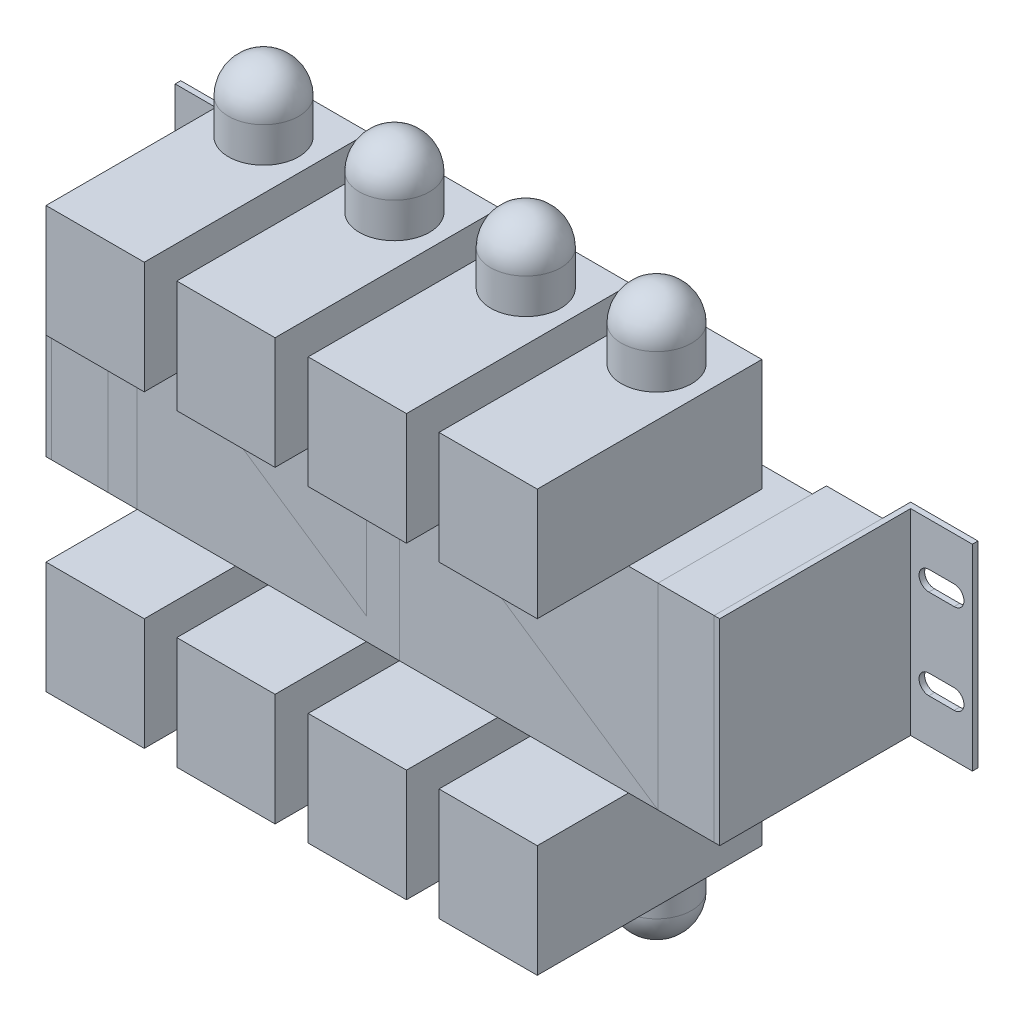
ISO-10303-21;
HEADER;
FILE_DESCRIPTION(('STEP AP214'),'2;1');
FILE_NAME('part.step','',(''),(''),'','','');
FILE_SCHEMA(('AUTOMOTIVE_DESIGN { 1 0 10303 214 1 1 1 1 }'));
ENDSEC;
DATA;
#1=APPLICATION_CONTEXT('core data for automotive mechanical design processes');
#2=APPLICATION_PROTOCOL_DEFINITION('international standard','automotive_design',2000,#1);
#3=PRODUCT_CONTEXT('',#1,'mechanical');
#4=PRODUCT('Part','Part','',(#3));
#5=PRODUCT_RELATED_PRODUCT_CATEGORY('part','',(#4));
#6=PRODUCT_DEFINITION_FORMATION('','',#4);
#7=PRODUCT_DEFINITION_CONTEXT('part definition',#1,'design');
#8=PRODUCT_DEFINITION('design','',#6,#7);
#9=PRODUCT_DEFINITION_SHAPE('','',#8);
#10=(LENGTH_UNIT() NAMED_UNIT(*) SI_UNIT(.MILLI.,.METRE.));
#11=(NAMED_UNIT(*) PLANE_ANGLE_UNIT() SI_UNIT($,.RADIAN.));
#12=(NAMED_UNIT(*) SI_UNIT($,.STERADIAN.) SOLID_ANGLE_UNIT());
#13=UNCERTAINTY_MEASURE_WITH_UNIT(LENGTH_MEASURE(1.E-05),#10,'distance_accuracy_value','');
#14=(GEOMETRIC_REPRESENTATION_CONTEXT(3) GLOBAL_UNCERTAINTY_ASSIGNED_CONTEXT((#13)) GLOBAL_UNIT_ASSIGNED_CONTEXT((#10,
#11,#12)) REPRESENTATION_CONTEXT('',''));
#15=CARTESIAN_POINT('',(0.,0.,0.));
#16=DIRECTION('',(0.,0.,1.));
#17=DIRECTION('',(1.,0.,0.));
#18=AXIS2_PLACEMENT_3D('',#15,#16,#17);
#19=CARTESIAN_POINT('',(-87.5,-75.,7.5));
#20=DIRECTION('',(0.,-1.,0.));
#21=DIRECTION('',(0.,0.,1.));
#22=AXIS2_PLACEMENT_3D('',#19,#20,#21);
#23=PLANE('',#22);
#24=DIRECTION('',(0.,0.,-1.));
#25=VECTOR('',#24,1.);
#26=CARTESIAN_POINT('',(-87.5,-75.,87.5));
#27=LINE('',#26,#25);
#28=CARTESIAN_POINT('',(-87.5,-75.,87.5));
#29=VERTEX_POINT('',#28);
#30=CARTESIAN_POINT('',(-87.5,-75.,7.5));
#31=VERTEX_POINT('',#30);
#32=EDGE_CURVE('E220',#29,#31,#27,.T.);
#33=ORIENTED_EDGE('',*,*,#32,.T.);
#34=DIRECTION('',(1.,0.,0.));
#35=VECTOR('',#34,1.);
#36=CARTESIAN_POINT('',(-87.5,-75.,7.5));
#37=LINE('',#36,#35);
#38=CARTESIAN_POINT('',(-52.5,-75.,7.5));
#39=VERTEX_POINT('',#38);
#40=EDGE_CURVE('E245',#31,#39,#37,.T.);
#41=ORIENTED_EDGE('',*,*,#40,.T.);
#42=DIRECTION('',(0.,0.,1.));
#43=VECTOR('',#42,1.);
#44=CARTESIAN_POINT('',(-52.5,-75.,87.5));
#45=LINE('',#44,#43);
#46=CARTESIAN_POINT('',(-52.5,-75.,87.5));
#47=VERTEX_POINT('',#46);
#48=EDGE_CURVE('E242',#39,#47,#45,.T.);
#49=ORIENTED_EDGE('',*,*,#48,.T.);
#50=DIRECTION('',(-1.,0.,0.));
#51=VECTOR('',#50,1.);
#52=CARTESIAN_POINT('',(-87.5,-75.,87.5));
#53=LINE('',#52,#51);
#54=EDGE_CURVE('E240',#47,#29,#53,.T.);
#55=ORIENTED_EDGE('',*,*,#54,.T.);
#56=EDGE_LOOP('',(#33,#41,#49,#55));
#57=FACE_BOUND('',#56,.T.);
#58=CARTESIAN_POINT('',(-70.,-75.,27.5));
#59=DIRECTION('',(0.,1.,0.));
#60=DIRECTION('',(0.,0.,-1.));
#61=AXIS2_PLACEMENT_3D('',#58,#59,#60);
#62=CIRCLE('',#61,12.5);
#63=CARTESIAN_POINT('',(-70.,-75.,15.));
#64=VERTEX_POINT('',#63);
#65=EDGE_CURVE('E229',#64,#64,#62,.T.);
#66=ORIENTED_EDGE('',*,*,#65,.T.);
#67=EDGE_LOOP('',(#66));
#68=FACE_BOUND('',#67,.T.);
#69=ADVANCED_FACE('F41',(#57,#68),#23,.T.);
#70=CARTESIAN_POINT('',(-5.90000000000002,-75.,7.5));
#71=DIRECTION('',(0.,-1.,0.));
#72=DIRECTION('',(0.,0.,1.));
#73=AXIS2_PLACEMENT_3D('',#70,#71,#72);
#74=PLANE('',#73);
#75=DIRECTION('',(0.,0.,-1.));
#76=VECTOR('',#75,1.);
#77=CARTESIAN_POINT('',(-5.9,-75.,87.5));
#78=LINE('',#77,#76);
#79=CARTESIAN_POINT('',(-5.9,-75.,87.5));
#80=VERTEX_POINT('',#79);
#81=CARTESIAN_POINT('',(-5.90000000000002,-75.,7.5));
#82=VERTEX_POINT('',#81);
#83=EDGE_CURVE('E267',#80,#82,#78,.T.);
#84=ORIENTED_EDGE('',*,*,#83,.F.);
#85=DIRECTION('',(1.,0.,0.));
#86=VECTOR('',#85,1.);
#87=CARTESIAN_POINT('',(-5.9,-75.,87.5));
#88=LINE('',#87,#86);
#89=CARTESIAN_POINT('',(-40.9,-75.,87.5));
#90=VERTEX_POINT('',#89);
#91=EDGE_CURVE('E275',#90,#80,#88,.T.);
#92=ORIENTED_EDGE('',*,*,#91,.F.);
#93=DIRECTION('',(0.,0.,1.));
#94=VECTOR('',#93,1.);
#95=CARTESIAN_POINT('',(-40.9,-75.,87.5));
#96=LINE('',#95,#94);
#97=CARTESIAN_POINT('',(-40.9,-75.,7.5));
#98=VERTEX_POINT('',#97);
#99=EDGE_CURVE('E272',#98,#90,#96,.T.);
#100=ORIENTED_EDGE('',*,*,#99,.F.);
#101=DIRECTION('',(-1.,0.,0.));
#102=VECTOR('',#101,1.);
#103=CARTESIAN_POINT('',(-5.90000000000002,-75.,7.5));
#104=LINE('',#103,#102);
#105=EDGE_CURVE('E269',#82,#98,#104,.T.);
#106=ORIENTED_EDGE('',*,*,#105,.F.);
#107=EDGE_LOOP('',(#84,#92,#100,#106));
#108=FACE_BOUND('',#107,.T.);
#109=CARTESIAN_POINT('',(-23.4,-75.,27.5));
#110=DIRECTION('',(0.,-1.,0.));
#111=DIRECTION('',(0.,0.,-1.));
#112=AXIS2_PLACEMENT_3D('',#109,#110,#111);
#113=CIRCLE('',#112,12.5);
#114=CARTESIAN_POINT('',(-23.4,-75.,15.));
#115=VERTEX_POINT('',#114);
#116=EDGE_CURVE('E255',#115,#115,#113,.T.);
#117=ORIENTED_EDGE('',*,*,#116,.F.);
#118=EDGE_LOOP('',(#117));
#119=FACE_BOUND('',#118,.T.);
#120=ADVANCED_FACE('F480',(#108,#119),#74,.T.);
#121=CARTESIAN_POINT('',(98.,-35.,55.));
#122=DIRECTION('',(0.,1.,0.));
#123=DIRECTION('',(0.,0.,1.));
#124=AXIS2_PLACEMENT_3D('',#121,#122,#123);
#125=PLANE('',#124);
#126=DIRECTION('',(-1.,0.,0.));
#127=VECTOR('',#126,1.);
#128=CARTESIAN_POINT('',(98.,-35.,55.));
#129=LINE('',#128,#127);
#130=CARTESIAN_POINT('',(-87.5,-35.,55.));
#131=VERTEX_POINT('',#130);
#132=CARTESIAN_POINT('',(-98.,-35.,55.));
#133=VERTEX_POINT('',#132);
#134=EDGE_CURVE('E378',#131,#133,#129,.T.);
#135=ORIENTED_EDGE('',*,*,#134,.T.);
#136=DIRECTION('',(0.,0.,-1.));
#137=VECTOR('',#136,1.);
#138=CARTESIAN_POINT('',(-98.,-35.,55.));
#139=LINE('',#138,#137);
#140=CARTESIAN_POINT('',(-98.,-35.,0.));
#141=VERTEX_POINT('',#140);
#142=EDGE_CURVE('E395',#133,#141,#139,.T.);
#143=ORIENTED_EDGE('',*,*,#142,.T.);
#144=DIRECTION('',(-1.,0.,0.));
#145=VECTOR('',#144,1.);
#146=CARTESIAN_POINT('',(98.,-35.,0.));
#147=LINE('',#146,#145);
#148=CARTESIAN_POINT('',(98.,-35.,0.));
#149=VERTEX_POINT('',#148);
#150=EDGE_CURVE('E368',#149,#141,#147,.T.);
#151=ORIENTED_EDGE('',*,*,#150,.F.);
#152=DIRECTION('',(0.,0.,-1.));
#153=VECTOR('',#152,1.);
#154=CARTESIAN_POINT('',(98.,-35.,55.));
#155=LINE('',#154,#153);
#156=CARTESIAN_POINT('',(98.,-35.,55.));
#157=VERTEX_POINT('',#156);
#158=EDGE_CURVE('E45',#157,#149,#155,.T.);
#159=ORIENTED_EDGE('',*,*,#158,.F.);
#160=CARTESIAN_POINT('',(-5.9,-35.,55.));
#161=VERTEX_POINT('',#160);
#162=EDGE_CURVE('E379',#157,#161,#129,.T.);
#163=ORIENTED_EDGE('',*,*,#162,.T.);
#164=DIRECTION('',(0.,0.,-1.));
#165=VECTOR('',#164,1.);
#166=CARTESIAN_POINT('',(-5.9,-35.,87.5));
#167=LINE('',#166,#165);
#168=CARTESIAN_POINT('',(-5.90000000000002,-35.,7.5));
#169=VERTEX_POINT('',#168);
#170=EDGE_CURVE('E12',#161,#169,#167,.T.);
#171=ORIENTED_EDGE('',*,*,#170,.T.);
#172=DIRECTION('',(-1.,0.,0.));
#173=VECTOR('',#172,1.);
#174=CARTESIAN_POINT('',(-5.90000000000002,-35.,7.5));
#175=LINE('',#174,#173);
#176=CARTESIAN_POINT('',(-40.9,-35.,7.5));
#177=VERTEX_POINT('',#176);
#178=EDGE_CURVE('E258',#169,#177,#175,.T.);
#179=ORIENTED_EDGE('',*,*,#178,.T.);
#180=DIRECTION('',(0.,0.,1.));
#181=VECTOR('',#180,1.);
#182=CARTESIAN_POINT('',(-40.9,-35.,87.5));
#183=LINE('',#182,#181);
#184=CARTESIAN_POINT('',(-40.9,-35.,55.));
#185=VERTEX_POINT('',#184);
#186=EDGE_CURVE('E262',#177,#185,#183,.T.);
#187=ORIENTED_EDGE('',*,*,#186,.T.);
#188=CARTESIAN_POINT('',(-52.5,-35.,55.));
#189=VERTEX_POINT('',#188);
#190=EDGE_CURVE('E818',#185,#189,#129,.T.);
#191=ORIENTED_EDGE('',*,*,#190,.T.);
#192=DIRECTION('',(0.,0.,1.));
#193=VECTOR('',#192,1.);
#194=CARTESIAN_POINT('',(-52.5,-35.,87.5));
#195=LINE('',#194,#193);
#196=CARTESIAN_POINT('',(-52.5,-35.,7.5));
#197=VERTEX_POINT('',#196);
#198=EDGE_CURVE('E233',#197,#189,#195,.T.);
#199=ORIENTED_EDGE('',*,*,#198,.F.);
#200=DIRECTION('',(1.,0.,0.));
#201=VECTOR('',#200,1.);
#202=CARTESIAN_POINT('',(-87.5,-35.,7.5));
#203=LINE('',#202,#201);
#204=CARTESIAN_POINT('',(-87.5,-35.,7.5));
#205=VERTEX_POINT('',#204);
#206=EDGE_CURVE('E236',#205,#197,#203,.T.);
#207=ORIENTED_EDGE('',*,*,#206,.F.);
#208=DIRECTION('',(0.,0.,-1.));
#209=VECTOR('',#208,1.);
#210=CARTESIAN_POINT('',(-87.5,-35.,87.5));
#211=LINE('',#210,#209);
#212=EDGE_CURVE('E227',#131,#205,#211,.T.);
#213=ORIENTED_EDGE('',*,*,#212,.F.);
#214=EDGE_LOOP('',(#135,#143,#151,#159,#163,#171,#179,#187,#191,#199,#207,#213));
#215=FACE_BOUND('',#214,.T.);
#216=ADVANCED_FACE('F486',(#215),#125,.F.);
#217=CARTESIAN_POINT('',(-5.90000000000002,75.,7.5));
#218=DIRECTION('',(0.,1.,0.));
#219=DIRECTION('',(0.,0.,1.));
#220=AXIS2_PLACEMENT_3D('',#217,#218,#219);
#221=PLANE('',#220);
#222=DIRECTION('',(0.,0.,-1.));
#223=VECTOR('',#222,1.);
#224=CARTESIAN_POINT('',(-5.9,75.,87.5));
#225=LINE('',#224,#223);
#226=CARTESIAN_POINT('',(-5.9,75.,87.5));
#227=VERTEX_POINT('',#226);
#228=CARTESIAN_POINT('',(-5.90000000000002,75.,7.5));
#229=VERTEX_POINT('',#228);
#230=EDGE_CURVE('E305',#227,#229,#225,.T.);
#231=ORIENTED_EDGE('',*,*,#230,.T.);
#232=DIRECTION('',(-1.,0.,0.));
#233=VECTOR('',#232,1.);
#234=CARTESIAN_POINT('',(-5.90000000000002,75.,7.5));
#235=LINE('',#234,#233);
#236=CARTESIAN_POINT('',(-40.9,75.,7.5));
#237=VERTEX_POINT('',#236);
#238=EDGE_CURVE('E314',#229,#237,#235,.T.);
#239=ORIENTED_EDGE('',*,*,#238,.T.);
#240=DIRECTION('',(0.,0.,1.));
#241=VECTOR('',#240,1.);
#242=CARTESIAN_POINT('',(-40.9,75.,87.5));
#243=LINE('',#242,#241);
#244=CARTESIAN_POINT('',(-40.9,75.,87.5));
#245=VERTEX_POINT('',#244);
#246=EDGE_CURVE('E311',#237,#245,#243,.T.);
#247=ORIENTED_EDGE('',*,*,#246,.T.);
#248=DIRECTION('',(1.,0.,0.));
#249=VECTOR('',#248,1.);
#250=CARTESIAN_POINT('',(-5.9,75.,87.5));
#251=LINE('',#250,#249);
#252=EDGE_CURVE('E308',#245,#227,#251,.T.);
#253=ORIENTED_EDGE('',*,*,#252,.T.);
#254=EDGE_LOOP('',(#231,#239,#247,#253));
#255=FACE_BOUND('',#254,.T.);
#256=CARTESIAN_POINT('',(-23.4,75.,27.5));
#257=DIRECTION('',(0.,-1.,0.));
#258=DIRECTION('',(0.,0.,-1.));
#259=AXIS2_PLACEMENT_3D('',#256,#257,#258);
#260=CIRCLE('',#259,12.5);
#261=CARTESIAN_POINT('',(-23.4,75.,15.));
#262=VERTEX_POINT('',#261);
#263=EDGE_CURVE('E290',#262,#262,#260,.T.);
#264=ORIENTED_EDGE('',*,*,#263,.T.);
#265=EDGE_LOOP('',(#264));
#266=FACE_BOUND('',#265,.T.);
#267=ADVANCED_FACE('F459',(#255,#266),#221,.T.);
#268=CARTESIAN_POINT('',(-87.5,75.,7.5));
#269=DIRECTION('',(0.,1.,0.));
#270=DIRECTION('',(0.,0.,1.));
#271=AXIS2_PLACEMENT_3D('',#268,#269,#270);
#272=PLANE('',#271);
#273=DIRECTION('',(0.,0.,-1.));
#274=VECTOR('',#273,1.);
#275=CARTESIAN_POINT('',(-87.5,75.,87.5));
#276=LINE('',#275,#274);
#277=CARTESIAN_POINT('',(-87.5,75.,87.5));
#278=VERTEX_POINT('',#277);
#279=CARTESIAN_POINT('',(-87.5,75.,7.5));
#280=VERTEX_POINT('',#279);
#281=EDGE_CURVE('E344',#278,#280,#276,.T.);
#282=ORIENTED_EDGE('',*,*,#281,.F.);
#283=DIRECTION('',(-1.,0.,0.));
#284=VECTOR('',#283,1.);
#285=CARTESIAN_POINT('',(-87.5,75.,87.5));
#286=LINE('',#285,#284);
#287=CARTESIAN_POINT('',(-52.5,75.,87.5));
#288=VERTEX_POINT('',#287);
#289=EDGE_CURVE('E353',#288,#278,#286,.T.);
#290=ORIENTED_EDGE('',*,*,#289,.F.);
#291=DIRECTION('',(0.,0.,1.));
#292=VECTOR('',#291,1.);
#293=CARTESIAN_POINT('',(-52.5,75.,87.5));
#294=LINE('',#293,#292);
#295=CARTESIAN_POINT('',(-52.5,75.,7.5));
#296=VERTEX_POINT('',#295);
#297=EDGE_CURVE('E350',#296,#288,#294,.T.);
#298=ORIENTED_EDGE('',*,*,#297,.F.);
#299=DIRECTION('',(1.,0.,0.));
#300=VECTOR('',#299,1.);
#301=CARTESIAN_POINT('',(-87.5,75.,7.5));
#302=LINE('',#301,#300);
#303=EDGE_CURVE('E347',#280,#296,#302,.T.);
#304=ORIENTED_EDGE('',*,*,#303,.F.);
#305=EDGE_LOOP('',(#282,#290,#298,#304));
#306=FACE_BOUND('',#305,.T.);
#307=CARTESIAN_POINT('',(-70.,75.,27.5));
#308=DIRECTION('',(0.,1.,0.));
#309=DIRECTION('',(0.,0.,-1.));
#310=AXIS2_PLACEMENT_3D('',#307,#308,#309);
#311=CIRCLE('',#310,12.5);
#312=CARTESIAN_POINT('',(-70.,75.,15.));
#313=VERTEX_POINT('',#312);
#314=EDGE_CURVE('E330',#313,#313,#311,.T.);
#315=ORIENTED_EDGE('',*,*,#314,.F.);
#316=EDGE_LOOP('',(#315));
#317=FACE_BOUND('',#316,.T.);
#318=ADVANCED_FACE('F456',(#306,#317),#272,.T.);
#319=CARTESIAN_POINT('',(98.,35.,55.));
#320=DIRECTION('',(0.,-1.,0.));
#321=DIRECTION('',(0.,0.,-1.));
#322=AXIS2_PLACEMENT_3D('',#319,#320,#321);
#323=PLANE('',#322);
#324=DIRECTION('',(1.,0.,0.));
#325=VECTOR('',#324,1.);
#326=CARTESIAN_POINT('',(98.,35.,55.));
#327=LINE('',#326,#325);
#328=CARTESIAN_POINT('',(-5.9,35.,55.));
#329=VERTEX_POINT('',#328);
#330=CARTESIAN_POINT('',(98.,35.,55.));
#331=VERTEX_POINT('',#330);
#332=EDGE_CURVE('E385',#329,#331,#327,.T.);
#333=ORIENTED_EDGE('',*,*,#332,.T.);
#334=DIRECTION('',(0.,0.,-1.));
#335=VECTOR('',#334,1.);
#336=CARTESIAN_POINT('',(98.,35.,55.));
#337=LINE('',#336,#335);
#338=CARTESIAN_POINT('',(98.,35.,0.));
#339=VERTEX_POINT('',#338);
#340=EDGE_CURVE('E389',#331,#339,#337,.T.);
#341=ORIENTED_EDGE('',*,*,#340,.T.);
#342=DIRECTION('',(1.,0.,0.));
#343=VECTOR('',#342,1.);
#344=CARTESIAN_POINT('',(98.,35.,0.));
#345=LINE('',#344,#343);
#346=CARTESIAN_POINT('',(-98.,35.,0.));
#347=VERTEX_POINT('',#346);
#348=EDGE_CURVE('E373',#347,#339,#345,.T.);
#349=ORIENTED_EDGE('',*,*,#348,.F.);
#350=DIRECTION('',(0.,0.,-1.));
#351=VECTOR('',#350,1.);
#352=CARTESIAN_POINT('',(-98.,35.,55.));
#353=LINE('',#352,#351);
#354=CARTESIAN_POINT('',(-98.,35.,55.));
#355=VERTEX_POINT('',#354);
#356=EDGE_CURVE('E393',#355,#347,#353,.T.);
#357=ORIENTED_EDGE('',*,*,#356,.F.);
#358=CARTESIAN_POINT('',(-87.5,35.,55.));
#359=VERTEX_POINT('',#358);
#360=EDGE_CURVE('E386',#355,#359,#327,.T.);
#361=ORIENTED_EDGE('',*,*,#360,.T.);
#362=DIRECTION('',(0.,0.,-1.));
#363=VECTOR('',#362,1.);
#364=CARTESIAN_POINT('',(-87.5,35.,87.5));
#365=LINE('',#364,#363);
#366=CARTESIAN_POINT('',(-87.5,35.,7.5));
#367=VERTEX_POINT('',#366);
#368=EDGE_CURVE('E50',#359,#367,#365,.T.);
#369=ORIENTED_EDGE('',*,*,#368,.T.);
#370=DIRECTION('',(1.,0.,0.));
#371=VECTOR('',#370,1.);
#372=CARTESIAN_POINT('',(-87.5,35.,7.5));
#373=LINE('',#372,#371);
#374=CARTESIAN_POINT('',(-52.5,35.,7.5));
#375=VERTEX_POINT('',#374);
#376=EDGE_CURVE('E335',#367,#375,#373,.T.);
#377=ORIENTED_EDGE('',*,*,#376,.T.);
#378=DIRECTION('',(0.,0.,1.));
#379=VECTOR('',#378,1.);
#380=CARTESIAN_POINT('',(-52.5,35.,87.5));
#381=LINE('',#380,#379);
#382=CARTESIAN_POINT('',(-52.5,35.,55.));
#383=VERTEX_POINT('',#382);
#384=EDGE_CURVE('E339',#375,#383,#381,.T.);
#385=ORIENTED_EDGE('',*,*,#384,.T.);
#386=CARTESIAN_POINT('',(-40.9,35.,55.));
#387=VERTEX_POINT('',#386);
#388=EDGE_CURVE('E428',#383,#387,#327,.T.);
#389=ORIENTED_EDGE('',*,*,#388,.T.);
#390=DIRECTION('',(0.,0.,1.));
#391=VECTOR('',#390,1.);
#392=CARTESIAN_POINT('',(-40.9,35.,87.5));
#393=LINE('',#392,#391);
#394=CARTESIAN_POINT('',(-40.9,35.,7.5));
#395=VERTEX_POINT('',#394);
#396=EDGE_CURVE('E299',#395,#387,#393,.T.);
#397=ORIENTED_EDGE('',*,*,#396,.F.);
#398=DIRECTION('',(-1.,0.,0.));
#399=VECTOR('',#398,1.);
#400=CARTESIAN_POINT('',(-5.90000000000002,35.,7.5));
#401=LINE('',#400,#399);
#402=CARTESIAN_POINT('',(-5.90000000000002,35.,7.5));
#403=VERTEX_POINT('',#402);
#404=EDGE_CURVE('E302',#403,#395,#401,.T.);
#405=ORIENTED_EDGE('',*,*,#404,.F.);
#406=DIRECTION('',(0.,0.,-1.));
#407=VECTOR('',#406,1.);
#408=CARTESIAN_POINT('',(-5.9,35.,87.5));
#409=LINE('',#408,#407);
#410=EDGE_CURVE('E293',#329,#403,#409,.T.);
#411=ORIENTED_EDGE('',*,*,#410,.F.);
#412=EDGE_LOOP('',(#333,#341,#349,#357,#361,#369,#377,#385,#389,#397,#405,#411));
#413=FACE_BOUND('',#412,.T.);
#414=ADVANCED_FACE('F408',(#413),#323,.F.);
#415=CARTESIAN_POINT('',(98.,35.,55.));
#416=DIRECTION('',(-1.,0.,0.));
#417=DIRECTION('',(0.,1.,0.));
#418=AXIS2_PLACEMENT_3D('',#415,#416,#417);
#419=PLANE('',#418);
#420=DIRECTION('',(0.,-1.,0.));
#421=VECTOR('',#420,1.);
#422=CARTESIAN_POINT('',(98.,35.,0.));
#423=LINE('',#422,#421);
#424=EDGE_CURVE('E366',#339,#149,#423,.T.);
#425=ORIENTED_EDGE('',*,*,#424,.F.);
#426=ORIENTED_EDGE('',*,*,#340,.F.);
#427=DIRECTION('',(0.,-1.,0.));
#428=VECTOR('',#427,1.);
#429=CARTESIAN_POINT('',(98.,35.,55.));
#430=LINE('',#429,#428);
#431=EDGE_CURVE('E376',#331,#157,#430,.T.);
#432=ORIENTED_EDGE('',*,*,#431,.T.);
#433=ORIENTED_EDGE('',*,*,#158,.T.);
#434=EDGE_LOOP('',(#425,#426,#432,#433));
#435=FACE_BOUND('',#434,.T.);
#436=ADVANCED_FACE('F43',(#435),#419,.F.);
#437=CARTESIAN_POINT('',(-98.,35.,55.));
#438=DIRECTION('',(1.,0.,0.));
#439=DIRECTION('',(0.,0.,1.));
#440=AXIS2_PLACEMENT_3D('',#437,#438,#439);
#441=PLANE('',#440);
#442=DIRECTION('',(0.,1.,0.));
#443=VECTOR('',#442,1.);
#444=CARTESIAN_POINT('',(-98.,35.,0.));
#445=LINE('',#444,#443);
#446=EDGE_CURVE('E371',#141,#347,#445,.T.);
#447=ORIENTED_EDGE('',*,*,#446,.F.);
#448=ORIENTED_EDGE('',*,*,#142,.F.);
#449=DIRECTION('',(0.,1.,0.));
#450=VECTOR('',#449,1.);
#451=CARTESIAN_POINT('',(-98.,35.,55.));
#452=LINE('',#451,#450);
#453=EDGE_CURVE('E382',#133,#355,#452,.T.);
#454=ORIENTED_EDGE('',*,*,#453,.T.);
#455=ORIENTED_EDGE('',*,*,#356,.T.);
#456=EDGE_LOOP('',(#447,#448,#454,#455));
#457=FACE_BOUND('',#456,.T.);
#458=ADVANCED_FACE('F448',(#457),#441,.F.);
#459=CARTESIAN_POINT('',(98.,-35.,55.));
#460=DIRECTION('',(0.,0.,1.));
#461=DIRECTION('',(-1.,0.,0.));
#462=AXIS2_PLACEMENT_3D('',#459,#460,#461);
#463=PLANE('',#462);
#464=ORIENTED_EDGE('',*,*,#431,.F.);
#465=ORIENTED_EDGE('',*,*,#332,.F.);
#466=EDGE_CURVE('E433',#387,#329,#327,.T.);
#467=ORIENTED_EDGE('',*,*,#466,.F.);
#468=ORIENTED_EDGE('',*,*,#388,.F.);
#469=EDGE_CURVE('E390',#359,#383,#327,.T.);
#470=ORIENTED_EDGE('',*,*,#469,.F.);
#471=ORIENTED_EDGE('',*,*,#360,.F.);
#472=ORIENTED_EDGE('',*,*,#453,.F.);
#473=ORIENTED_EDGE('',*,*,#134,.F.);
#474=EDGE_CURVE('E225',#189,#131,#129,.T.);
#475=ORIENTED_EDGE('',*,*,#474,.F.);
#476=ORIENTED_EDGE('',*,*,#190,.F.);
#477=EDGE_CURVE('E383',#161,#185,#129,.T.);
#478=ORIENTED_EDGE('',*,*,#477,.F.);
#479=ORIENTED_EDGE('',*,*,#162,.F.);
#480=EDGE_LOOP('',(#464,#465,#467,#468,#470,#471,#472,#473,#475,#476,#478,#479));
#481=FACE_BOUND('',#480,.T.);
#482=ADVANCED_FACE('F442',(#481),#463,.T.);
#483=CARTESIAN_POINT('',(98.,-35.,0.));
#484=DIRECTION('',(0.,0.,1.));
#485=DIRECTION('',(-1.,0.,0.));
#486=AXIS2_PLACEMENT_3D('',#483,#484,#485);
#487=PLANE('',#486);
#488=ORIENTED_EDGE('',*,*,#424,.T.);
#489=ORIENTED_EDGE('',*,*,#150,.T.);
#490=ORIENTED_EDGE('',*,*,#446,.T.);
#491=ORIENTED_EDGE('',*,*,#348,.T.);
#492=EDGE_LOOP('',(#488,#489,#490,#491));
#493=FACE_BOUND('',#492,.T.);
#494=ADVANCED_FACE('F446',(#493),#487,.F.);
#495=CARTESIAN_POINT('',(-87.5,75.,87.5));
#496=DIRECTION('',(1.,0.,0.));
#497=DIRECTION('',(0.,0.,1.));
#498=AXIS2_PLACEMENT_3D('',#495,#496,#497);
#499=PLANE('',#498);
#500=CARTESIAN_POINT('',(-87.5,35.,87.5));
#501=VERTEX_POINT('',#500);
#502=EDGE_CURVE('E333',#501,#359,#365,.T.);
#503=ORIENTED_EDGE('',*,*,#502,.F.);
#504=DIRECTION('',(0.,-1.,0.));
#505=VECTOR('',#504,1.);
#506=CARTESIAN_POINT('',(-87.5,75.,87.5));
#507=LINE('',#506,#505);
#508=EDGE_CURVE('E356',#278,#501,#507,.T.);
#509=ORIENTED_EDGE('',*,*,#508,.F.);
#510=ORIENTED_EDGE('',*,*,#281,.T.);
#511=DIRECTION('',(0.,-1.,0.));
#512=VECTOR('',#511,1.);
#513=CARTESIAN_POINT('',(-87.5,75.,7.5));
#514=LINE('',#513,#512);
#515=EDGE_CURVE('E364',#280,#367,#514,.T.);
#516=ORIENTED_EDGE('',*,*,#515,.T.);
#517=ORIENTED_EDGE('',*,*,#368,.F.);
#518=EDGE_LOOP('',(#503,#509,#510,#516,#517));
#519=FACE_BOUND('',#518,.T.);
#520=ADVANCED_FACE('F414',(#519),#499,.F.);
#521=CARTESIAN_POINT('',(-87.5,75.,7.5));
#522=DIRECTION('',(0.,0.,1.));
#523=DIRECTION('',(-1.,0.,0.));
#524=AXIS2_PLACEMENT_3D('',#521,#522,#523);
#525=PLANE('',#524);
#526=ORIENTED_EDGE('',*,*,#376,.F.);
#527=ORIENTED_EDGE('',*,*,#515,.F.);
#528=ORIENTED_EDGE('',*,*,#303,.T.);
#529=DIRECTION('',(0.,-1.,0.));
#530=VECTOR('',#529,1.);
#531=CARTESIAN_POINT('',(-52.5,75.,7.5));
#532=LINE('',#531,#530);
#533=EDGE_CURVE('E362',#296,#375,#532,.T.);
#534=ORIENTED_EDGE('',*,*,#533,.T.);
#535=EDGE_LOOP('',(#526,#527,#528,#534));
#536=FACE_BOUND('',#535,.T.);
#537=ADVANCED_FACE('F418',(#536),#525,.F.);
#538=CARTESIAN_POINT('',(-52.5,75.,87.5));
#539=DIRECTION('',(-1.,0.,0.));
#540=DIRECTION('',(0.,0.,-1.));
#541=AXIS2_PLACEMENT_3D('',#538,#539,#540);
#542=PLANE('',#541);
#543=ORIENTED_EDGE('',*,*,#384,.F.);
#544=ORIENTED_EDGE('',*,*,#533,.F.);
#545=ORIENTED_EDGE('',*,*,#297,.T.);
#546=DIRECTION('',(0.,-1.,0.));
#547=VECTOR('',#546,1.);
#548=CARTESIAN_POINT('',(-52.5,75.,87.5));
#549=LINE('',#548,#547);
#550=CARTESIAN_POINT('',(-52.5,35.,87.5));
#551=VERTEX_POINT('',#550);
#552=EDGE_CURVE('E359',#288,#551,#549,.T.);
#553=ORIENTED_EDGE('',*,*,#552,.T.);
#554=EDGE_CURVE('E338',#383,#551,#381,.T.);
#555=ORIENTED_EDGE('',*,*,#554,.F.);
#556=EDGE_LOOP('',(#543,#544,#545,#553,#555));
#557=FACE_BOUND('',#556,.T.);
#558=ADVANCED_FACE('F422',(#557),#542,.F.);
#559=CARTESIAN_POINT('',(-87.5,75.,87.5));
#560=DIRECTION('',(0.,0.,-1.));
#561=DIRECTION('',(1.,0.,0.));
#562=AXIS2_PLACEMENT_3D('',#559,#560,#561);
#563=PLANE('',#562);
#564=DIRECTION('',(-1.,0.,0.));
#565=VECTOR('',#564,1.);
#566=CARTESIAN_POINT('',(-87.5,35.,87.5));
#567=LINE('',#566,#565);
#568=EDGE_CURVE('E342',#551,#501,#567,.T.);
#569=ORIENTED_EDGE('',*,*,#568,.F.);
#570=ORIENTED_EDGE('',*,*,#552,.F.);
#571=ORIENTED_EDGE('',*,*,#289,.T.);
#572=ORIENTED_EDGE('',*,*,#508,.T.);
#573=EDGE_LOOP('',(#569,#570,#571,#572));
#574=FACE_BOUND('',#573,.T.);
#575=ADVANCED_FACE('F453',(#574),#563,.F.);
#576=CARTESIAN_POINT('',(-87.5,35.,7.5));
#577=DIRECTION('',(0.,1.,0.));
#578=DIRECTION('',(0.,0.,1.));
#579=AXIS2_PLACEMENT_3D('',#576,#577,#578);
#580=PLANE('',#579);
#581=ORIENTED_EDGE('',*,*,#469,.T.);
#582=ORIENTED_EDGE('',*,*,#554,.T.);
#583=ORIENTED_EDGE('',*,*,#568,.T.);
#584=ORIENTED_EDGE('',*,*,#502,.T.);
#585=EDGE_LOOP('',(#581,#582,#583,#584));
#586=FACE_BOUND('',#585,.T.);
#587=ADVANCED_FACE('F451',(#586),#580,.F.);
#588=CARTESIAN_POINT('',(-70.,33.,27.5));
#589=DIRECTION('',(0.,-1.,0.));
#590=DIRECTION('',(0.,0.,-1.));
#591=AXIS2_PLACEMENT_3D('',#588,#589,#590);
#592=CYLINDRICAL_SURFACE('',#591,12.5);
#593=ORIENTED_EDGE('',*,*,#314,.T.);
#594=EDGE_LOOP('',(#593));
#595=FACE_BOUND('',#594,.T.);
#596=CARTESIAN_POINT('',(-70.,87.5,27.5));
#597=DIRECTION('',(0.,1.,0.));
#598=DIRECTION('',(0.,0.,-1.));
#599=AXIS2_PLACEMENT_3D('',#596,#597,#598);
#600=CIRCLE('',#599,12.5);
#601=CARTESIAN_POINT('',(-70.,87.5,15.));
#602=VERTEX_POINT('',#601);
#603=EDGE_CURVE('E327',#602,#602,#600,.T.);
#604=ORIENTED_EDGE('',*,*,#603,.F.);
#605=EDGE_LOOP('',(#604));
#606=FACE_BOUND('',#605,.T.);
#607=ADVANCED_FACE('F463',(#595,#606),#592,.T.);
#608=CARTESIAN_POINT('',(-70.,87.5,27.5));
#609=DIRECTION('',(0.,-1.,0.));
#610=DIRECTION('',(0.,0.,1.));
#611=AXIS2_PLACEMENT_3D('',#608,#609,#610);
#612=SPHERICAL_SURFACE('',#611,12.5);
#613=ORIENTED_EDGE('',*,*,#603,.T.);
#614=EDGE_LOOP('',(#613));
#615=FACE_BOUND('',#614,.T.);
#616=ADVANCED_FACE('F466',(#615),#612,.T.);
#617=CARTESIAN_POINT('',(-5.9,75.,87.5));
#618=DIRECTION('',(1.,0.,0.));
#619=DIRECTION('',(0.,0.,1.));
#620=AXIS2_PLACEMENT_3D('',#617,#618,#619);
#621=PLANE('',#620);
#622=CARTESIAN_POINT('',(-5.9,35.,87.5));
#623=VERTEX_POINT('',#622);
#624=EDGE_CURVE('E294',#623,#329,#409,.T.);
#625=ORIENTED_EDGE('',*,*,#624,.T.);
#626=ORIENTED_EDGE('',*,*,#410,.T.);
#627=DIRECTION('',(0.,-1.,0.));
#628=VECTOR('',#627,1.);
#629=CARTESIAN_POINT('',(-5.90000000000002,75.,7.5));
#630=LINE('',#629,#628);
#631=EDGE_CURVE('E317',#229,#403,#630,.T.);
#632=ORIENTED_EDGE('',*,*,#631,.F.);
#633=ORIENTED_EDGE('',*,*,#230,.F.);
#634=DIRECTION('',(0.,-1.,0.));
#635=VECTOR('',#634,1.);
#636=CARTESIAN_POINT('',(-5.9,75.,87.5));
#637=LINE('',#636,#635);
#638=EDGE_CURVE('E324',#227,#623,#637,.T.);
#639=ORIENTED_EDGE('',*,*,#638,.T.);
#640=EDGE_LOOP('',(#625,#626,#632,#633,#639));
#641=FACE_BOUND('',#640,.T.);
#642=ADVANCED_FACE('F471',(#641),#621,.T.);
#643=CARTESIAN_POINT('',(-5.9,75.,87.5));
#644=DIRECTION('',(0.,0.,1.));
#645=DIRECTION('',(-1.,0.,0.));
#646=AXIS2_PLACEMENT_3D('',#643,#644,#645);
#647=PLANE('',#646);
#648=DIRECTION('',(1.,0.,0.));
#649=VECTOR('',#648,1.);
#650=CARTESIAN_POINT('',(-5.9,35.,87.5));
#651=LINE('',#650,#649);
#652=CARTESIAN_POINT('',(-40.9,35.,87.5));
#653=VERTEX_POINT('',#652);
#654=EDGE_CURVE('E296',#653,#623,#651,.T.);
#655=ORIENTED_EDGE('',*,*,#654,.T.);
#656=ORIENTED_EDGE('',*,*,#638,.F.);
#657=ORIENTED_EDGE('',*,*,#252,.F.);
#658=DIRECTION('',(0.,-1.,0.));
#659=VECTOR('',#658,1.);
#660=CARTESIAN_POINT('',(-40.9,75.,87.5));
#661=LINE('',#660,#659);
#662=EDGE_CURVE('E321',#245,#653,#661,.T.);
#663=ORIENTED_EDGE('',*,*,#662,.T.);
#664=EDGE_LOOP('',(#655,#656,#657,#663));
#665=FACE_BOUND('',#664,.T.);
#666=ADVANCED_FACE('F476',(#665),#647,.T.);
#667=CARTESIAN_POINT('',(-40.9,75.,87.5));
#668=DIRECTION('',(-1.,0.,0.));
#669=DIRECTION('',(0.,0.,-1.));
#670=AXIS2_PLACEMENT_3D('',#667,#668,#669);
#671=PLANE('',#670);
#672=ORIENTED_EDGE('',*,*,#396,.T.);
#673=EDGE_CURVE('E298',#387,#653,#393,.T.);
#674=ORIENTED_EDGE('',*,*,#673,.T.);
#675=ORIENTED_EDGE('',*,*,#662,.F.);
#676=ORIENTED_EDGE('',*,*,#246,.F.);
#677=DIRECTION('',(0.,-1.,0.));
#678=VECTOR('',#677,1.);
#679=CARTESIAN_POINT('',(-40.9,75.,7.5));
#680=LINE('',#679,#678);
#681=EDGE_CURVE('E319',#237,#395,#680,.T.);
#682=ORIENTED_EDGE('',*,*,#681,.T.);
#683=EDGE_LOOP('',(#672,#674,#675,#676,#682));
#684=FACE_BOUND('',#683,.T.);
#685=ADVANCED_FACE('F549',(#684),#671,.T.);
#686=CARTESIAN_POINT('',(-5.90000000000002,75.,7.5));
#687=DIRECTION('',(0.,0.,-1.));
#688=DIRECTION('',(1.,0.,0.));
#689=AXIS2_PLACEMENT_3D('',#686,#687,#688);
#690=PLANE('',#689);
#691=ORIENTED_EDGE('',*,*,#404,.T.);
#692=ORIENTED_EDGE('',*,*,#681,.F.);
#693=ORIENTED_EDGE('',*,*,#238,.F.);
#694=ORIENTED_EDGE('',*,*,#631,.T.);
#695=EDGE_LOOP('',(#691,#692,#693,#694));
#696=FACE_BOUND('',#695,.T.);
#697=ADVANCED_FACE('F543',(#696),#690,.T.);
#698=CARTESIAN_POINT('',(-5.90000000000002,35.,7.5));
#699=DIRECTION('',(0.,1.,0.));
#700=DIRECTION('',(0.,0.,1.));
#701=AXIS2_PLACEMENT_3D('',#698,#699,#700);
#702=PLANE('',#701);
#703=ORIENTED_EDGE('',*,*,#466,.T.);
#704=ORIENTED_EDGE('',*,*,#624,.F.);
#705=ORIENTED_EDGE('',*,*,#654,.F.);
#706=ORIENTED_EDGE('',*,*,#673,.F.);
#707=EDGE_LOOP('',(#703,#704,#705,#706));
#708=FACE_BOUND('',#707,.T.);
#709=ADVANCED_FACE('F539',(#708),#702,.F.);
#710=CARTESIAN_POINT('',(-23.4,33.,27.5));
#711=DIRECTION('',(0.,-1.,0.));
#712=DIRECTION('',(0.,0.,-1.));
#713=AXIS2_PLACEMENT_3D('',#710,#711,#712);
#714=CYLINDRICAL_SURFACE('',#713,12.5);
#715=ORIENTED_EDGE('',*,*,#263,.F.);
#716=EDGE_LOOP('',(#715));
#717=FACE_BOUND('',#716,.T.);
#718=CARTESIAN_POINT('',(-23.4,87.5,27.5));
#719=DIRECTION('',(0.,-1.,0.));
#720=DIRECTION('',(0.,0.,-1.));
#721=AXIS2_PLACEMENT_3D('',#718,#719,#720);
#722=CIRCLE('',#721,12.5);
#723=CARTESIAN_POINT('',(-23.4,87.5,15.));
#724=VERTEX_POINT('',#723);
#725=EDGE_CURVE('E287',#724,#724,#722,.T.);
#726=ORIENTED_EDGE('',*,*,#725,.T.);
#727=EDGE_LOOP('',(#726));
#728=FACE_BOUND('',#727,.T.);
#729=ADVANCED_FACE('F535',(#717,#728),#714,.T.);
#730=CARTESIAN_POINT('',(-23.4,87.5,27.5));
#731=DIRECTION('',(0.,-1.,0.));
#732=DIRECTION('',(0.,0.,1.));
#733=AXIS2_PLACEMENT_3D('',#730,#731,#732);
#734=SPHERICAL_SURFACE('',#733,12.5);
#735=ORIENTED_EDGE('',*,*,#725,.F.);
#736=EDGE_LOOP('',(#735));
#737=FACE_BOUND('',#736,.T.);
#738=ADVANCED_FACE('F532',(#737),#734,.T.);
#739=CARTESIAN_POINT('',(-5.9,-75.,87.5));
#740=DIRECTION('',(-1.,0.,0.));
#741=DIRECTION('',(0.,0.,-1.));
#742=AXIS2_PLACEMENT_3D('',#739,#740,#741);
#743=PLANE('',#742);
#744=CARTESIAN_POINT('',(-5.9,-35.,87.5));
#745=VERTEX_POINT('',#744);
#746=EDGE_CURVE('E52',#745,#161,#167,.T.);
#747=ORIENTED_EDGE('',*,*,#746,.F.);
#748=DIRECTION('',(0.,1.,0.));
#749=VECTOR('',#748,1.);
#750=CARTESIAN_POINT('',(-5.9,-75.,87.5));
#751=LINE('',#750,#749);
#752=EDGE_CURVE('E278',#80,#745,#751,.T.);
#753=ORIENTED_EDGE('',*,*,#752,.F.);
#754=ORIENTED_EDGE('',*,*,#83,.T.);
#755=DIRECTION('',(0.,1.,0.));
#756=VECTOR('',#755,1.);
#757=CARTESIAN_POINT('',(-5.90000000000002,-75.,7.5));
#758=LINE('',#757,#756);
#759=EDGE_CURVE('E67',#82,#169,#758,.T.);
#760=ORIENTED_EDGE('',*,*,#759,.T.);
#761=ORIENTED_EDGE('',*,*,#170,.F.);
#762=EDGE_LOOP('',(#747,#753,#754,#760,#761));
#763=FACE_BOUND('',#762,.T.);
#764=ADVANCED_FACE('F528',(#763),#743,.F.);
#765=CARTESIAN_POINT('',(-5.90000000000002,-75.,7.5));
#766=DIRECTION('',(0.,0.,1.));
#767=DIRECTION('',(-1.,0.,0.));
#768=AXIS2_PLACEMENT_3D('',#765,#766,#767);
#769=PLANE('',#768);
#770=ORIENTED_EDGE('',*,*,#178,.F.);
#771=ORIENTED_EDGE('',*,*,#759,.F.);
#772=ORIENTED_EDGE('',*,*,#105,.T.);
#773=DIRECTION('',(0.,1.,0.));
#774=VECTOR('',#773,1.);
#775=CARTESIAN_POINT('',(-40.9,-75.,7.5));
#776=LINE('',#775,#774);
#777=EDGE_CURVE('E284',#98,#177,#776,.T.);
#778=ORIENTED_EDGE('',*,*,#777,.T.);
#779=EDGE_LOOP('',(#770,#771,#772,#778));
#780=FACE_BOUND('',#779,.T.);
#781=ADVANCED_FACE('F524',(#780),#769,.F.);
#782=CARTESIAN_POINT('',(-40.9,-75.,87.5));
#783=DIRECTION('',(1.,0.,0.));
#784=DIRECTION('',(0.,0.,1.));
#785=AXIS2_PLACEMENT_3D('',#782,#783,#784);
#786=PLANE('',#785);
#787=ORIENTED_EDGE('',*,*,#186,.F.);
#788=ORIENTED_EDGE('',*,*,#777,.F.);
#789=ORIENTED_EDGE('',*,*,#99,.T.);
#790=DIRECTION('',(0.,1.,0.));
#791=VECTOR('',#790,1.);
#792=CARTESIAN_POINT('',(-40.9,-75.,87.5));
#793=LINE('',#792,#791);
#794=CARTESIAN_POINT('',(-40.9,-35.,87.5));
#795=VERTEX_POINT('',#794);
#796=EDGE_CURVE('E281',#90,#795,#793,.T.);
#797=ORIENTED_EDGE('',*,*,#796,.T.);
#798=EDGE_CURVE('E261',#185,#795,#183,.T.);
#799=ORIENTED_EDGE('',*,*,#798,.F.);
#800=EDGE_LOOP('',(#787,#788,#789,#797,#799));
#801=FACE_BOUND('',#800,.T.);
#802=ADVANCED_FACE('F520',(#801),#786,.F.);
#803=CARTESIAN_POINT('',(-5.9,-75.,87.5));
#804=DIRECTION('',(0.,0.,-1.));
#805=DIRECTION('',(1.,0.,0.));
#806=AXIS2_PLACEMENT_3D('',#803,#804,#805);
#807=PLANE('',#806);
#808=DIRECTION('',(1.,0.,0.));
#809=VECTOR('',#808,1.);
#810=CARTESIAN_POINT('',(-5.9,-35.,87.5));
#811=LINE('',#810,#809);
#812=EDGE_CURVE('E265',#795,#745,#811,.T.);
#813=ORIENTED_EDGE('',*,*,#812,.F.);
#814=ORIENTED_EDGE('',*,*,#796,.F.);
#815=ORIENTED_EDGE('',*,*,#91,.T.);
#816=ORIENTED_EDGE('',*,*,#752,.T.);
#817=EDGE_LOOP('',(#813,#814,#815,#816));
#818=FACE_BOUND('',#817,.T.);
#819=ADVANCED_FACE('F515',(#818),#807,.F.);
#820=CARTESIAN_POINT('',(-5.90000000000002,-35.,7.5));
#821=DIRECTION('',(0.,-1.,0.));
#822=DIRECTION('',(0.,0.,1.));
#823=AXIS2_PLACEMENT_3D('',#820,#821,#822);
#824=PLANE('',#823);
#825=ORIENTED_EDGE('',*,*,#477,.T.);
#826=ORIENTED_EDGE('',*,*,#798,.T.);
#827=ORIENTED_EDGE('',*,*,#812,.T.);
#828=ORIENTED_EDGE('',*,*,#746,.T.);
#829=EDGE_LOOP('',(#825,#826,#827,#828));
#830=FACE_BOUND('',#829,.T.);
#831=ADVANCED_FACE('F512',(#830),#824,.F.);
#832=CARTESIAN_POINT('',(-23.4,-33.,27.5));
#833=DIRECTION('',(0.,1.,0.));
#834=DIRECTION('',(0.,0.,-1.));
#835=AXIS2_PLACEMENT_3D('',#832,#833,#834);
#836=CYLINDRICAL_SURFACE('',#835,12.5);
#837=ORIENTED_EDGE('',*,*,#116,.T.);
#838=EDGE_LOOP('',(#837));
#839=FACE_BOUND('',#838,.T.);
#840=CARTESIAN_POINT('',(-23.4,-87.5,27.5));
#841=DIRECTION('',(0.,-1.,0.));
#842=DIRECTION('',(0.,0.,-1.));
#843=AXIS2_PLACEMENT_3D('',#840,#841,#842);
#844=CIRCLE('',#843,12.5);
#845=CARTESIAN_POINT('',(-23.4,-87.5,15.));
#846=VERTEX_POINT('',#845);
#847=EDGE_CURVE('E221',#846,#846,#844,.T.);
#848=ORIENTED_EDGE('',*,*,#847,.F.);
#849=EDGE_LOOP('',(#848));
#850=FACE_BOUND('',#849,.T.);
#851=ADVANCED_FACE('F508',(#839,#850),#836,.T.);
#852=CARTESIAN_POINT('',(-23.4,-87.5,27.5));
#853=DIRECTION('',(0.,1.,0.));
#854=DIRECTION('',(0.,0.,1.));
#855=AXIS2_PLACEMENT_3D('',#852,#853,#854);
#856=SPHERICAL_SURFACE('',#855,12.5);
#857=ORIENTED_EDGE('',*,*,#847,.T.);
#858=EDGE_LOOP('',(#857));
#859=FACE_BOUND('',#858,.T.);
#860=ADVANCED_FACE('F505',(#859),#856,.T.);
#861=CARTESIAN_POINT('',(-87.5,-75.,87.5));
#862=DIRECTION('',(-1.,0.,0.));
#863=DIRECTION('',(0.,0.,-1.));
#864=AXIS2_PLACEMENT_3D('',#861,#862,#863);
#865=PLANE('',#864);
#866=CARTESIAN_POINT('',(-87.5,-35.,87.5));
#867=VERTEX_POINT('',#866);
#868=EDGE_CURVE('E59',#867,#131,#211,.T.);
#869=ORIENTED_EDGE('',*,*,#868,.T.);
#870=ORIENTED_EDGE('',*,*,#212,.T.);
#871=DIRECTION('',(0.,1.,0.));
#872=VECTOR('',#871,1.);
#873=CARTESIAN_POINT('',(-87.5,-75.,7.5));
#874=LINE('',#873,#872);
#875=EDGE_CURVE('E248',#31,#205,#874,.T.);
#876=ORIENTED_EDGE('',*,*,#875,.F.);
#877=ORIENTED_EDGE('',*,*,#32,.F.);
#878=DIRECTION('',(0.,1.,0.));
#879=VECTOR('',#878,1.);
#880=CARTESIAN_POINT('',(-87.5,-75.,87.5));
#881=LINE('',#880,#879);
#882=EDGE_CURVE('E211',#29,#867,#881,.T.);
#883=ORIENTED_EDGE('',*,*,#882,.T.);
#884=EDGE_LOOP('',(#869,#870,#876,#877,#883));
#885=FACE_BOUND('',#884,.T.);
#886=ADVANCED_FACE('F218',(#885),#865,.T.);
#887=CARTESIAN_POINT('',(-87.5,-75.,87.5));
#888=DIRECTION('',(0.,0.,1.));
#889=DIRECTION('',(-1.,0.,0.));
#890=AXIS2_PLACEMENT_3D('',#887,#888,#889);
#891=PLANE('',#890);
#892=DIRECTION('',(-1.,0.,0.));
#893=VECTOR('',#892,1.);
#894=CARTESIAN_POINT('',(-87.5,-35.,87.5));
#895=LINE('',#894,#893);
#896=CARTESIAN_POINT('',(-52.5,-35.,87.5));
#897=VERTEX_POINT('',#896);
#898=EDGE_CURVE('E208',#897,#867,#895,.T.);
#899=ORIENTED_EDGE('',*,*,#898,.T.);
#900=ORIENTED_EDGE('',*,*,#882,.F.);
#901=ORIENTED_EDGE('',*,*,#54,.F.);
#902=DIRECTION('',(0.,1.,0.));
#903=VECTOR('',#902,1.);
#904=CARTESIAN_POINT('',(-52.5,-75.,87.5));
#905=LINE('',#904,#903);
#906=EDGE_CURVE('E213',#47,#897,#905,.T.);
#907=ORIENTED_EDGE('',*,*,#906,.T.);
#908=EDGE_LOOP('',(#899,#900,#901,#907));
#909=FACE_BOUND('',#908,.T.);
#910=ADVANCED_FACE('F209',(#909),#891,.T.);
#911=CARTESIAN_POINT('',(-52.5,-75.,87.5));
#912=DIRECTION('',(1.,0.,0.));
#913=DIRECTION('',(0.,0.,1.));
#914=AXIS2_PLACEMENT_3D('',#911,#912,#913);
#915=PLANE('',#914);
#916=ORIENTED_EDGE('',*,*,#198,.T.);
#917=EDGE_CURVE('E215',#189,#897,#195,.T.);
#918=ORIENTED_EDGE('',*,*,#917,.T.);
#919=ORIENTED_EDGE('',*,*,#906,.F.);
#920=ORIENTED_EDGE('',*,*,#48,.F.);
#921=DIRECTION('',(0.,1.,0.));
#922=VECTOR('',#921,1.);
#923=CARTESIAN_POINT('',(-52.5,-75.,7.5));
#924=LINE('',#923,#922);
#925=EDGE_CURVE('E250',#39,#197,#924,.T.);
#926=ORIENTED_EDGE('',*,*,#925,.T.);
#927=EDGE_LOOP('',(#916,#918,#919,#920,#926));
#928=FACE_BOUND('',#927,.T.);
#929=ADVANCED_FACE('F496',(#928),#915,.T.);
#930=CARTESIAN_POINT('',(-87.5,-75.,7.5));
#931=DIRECTION('',(0.,0.,-1.));
#932=DIRECTION('',(1.,0.,0.));
#933=AXIS2_PLACEMENT_3D('',#930,#931,#932);
#934=PLANE('',#933);
#935=ORIENTED_EDGE('',*,*,#206,.T.);
#936=ORIENTED_EDGE('',*,*,#925,.F.);
#937=ORIENTED_EDGE('',*,*,#40,.F.);
#938=ORIENTED_EDGE('',*,*,#875,.T.);
#939=EDGE_LOOP('',(#935,#936,#937,#938));
#940=FACE_BOUND('',#939,.T.);
#941=ADVANCED_FACE('F493',(#940),#934,.T.);
#942=CARTESIAN_POINT('',(-87.5,-35.,7.5));
#943=DIRECTION('',(0.,-1.,0.));
#944=DIRECTION('',(0.,0.,1.));
#945=AXIS2_PLACEMENT_3D('',#942,#943,#944);
#946=PLANE('',#945);
#947=ORIENTED_EDGE('',*,*,#474,.T.);
#948=ORIENTED_EDGE('',*,*,#868,.F.);
#949=ORIENTED_EDGE('',*,*,#898,.F.);
#950=ORIENTED_EDGE('',*,*,#917,.F.);
#951=EDGE_LOOP('',(#947,#948,#949,#950));
#952=FACE_BOUND('',#951,.T.);
#953=ADVANCED_FACE('F223',(#952),#946,.F.);
#954=CARTESIAN_POINT('',(-70.,-33.,27.5));
#955=DIRECTION('',(0.,1.,0.));
#956=DIRECTION('',(0.,0.,-1.));
#957=AXIS2_PLACEMENT_3D('',#954,#955,#956);
#958=CYLINDRICAL_SURFACE('',#957,12.5);
#959=ORIENTED_EDGE('',*,*,#65,.F.);
#960=EDGE_LOOP('',(#959));
#961=FACE_BOUND('',#960,.T.);
#962=CARTESIAN_POINT('',(-70.,-87.5,27.5));
#963=DIRECTION('',(0.,1.,0.));
#964=DIRECTION('',(0.,0.,-1.));
#965=AXIS2_PLACEMENT_3D('',#962,#963,#964);
#966=CIRCLE('',#965,12.5);
#967=CARTESIAN_POINT('',(-70.,-87.5,15.));
#968=VERTEX_POINT('',#967);
#969=EDGE_CURVE('E838',#968,#968,#966,.T.);
#970=ORIENTED_EDGE('',*,*,#969,.T.);
#971=EDGE_LOOP('',(#970));
#972=FACE_BOUND('',#971,.T.);
#973=ADVANCED_FACE('F639',(#961,#972),#958,.T.);
#974=CARTESIAN_POINT('',(-70.,-87.5,27.5));
#975=DIRECTION('',(0.,1.,0.));
#976=DIRECTION('',(0.,0.,1.));
#977=AXIS2_PLACEMENT_3D('',#974,#975,#976);
#978=SPHERICAL_SURFACE('',#977,12.5);
#979=ORIENTED_EDGE('',*,*,#969,.F.);
#980=EDGE_LOOP('',(#979));
#981=FACE_BOUND('',#980,.T.);
#982=ADVANCED_FACE('F645',(#981),#978,.T.);
#983=CLOSED_SHELL('',(#69,#120,#216,#267,#318,#414,#436,#458,#482,#494,#520,#537,#558,#575,#587,
#607,#616,#642,#666,#685,#697,#709,#729,#738,#764,#781,#802,#819,#831,#851,#860,#886,#910,#929,
#941,#953,#973,#982));
#984=MANIFOLD_SOLID_BREP('B2',#983);
#985=CARTESIAN_POINT('',(-118.,35.,55.));
#986=DIRECTION('',(0.,0.,-1.));
#987=DIRECTION('',(0.,1.,0.));
#988=AXIS2_PLACEMENT_3D('',#985,#986,#987);
#989=PLANE('',#988);
#990=DIRECTION('',(0.,-1.,0.));
#991=VECTOR('',#990,1.);
#992=CARTESIAN_POINT('',(-98.,35.,55.));
#993=LINE('',#992,#991);
#994=CARTESIAN_POINT('',(-98.,35.,55.));
#995=VERTEX_POINT('',#994);
#996=CARTESIAN_POINT('',(-98.,-35.,55.));
#997=VERTEX_POINT('',#996);
#998=EDGE_CURVE('E902',#995,#997,#993,.T.);
#999=ORIENTED_EDGE('',*,*,#998,.F.);
#1000=DIRECTION('',(1.,0.,0.));
#1001=VECTOR('',#1000,1.);
#1002=CARTESIAN_POINT('',(-118.,35.,55.));
#1003=LINE('',#1002,#1001);
#1004=CARTESIAN_POINT('',(-118.,35.,55.));
#1005=VERTEX_POINT('',#1004);
#1006=EDGE_CURVE('E921',#1005,#995,#1003,.T.);
#1007=ORIENTED_EDGE('',*,*,#1006,.F.);
#1008=DIRECTION('',(0.,-1.,0.));
#1009=VECTOR('',#1008,1.);
#1010=CARTESIAN_POINT('',(-118.,35.,55.));
#1011=LINE('',#1010,#1009);
#1012=CARTESIAN_POINT('',(-118.,-35.,55.));
#1013=VERTEX_POINT('',#1012);
#1014=EDGE_CURVE('E907',#1005,#1013,#1011,.T.);
#1015=ORIENTED_EDGE('',*,*,#1014,.T.);
#1016=DIRECTION('',(1.,0.,0.));
#1017=VECTOR('',#1016,1.);
#1018=CARTESIAN_POINT('',(-118.,-35.,55.));
#1019=LINE('',#1018,#1017);
#1020=EDGE_CURVE('E39',#1013,#997,#1019,.T.);
#1021=ORIENTED_EDGE('',*,*,#1020,.T.);
#1022=EDGE_LOOP('',(#999,#1007,#1015,#1021));
#1023=FACE_BOUND('',#1022,.T.);
#1024=ADVANCED_FACE('F854',(#1023),#989,.F.);
#1025=CARTESIAN_POINT('',(-118.,-35.,55.));
#1026=DIRECTION('',(0.,1.,0.));
#1027=DIRECTION('',(0.,0.,1.));
#1028=AXIS2_PLACEMENT_3D('',#1025,#1026,#1027);
#1029=PLANE('',#1028);
#1030=DIRECTION('',(0.,0.,-1.));
#1031=VECTOR('',#1030,1.);
#1032=CARTESIAN_POINT('',(-98.,-35.,55.));
#1033=LINE('',#1032,#1031);
#1034=CARTESIAN_POINT('',(-98.,-35.,-5.));
#1035=VERTEX_POINT('',#1034);
#1036=EDGE_CURVE('E893',#997,#1035,#1033,.T.);
#1037=ORIENTED_EDGE('',*,*,#1036,.F.);
#1038=ORIENTED_EDGE('',*,*,#1020,.F.);
#1039=DIRECTION('',(0.,0.,-1.));
#1040=VECTOR('',#1039,1.);
#1041=CARTESIAN_POINT('',(-118.,-35.,55.));
#1042=LINE('',#1041,#1040);
#1043=CARTESIAN_POINT('',(-118.,-35.,-5.));
#1044=VERTEX_POINT('',#1043);
#1045=EDGE_CURVE('E915',#1013,#1044,#1042,.T.);
#1046=ORIENTED_EDGE('',*,*,#1045,.T.);
#1047=DIRECTION('',(1.,0.,0.));
#1048=VECTOR('',#1047,1.);
#1049=CARTESIAN_POINT('',(-118.,-35.,-5.));
#1050=LINE('',#1049,#1048);
#1051=EDGE_CURVE('E861',#1044,#1035,#1050,.T.);
#1052=ORIENTED_EDGE('',*,*,#1051,.T.);
#1053=EDGE_LOOP('',(#1037,#1038,#1046,#1052));
#1054=FACE_BOUND('',#1053,.T.);
#1055=ADVANCED_FACE('F894',(#1054),#1029,.F.);
#1056=CARTESIAN_POINT('',(-118.,35.,-5.));
#1057=DIRECTION('',(0.,0.,1.));
#1058=DIRECTION('',(0.,-1.,0.));
#1059=AXIS2_PLACEMENT_3D('',#1056,#1057,#1058);
#1060=PLANE('',#1059);
#1061=DIRECTION('',(0.,1.,0.));
#1062=VECTOR('',#1061,1.);
#1063=CARTESIAN_POINT('',(-98.,35.,-5.));
#1064=LINE('',#1063,#1062);
#1065=CARTESIAN_POINT('',(-98.,35.,-5.));
#1066=VERTEX_POINT('',#1065);
#1067=EDGE_CURVE('E901',#1035,#1066,#1064,.T.);
#1068=ORIENTED_EDGE('',*,*,#1067,.F.);
#1069=ORIENTED_EDGE('',*,*,#1051,.F.);
#1070=DIRECTION('',(0.,1.,0.));
#1071=VECTOR('',#1070,1.);
#1072=CARTESIAN_POINT('',(-118.,35.,-5.));
#1073=LINE('',#1072,#1071);
#1074=CARTESIAN_POINT('',(-118.,35.,-5.));
#1075=VERTEX_POINT('',#1074);
#1076=EDGE_CURVE('E917',#1044,#1075,#1073,.T.);
#1077=ORIENTED_EDGE('',*,*,#1076,.T.);
#1078=DIRECTION('',(1.,0.,0.));
#1079=VECTOR('',#1078,1.);
#1080=CARTESIAN_POINT('',(-118.,35.,-5.));
#1081=LINE('',#1080,#1079);
#1082=EDGE_CURVE('E923',#1075,#1066,#1081,.T.);
#1083=ORIENTED_EDGE('',*,*,#1082,.T.);
#1084=EDGE_LOOP('',(#1068,#1069,#1077,#1083));
#1085=FACE_BOUND('',#1084,.T.);
#1086=ADVANCED_FACE('F926',(#1085),#1060,.F.);
#1087=CARTESIAN_POINT('',(-118.,35.,55.));
#1088=DIRECTION('',(0.,-1.,0.));
#1089=DIRECTION('',(0.,0.,-1.));
#1090=AXIS2_PLACEMENT_3D('',#1087,#1088,#1089);
#1091=PLANE('',#1090);
#1092=DIRECTION('',(0.,0.,1.));
#1093=VECTOR('',#1092,1.);
#1094=CARTESIAN_POINT('',(-98.,35.,55.));
#1095=LINE('',#1094,#1093);
#1096=EDGE_CURVE('E909',#1066,#995,#1095,.T.);
#1097=ORIENTED_EDGE('',*,*,#1096,.F.);
#1098=ORIENTED_EDGE('',*,*,#1082,.F.);
#1099=DIRECTION('',(0.,0.,1.));
#1100=VECTOR('',#1099,1.);
#1101=CARTESIAN_POINT('',(-118.,35.,55.));
#1102=LINE('',#1101,#1100);
#1103=EDGE_CURVE('E868',#1075,#1005,#1102,.T.);
#1104=ORIENTED_EDGE('',*,*,#1103,.T.);
#1105=ORIENTED_EDGE('',*,*,#1006,.T.);
#1106=EDGE_LOOP('',(#1097,#1098,#1104,#1105));
#1107=FACE_BOUND('',#1106,.T.);
#1108=ADVANCED_FACE('F927',(#1107),#1091,.F.);
#1109=CARTESIAN_POINT('',(-118.,-35.,55.));
#1110=DIRECTION('',(-1.,0.,0.));
#1111=DIRECTION('',(0.,0.,-1.));
#1112=AXIS2_PLACEMENT_3D('',#1109,#1110,#1111);
#1113=PLANE('',#1112);
#1114=ORIENTED_EDGE('',*,*,#1014,.F.);
#1115=ORIENTED_EDGE('',*,*,#1103,.F.);
#1116=ORIENTED_EDGE('',*,*,#1076,.F.);
#1117=ORIENTED_EDGE('',*,*,#1045,.F.);
#1118=EDGE_LOOP('',(#1114,#1115,#1116,#1117));
#1119=FACE_BOUND('',#1118,.T.);
#1120=ADVANCED_FACE('F929',(#1119),#1113,.T.);
#1121=CARTESIAN_POINT('',(-98.,-35.,55.));
#1122=DIRECTION('',(-1.,0.,0.));
#1123=DIRECTION('',(0.,0.,-1.));
#1124=AXIS2_PLACEMENT_3D('',#1121,#1122,#1123);
#1125=PLANE('',#1124);
#1126=ORIENTED_EDGE('',*,*,#998,.T.);
#1127=ORIENTED_EDGE('',*,*,#1036,.T.);
#1128=ORIENTED_EDGE('',*,*,#1067,.T.);
#1129=ORIENTED_EDGE('',*,*,#1096,.T.);
#1130=EDGE_LOOP('',(#1126,#1127,#1128,#1129));
#1131=FACE_BOUND('',#1130,.T.);
#1132=ADVANCED_FACE('F908',(#1131),#1125,.F.);
#1133=CLOSED_SHELL('',(#1024,#1055,#1086,#1108,#1120,#1132));
#1134=MANIFOLD_SOLID_BREP('B6',#1133);
#1135=CARTESIAN_POINT('',(-118.,-35.,-15.));
#1136=DIRECTION('',(0.,0.,-1.));
#1137=DIRECTION('',(1.,0.,0.));
#1138=AXIS2_PLACEMENT_3D('',#1135,#1136,#1137);
#1139=PLANE('',#1138);
#1140=DIRECTION('',(1.,0.,0.));
#1141=VECTOR('',#1140,1.);
#1142=CARTESIAN_POINT('',(-118.,35.,-15.));
#1143=LINE('',#1142,#1141);
#1144=CARTESIAN_POINT('',(-142.,35.,-15.));
#1145=VERTEX_POINT('',#1144);
#1146=CARTESIAN_POINT('',(-118.,35.,-15.));
#1147=VERTEX_POINT('',#1146);
#1148=EDGE_CURVE('E1168',#1145,#1147,#1143,.T.);
#1149=ORIENTED_EDGE('',*,*,#1148,.T.);
#1150=DIRECTION('',(0.,1.,0.));
#1151=VECTOR('',#1150,1.);
#1152=CARTESIAN_POINT('',(-118.,-35.,-15.));
#1153=LINE('',#1152,#1151);
#1154=CARTESIAN_POINT('',(-118.,-35.,-15.));
#1155=VERTEX_POINT('',#1154);
#1156=EDGE_CURVE('E996',#1155,#1147,#1153,.T.);
#1157=ORIENTED_EDGE('',*,*,#1156,.F.);
#1158=DIRECTION('',(1.,0.,0.));
#1159=VECTOR('',#1158,1.);
#1160=CARTESIAN_POINT('',(-118.,-35.,-15.));
#1161=LINE('',#1160,#1159);
#1162=CARTESIAN_POINT('',(-142.,-35.,-15.));
#1163=VERTEX_POINT('',#1162);
#1164=EDGE_CURVE('E1183',#1163,#1155,#1161,.T.);
#1165=ORIENTED_EDGE('',*,*,#1164,.F.);
#1166=DIRECTION('',(0.,1.,0.));
#1167=VECTOR('',#1166,1.);
#1168=CARTESIAN_POINT('',(-142.,-35.,-15.));
#1169=LINE('',#1168,#1167);
#1170=EDGE_CURVE('E1190',#1163,#1145,#1169,.T.);
#1171=ORIENTED_EDGE('',*,*,#1170,.T.);
#1172=EDGE_LOOP('',(#1149,#1157,#1165,#1171));
#1173=FACE_BOUND('',#1172,.T.);
#1174=CARTESIAN_POINT('',(-126.5,16.,-15.));
#1175=DIRECTION('',(0.,0.,-1.));
#1176=DIRECTION('',(-1.,0.,0.));
#1177=AXIS2_PLACEMENT_3D('',#1174,#1175,#1176);
#1178=CIRCLE('',#1177,3.5);
#1179=CARTESIAN_POINT('',(-126.5,19.5,-15.));
#1180=VERTEX_POINT('',#1179);
#1181=CARTESIAN_POINT('',(-126.5,12.5,-15.));
#1182=VERTEX_POINT('',#1181);
#1183=EDGE_CURVE('E1138',#1180,#1182,#1178,.T.);
#1184=ORIENTED_EDGE('',*,*,#1183,.F.);
#1185=DIRECTION('',(1.,0.,0.));
#1186=VECTOR('',#1185,1.);
#1187=CARTESIAN_POINT('',(-126.5,19.5,-15.));
#1188=LINE('',#1187,#1186);
#1189=CARTESIAN_POINT('',(-135.5,19.5,-15.));
#1190=VERTEX_POINT('',#1189);
#1191=EDGE_CURVE('E1147',#1190,#1180,#1188,.T.);
#1192=ORIENTED_EDGE('',*,*,#1191,.F.);
#1193=CARTESIAN_POINT('',(-135.5,16.,-15.));
#1194=DIRECTION('',(0.,0.,-1.));
#1195=DIRECTION('',(-1.,0.,0.));
#1196=AXIS2_PLACEMENT_3D('',#1193,#1194,#1195);
#1197=CIRCLE('',#1196,3.5);
#1198=CARTESIAN_POINT('',(-135.5,12.5,-15.));
#1199=VERTEX_POINT('',#1198);
#1200=EDGE_CURVE('E1144',#1199,#1190,#1197,.T.);
#1201=ORIENTED_EDGE('',*,*,#1200,.F.);
#1202=DIRECTION('',(-1.,0.,0.));
#1203=VECTOR('',#1202,1.);
#1204=CARTESIAN_POINT('',(-135.5,12.5,-15.));
#1205=LINE('',#1204,#1203);
#1206=EDGE_CURVE('E1141',#1182,#1199,#1205,.T.);
#1207=ORIENTED_EDGE('',*,*,#1206,.F.);
#1208=EDGE_LOOP('',(#1184,#1192,#1201,#1207));
#1209=FACE_BOUND('',#1208,.T.);
#1210=DIRECTION('',(-1.,0.,0.));
#1211=VECTOR('',#1210,1.);
#1212=CARTESIAN_POINT('',(-135.5,-12.5,-15.));
#1213=LINE('',#1212,#1211);
#1214=CARTESIAN_POINT('',(-126.5,-12.5,-15.));
#1215=VERTEX_POINT('',#1214);
#1216=CARTESIAN_POINT('',(-135.5,-12.5,-15.));
#1217=VERTEX_POINT('',#1216);
#1218=EDGE_CURVE('E1119',#1215,#1217,#1213,.T.);
#1219=ORIENTED_EDGE('',*,*,#1218,.T.);
#1220=CARTESIAN_POINT('',(-135.5,-16.,-15.));
#1221=DIRECTION('',(0.,0.,1.));
#1222=DIRECTION('',(-1.,0.,0.));
#1223=AXIS2_PLACEMENT_3D('',#1220,#1221,#1222);
#1224=CIRCLE('',#1223,3.5);
#1225=CARTESIAN_POINT('',(-135.5,-19.5,-15.));
#1226=VERTEX_POINT('',#1225);
#1227=EDGE_CURVE('E1117',#1217,#1226,#1224,.T.);
#1228=ORIENTED_EDGE('',*,*,#1227,.T.);
#1229=DIRECTION('',(1.,0.,0.));
#1230=VECTOR('',#1229,1.);
#1231=CARTESIAN_POINT('',(-126.5,-19.5,-15.));
#1232=LINE('',#1231,#1230);
#1233=CARTESIAN_POINT('',(-126.5,-19.5,-15.));
#1234=VERTEX_POINT('',#1233);
#1235=EDGE_CURVE('E1095',#1226,#1234,#1232,.T.);
#1236=ORIENTED_EDGE('',*,*,#1235,.T.);
#1237=CARTESIAN_POINT('',(-126.5,-16.,-15.));
#1238=DIRECTION('',(0.,0.,1.));
#1239=DIRECTION('',(-1.,0.,0.));
#1240=AXIS2_PLACEMENT_3D('',#1237,#1238,#1239);
#1241=CIRCLE('',#1240,3.5);
#1242=EDGE_CURVE('E1113',#1234,#1215,#1241,.T.);
#1243=ORIENTED_EDGE('',*,*,#1242,.T.);
#1244=EDGE_LOOP('',(#1219,#1228,#1236,#1243));
#1245=FACE_BOUND('',#1244,.T.);
#1246=ADVANCED_FACE('F987',(#1173,#1209,#1245),#1139,.T.);
#1247=CARTESIAN_POINT('',(-142.,-35.,-13.));
#1248=DIRECTION('',(0.,0.,1.));
#1249=DIRECTION('',(-1.,0.,0.));
#1250=AXIS2_PLACEMENT_3D('',#1247,#1248,#1249);
#1251=PLANE('',#1250);
#1252=DIRECTION('',(-1.,0.,0.));
#1253=VECTOR('',#1252,1.);
#1254=CARTESIAN_POINT('',(-142.,35.,-13.));
#1255=LINE('',#1254,#1253);
#1256=CARTESIAN_POINT('',(-120.,35.,-13.));
#1257=VERTEX_POINT('',#1256);
#1258=CARTESIAN_POINT('',(-142.,35.,-13.));
#1259=VERTEX_POINT('',#1258);
#1260=EDGE_CURVE('E1163',#1257,#1259,#1255,.T.);
#1261=ORIENTED_EDGE('',*,*,#1260,.T.);
#1262=DIRECTION('',(0.,1.,0.));
#1263=VECTOR('',#1262,1.);
#1264=CARTESIAN_POINT('',(-142.,-35.,-13.));
#1265=LINE('',#1264,#1263);
#1266=CARTESIAN_POINT('',(-142.,-35.,-13.));
#1267=VERTEX_POINT('',#1266);
#1268=EDGE_CURVE('E1193',#1267,#1259,#1265,.T.);
#1269=ORIENTED_EDGE('',*,*,#1268,.F.);
#1270=DIRECTION('',(-1.,0.,0.));
#1271=VECTOR('',#1270,1.);
#1272=CARTESIAN_POINT('',(-142.,-35.,-13.));
#1273=LINE('',#1272,#1271);
#1274=CARTESIAN_POINT('',(-120.,-35.,-13.));
#1275=VERTEX_POINT('',#1274);
#1276=EDGE_CURVE('E1178',#1275,#1267,#1273,.T.);
#1277=ORIENTED_EDGE('',*,*,#1276,.F.);
#1278=DIRECTION('',(0.,1.,0.));
#1279=VECTOR('',#1278,1.);
#1280=CARTESIAN_POINT('',(-120.,-35.,-13.));
#1281=LINE('',#1280,#1279);
#1282=EDGE_CURVE('E1195',#1275,#1257,#1281,.T.);
#1283=ORIENTED_EDGE('',*,*,#1282,.T.);
#1284=EDGE_LOOP('',(#1261,#1269,#1277,#1283));
#1285=FACE_BOUND('',#1284,.T.);
#1286=CARTESIAN_POINT('',(-126.5,16.,-13.));
#1287=DIRECTION('',(0.,0.,-1.));
#1288=DIRECTION('',(-1.,0.,0.));
#1289=AXIS2_PLACEMENT_3D('',#1286,#1287,#1288);
#1290=CIRCLE('',#1289,3.5);
#1291=CARTESIAN_POINT('',(-126.5,19.5,-13.));
#1292=VERTEX_POINT('',#1291);
#1293=CARTESIAN_POINT('',(-126.5,12.5,-13.));
#1294=VERTEX_POINT('',#1293);
#1295=EDGE_CURVE('E1124',#1292,#1294,#1290,.T.);
#1296=ORIENTED_EDGE('',*,*,#1295,.T.);
#1297=DIRECTION('',(-1.,0.,0.));
#1298=VECTOR('',#1297,1.);
#1299=CARTESIAN_POINT('',(-135.5,12.5,-13.));
#1300=LINE('',#1299,#1298);
#1301=CARTESIAN_POINT('',(-135.5,12.5,-13.));
#1302=VERTEX_POINT('',#1301);
#1303=EDGE_CURVE('E1129',#1294,#1302,#1300,.T.);
#1304=ORIENTED_EDGE('',*,*,#1303,.T.);
#1305=CARTESIAN_POINT('',(-135.5,16.,-13.));
#1306=DIRECTION('',(0.,0.,-1.));
#1307=DIRECTION('',(-1.,0.,0.));
#1308=AXIS2_PLACEMENT_3D('',#1305,#1306,#1307);
#1309=CIRCLE('',#1308,3.5);
#1310=CARTESIAN_POINT('',(-135.5,19.5,-13.));
#1311=VERTEX_POINT('',#1310);
#1312=EDGE_CURVE('E1132',#1302,#1311,#1309,.T.);
#1313=ORIENTED_EDGE('',*,*,#1312,.T.);
#1314=DIRECTION('',(1.,0.,0.));
#1315=VECTOR('',#1314,1.);
#1316=CARTESIAN_POINT('',(-126.5,19.5,-13.));
#1317=LINE('',#1316,#1315);
#1318=EDGE_CURVE('E1135',#1311,#1292,#1317,.T.);
#1319=ORIENTED_EDGE('',*,*,#1318,.T.);
#1320=EDGE_LOOP('',(#1296,#1304,#1313,#1319));
#1321=FACE_BOUND('',#1320,.T.);
#1322=DIRECTION('',(1.,0.,0.));
#1323=VECTOR('',#1322,1.);
#1324=CARTESIAN_POINT('',(-126.5,-19.5,-13.));
#1325=LINE('',#1324,#1323);
#1326=CARTESIAN_POINT('',(-135.5,-19.5,-13.));
#1327=VERTEX_POINT('',#1326);
#1328=CARTESIAN_POINT('',(-126.5,-19.5,-13.));
#1329=VERTEX_POINT('',#1328);
#1330=EDGE_CURVE('E1093',#1327,#1329,#1325,.T.);
#1331=ORIENTED_EDGE('',*,*,#1330,.F.);
#1332=CARTESIAN_POINT('',(-135.5,-16.,-13.));
#1333=DIRECTION('',(0.,0.,1.));
#1334=DIRECTION('',(-1.,0.,0.));
#1335=AXIS2_PLACEMENT_3D('',#1332,#1333,#1334);
#1336=CIRCLE('',#1335,3.5);
#1337=CARTESIAN_POINT('',(-135.5,-12.5,-13.));
#1338=VERTEX_POINT('',#1337);
#1339=EDGE_CURVE('E1100',#1338,#1327,#1336,.T.);
#1340=ORIENTED_EDGE('',*,*,#1339,.F.);
#1341=DIRECTION('',(-1.,0.,0.));
#1342=VECTOR('',#1341,1.);
#1343=CARTESIAN_POINT('',(-135.5,-12.5,-13.));
#1344=LINE('',#1343,#1342);
#1345=CARTESIAN_POINT('',(-126.5,-12.5,-13.));
#1346=VERTEX_POINT('',#1345);
#1347=EDGE_CURVE('E1105',#1346,#1338,#1344,.T.);
#1348=ORIENTED_EDGE('',*,*,#1347,.F.);
#1349=CARTESIAN_POINT('',(-126.5,-16.,-13.));
#1350=DIRECTION('',(0.,0.,1.));
#1351=DIRECTION('',(-1.,0.,0.));
#1352=AXIS2_PLACEMENT_3D('',#1349,#1350,#1351);
#1353=CIRCLE('',#1352,3.5);
#1354=EDGE_CURVE('E1108',#1329,#1346,#1353,.T.);
#1355=ORIENTED_EDGE('',*,*,#1354,.F.);
#1356=EDGE_LOOP('',(#1331,#1340,#1348,#1355));
#1357=FACE_BOUND('',#1356,.T.);
#1358=ADVANCED_FACE('F1107',(#1285,#1321,#1357),#1251,.T.);
#1359=CARTESIAN_POINT('',(-120.,-35.,55.));
#1360=DIRECTION('',(0.,0.,1.));
#1361=DIRECTION('',(-1.,0.,0.));
#1362=AXIS2_PLACEMENT_3D('',#1359,#1360,#1361);
#1363=PLANE('',#1362);
#1364=DIRECTION('',(-1.,0.,0.));
#1365=VECTOR('',#1364,1.);
#1366=CARTESIAN_POINT('',(-120.,35.,55.));
#1367=LINE('',#1366,#1365);
#1368=CARTESIAN_POINT('',(-118.,35.,55.));
#1369=VERTEX_POINT('',#1368);
#1370=CARTESIAN_POINT('',(-120.,35.,55.));
#1371=VERTEX_POINT('',#1370);
#1372=EDGE_CURVE('E1153',#1369,#1371,#1367,.T.);
#1373=ORIENTED_EDGE('',*,*,#1372,.T.);
#1374=DIRECTION('',(0.,1.,0.));
#1375=VECTOR('',#1374,1.);
#1376=CARTESIAN_POINT('',(-120.,-35.,55.));
#1377=LINE('',#1376,#1375);
#1378=CARTESIAN_POINT('',(-120.,-35.,55.));
#1379=VERTEX_POINT('',#1378);
#1380=EDGE_CURVE('E991',#1379,#1371,#1377,.T.);
#1381=ORIENTED_EDGE('',*,*,#1380,.F.);
#1382=DIRECTION('',(-1.,0.,0.));
#1383=VECTOR('',#1382,1.);
#1384=CARTESIAN_POINT('',(-120.,-35.,55.));
#1385=LINE('',#1384,#1383);
#1386=CARTESIAN_POINT('',(-118.,-35.,55.));
#1387=VERTEX_POINT('',#1386);
#1388=EDGE_CURVE('E1173',#1387,#1379,#1385,.T.);
#1389=ORIENTED_EDGE('',*,*,#1388,.F.);
#1390=DIRECTION('',(0.,1.,0.));
#1391=VECTOR('',#1390,1.);
#1392=CARTESIAN_POINT('',(-118.,-35.,55.));
#1393=LINE('',#1392,#1391);
#1394=EDGE_CURVE('E852',#1387,#1369,#1393,.T.);
#1395=ORIENTED_EDGE('',*,*,#1394,.T.);
#1396=EDGE_LOOP('',(#1373,#1381,#1389,#1395));
#1397=FACE_BOUND('',#1396,.T.);
#1398=ADVANCED_FACE('F989',(#1397),#1363,.T.);
#1399=CARTESIAN_POINT('',(-118.,-35.,55.));
#1400=DIRECTION('',(1.,0.,0.));
#1401=DIRECTION('',(0.,0.,1.));
#1402=AXIS2_PLACEMENT_3D('',#1399,#1400,#1401);
#1403=PLANE('',#1402);
#1404=DIRECTION('',(0.,0.,1.));
#1405=VECTOR('',#1404,1.);
#1406=CARTESIAN_POINT('',(-118.,35.,55.));
#1407=LINE('',#1406,#1405);
#1408=EDGE_CURVE('E1171',#1147,#1369,#1407,.T.);
#1409=ORIENTED_EDGE('',*,*,#1408,.T.);
#1410=ORIENTED_EDGE('',*,*,#1394,.F.);
#1411=DIRECTION('',(0.,0.,1.));
#1412=VECTOR('',#1411,1.);
#1413=CARTESIAN_POINT('',(-118.,-35.,55.));
#1414=LINE('',#1413,#1412);
#1415=EDGE_CURVE('E1186',#1155,#1387,#1414,.T.);
#1416=ORIENTED_EDGE('',*,*,#1415,.F.);
#1417=ORIENTED_EDGE('',*,*,#1156,.T.);
#1418=EDGE_LOOP('',(#1409,#1410,#1416,#1417));
#1419=FACE_BOUND('',#1418,.T.);
#1420=ADVANCED_FACE('F1222',(#1419),#1403,.T.);
#1421=CARTESIAN_POINT('',(-142.,-35.,-15.));
#1422=DIRECTION('',(-1.,0.,0.));
#1423=DIRECTION('',(0.,0.,-1.));
#1424=AXIS2_PLACEMENT_3D('',#1421,#1422,#1423);
#1425=PLANE('',#1424);
#1426=DIRECTION('',(0.,0.,-1.));
#1427=VECTOR('',#1426,1.);
#1428=CARTESIAN_POINT('',(-142.,35.,-15.));
#1429=LINE('',#1428,#1427);
#1430=EDGE_CURVE('E1166',#1259,#1145,#1429,.T.);
#1431=ORIENTED_EDGE('',*,*,#1430,.T.);
#1432=ORIENTED_EDGE('',*,*,#1170,.F.);
#1433=DIRECTION('',(0.,0.,-1.));
#1434=VECTOR('',#1433,1.);
#1435=CARTESIAN_POINT('',(-142.,-35.,-15.));
#1436=LINE('',#1435,#1434);
#1437=EDGE_CURVE('E1181',#1267,#1163,#1436,.T.);
#1438=ORIENTED_EDGE('',*,*,#1437,.F.);
#1439=ORIENTED_EDGE('',*,*,#1268,.T.);
#1440=EDGE_LOOP('',(#1431,#1432,#1438,#1439));
#1441=FACE_BOUND('',#1440,.T.);
#1442=ADVANCED_FACE('F1215',(#1441),#1425,.T.);
#1443=CARTESIAN_POINT('',(-120.,-35.,-13.));
#1444=DIRECTION('',(-1.,0.,0.));
#1445=DIRECTION('',(0.,0.,-1.));
#1446=AXIS2_PLACEMENT_3D('',#1443,#1444,#1445);
#1447=PLANE('',#1446);
#1448=DIRECTION('',(0.,0.,-1.));
#1449=VECTOR('',#1448,1.);
#1450=CARTESIAN_POINT('',(-120.,35.,-13.));
#1451=LINE('',#1450,#1449);
#1452=EDGE_CURVE('E1161',#1371,#1257,#1451,.T.);
#1453=ORIENTED_EDGE('',*,*,#1452,.T.);
#1454=ORIENTED_EDGE('',*,*,#1282,.F.);
#1455=DIRECTION('',(0.,0.,-1.));
#1456=VECTOR('',#1455,1.);
#1457=CARTESIAN_POINT('',(-120.,-35.,-13.));
#1458=LINE('',#1457,#1456);
#1459=EDGE_CURVE('E1176',#1379,#1275,#1458,.T.);
#1460=ORIENTED_EDGE('',*,*,#1459,.F.);
#1461=ORIENTED_EDGE('',*,*,#1380,.T.);
#1462=EDGE_LOOP('',(#1453,#1454,#1460,#1461));
#1463=FACE_BOUND('',#1462,.T.);
#1464=ADVANCED_FACE('F1204',(#1463),#1447,.T.);
#1465=CARTESIAN_POINT('',(-118.,-35.,55.));
#1466=DIRECTION('',(0.,-1.,0.));
#1467=DIRECTION('',(0.,0.,-1.));
#1468=AXIS2_PLACEMENT_3D('',#1465,#1466,#1467);
#1469=PLANE('',#1468);
#1470=ORIENTED_EDGE('',*,*,#1388,.T.);
#1471=ORIENTED_EDGE('',*,*,#1459,.T.);
#1472=ORIENTED_EDGE('',*,*,#1276,.T.);
#1473=ORIENTED_EDGE('',*,*,#1437,.T.);
#1474=ORIENTED_EDGE('',*,*,#1164,.T.);
#1475=ORIENTED_EDGE('',*,*,#1415,.T.);
#1476=EDGE_LOOP('',(#1470,#1471,#1472,#1473,#1474,#1475));
#1477=FACE_BOUND('',#1476,.T.);
#1478=ADVANCED_FACE('F1219',(#1477),#1469,.T.);
#1479=CARTESIAN_POINT('',(-118.,35.,55.));
#1480=DIRECTION('',(0.,-1.,0.));
#1481=DIRECTION('',(0.,0.,-1.));
#1482=AXIS2_PLACEMENT_3D('',#1479,#1480,#1481);
#1483=PLANE('',#1482);
#1484=ORIENTED_EDGE('',*,*,#1372,.F.);
#1485=ORIENTED_EDGE('',*,*,#1408,.F.);
#1486=ORIENTED_EDGE('',*,*,#1148,.F.);
#1487=ORIENTED_EDGE('',*,*,#1430,.F.);
#1488=ORIENTED_EDGE('',*,*,#1260,.F.);
#1489=ORIENTED_EDGE('',*,*,#1452,.F.);
#1490=EDGE_LOOP('',(#1484,#1485,#1486,#1487,#1488,#1489));
#1491=FACE_BOUND('',#1490,.T.);
#1492=ADVANCED_FACE('F1210',(#1491),#1483,.F.);
#1493=CARTESIAN_POINT('',(-126.5,16.,-15.));
#1494=DIRECTION('',(0.,0.,1.));
#1495=DIRECTION('',(-1.,0.,0.));
#1496=AXIS2_PLACEMENT_3D('',#1493,#1494,#1495);
#1497=CYLINDRICAL_SURFACE('',#1496,3.5);
#1498=ORIENTED_EDGE('',*,*,#1295,.F.);
#1499=DIRECTION('',(0.,0.,1.));
#1500=VECTOR('',#1499,1.);
#1501=CARTESIAN_POINT('',(-126.5,19.5,-15.));
#1502=LINE('',#1501,#1500);
#1503=EDGE_CURVE('E1151',#1180,#1292,#1502,.T.);
#1504=ORIENTED_EDGE('',*,*,#1503,.F.);
#1505=ORIENTED_EDGE('',*,*,#1183,.T.);
#1506=DIRECTION('',(0.,0.,1.));
#1507=VECTOR('',#1506,1.);
#1508=CARTESIAN_POINT('',(-126.5,12.5,-15.));
#1509=LINE('',#1508,#1507);
#1510=EDGE_CURVE('E1150',#1182,#1294,#1509,.T.);
#1511=ORIENTED_EDGE('',*,*,#1510,.T.);
#1512=EDGE_LOOP('',(#1498,#1504,#1505,#1511));
#1513=FACE_BOUND('',#1512,.T.);
#1514=ADVANCED_FACE('F1252',(#1513),#1497,.F.);
#1515=CARTESIAN_POINT('',(-126.5,19.5,-15.));
#1516=DIRECTION('',(0.,1.,0.));
#1517=DIRECTION('',(0.,0.,1.));
#1518=AXIS2_PLACEMENT_3D('',#1515,#1516,#1517);
#1519=PLANE('',#1518);
#1520=ORIENTED_EDGE('',*,*,#1318,.F.);
#1521=DIRECTION('',(0.,0.,1.));
#1522=VECTOR('',#1521,1.);
#1523=CARTESIAN_POINT('',(-135.5,19.5,-15.));
#1524=LINE('',#1523,#1522);
#1525=EDGE_CURVE('E1154',#1190,#1311,#1524,.T.);
#1526=ORIENTED_EDGE('',*,*,#1525,.F.);
#1527=ORIENTED_EDGE('',*,*,#1191,.T.);
#1528=ORIENTED_EDGE('',*,*,#1503,.T.);
#1529=EDGE_LOOP('',(#1520,#1526,#1527,#1528));
#1530=FACE_BOUND('',#1529,.T.);
#1531=ADVANCED_FACE('F1249',(#1530),#1519,.F.);
#1532=CARTESIAN_POINT('',(-135.5,16.,-15.));
#1533=DIRECTION('',(0.,0.,1.));
#1534=DIRECTION('',(-1.,0.,0.));
#1535=AXIS2_PLACEMENT_3D('',#1532,#1533,#1534);
#1536=CYLINDRICAL_SURFACE('',#1535,3.5);
#1537=ORIENTED_EDGE('',*,*,#1312,.F.);
#1538=DIRECTION('',(0.,0.,1.));
#1539=VECTOR('',#1538,1.);
#1540=CARTESIAN_POINT('',(-135.5,12.5,-15.));
#1541=LINE('',#1540,#1539);
#1542=EDGE_CURVE('E1156',#1199,#1302,#1541,.T.);
#1543=ORIENTED_EDGE('',*,*,#1542,.F.);
#1544=ORIENTED_EDGE('',*,*,#1200,.T.);
#1545=ORIENTED_EDGE('',*,*,#1525,.T.);
#1546=EDGE_LOOP('',(#1537,#1543,#1544,#1545));
#1547=FACE_BOUND('',#1546,.T.);
#1548=ADVANCED_FACE('F1243',(#1547),#1536,.F.);
#1549=CARTESIAN_POINT('',(-135.5,12.5,-15.));
#1550=DIRECTION('',(0.,-1.,0.));
#1551=DIRECTION('',(-1.,0.,0.));
#1552=AXIS2_PLACEMENT_3D('',#1549,#1550,#1551);
#1553=PLANE('',#1552);
#1554=ORIENTED_EDGE('',*,*,#1303,.F.);
#1555=ORIENTED_EDGE('',*,*,#1510,.F.);
#1556=ORIENTED_EDGE('',*,*,#1206,.T.);
#1557=ORIENTED_EDGE('',*,*,#1542,.T.);
#1558=EDGE_LOOP('',(#1554,#1555,#1556,#1557));
#1559=FACE_BOUND('',#1558,.T.);
#1560=ADVANCED_FACE('F1236',(#1559),#1553,.F.);
#1561=CARTESIAN_POINT('',(-126.5,-16.,-15.));
#1562=DIRECTION('',(0.,0.,1.));
#1563=DIRECTION('',(-1.,0.,0.));
#1564=AXIS2_PLACEMENT_3D('',#1561,#1562,#1563);
#1565=CYLINDRICAL_SURFACE('',#1564,3.5);
#1566=ORIENTED_EDGE('',*,*,#1354,.T.);
#1567=DIRECTION('',(0.,0.,1.));
#1568=VECTOR('',#1567,1.);
#1569=CARTESIAN_POINT('',(-126.5,-12.5,-15.));
#1570=LINE('',#1569,#1568);
#1571=EDGE_CURVE('E1122',#1215,#1346,#1570,.T.);
#1572=ORIENTED_EDGE('',*,*,#1571,.F.);
#1573=ORIENTED_EDGE('',*,*,#1242,.F.);
#1574=DIRECTION('',(0.,0.,1.));
#1575=VECTOR('',#1574,1.);
#1576=CARTESIAN_POINT('',(-126.5,-19.5,-15.));
#1577=LINE('',#1576,#1575);
#1578=EDGE_CURVE('E1012',#1234,#1329,#1577,.T.);
#1579=ORIENTED_EDGE('',*,*,#1578,.T.);
#1580=EDGE_LOOP('',(#1566,#1572,#1573,#1579));
#1581=FACE_BOUND('',#1580,.T.);
#1582=ADVANCED_FACE('F1234',(#1581),#1565,.F.);
#1583=CARTESIAN_POINT('',(-135.5,-12.5,-15.));
#1584=DIRECTION('',(0.,-1.,0.));
#1585=DIRECTION('',(-1.,0.,0.));
#1586=AXIS2_PLACEMENT_3D('',#1583,#1584,#1585);
#1587=PLANE('',#1586);
#1588=ORIENTED_EDGE('',*,*,#1347,.T.);
#1589=DIRECTION('',(0.,0.,1.));
#1590=VECTOR('',#1589,1.);
#1591=CARTESIAN_POINT('',(-135.5,-12.5,-15.));
#1592=LINE('',#1591,#1590);
#1593=EDGE_CURVE('E1097',#1217,#1338,#1592,.T.);
#1594=ORIENTED_EDGE('',*,*,#1593,.F.);
#1595=ORIENTED_EDGE('',*,*,#1218,.F.);
#1596=ORIENTED_EDGE('',*,*,#1571,.T.);
#1597=EDGE_LOOP('',(#1588,#1594,#1595,#1596));
#1598=FACE_BOUND('',#1597,.T.);
#1599=ADVANCED_FACE('F1233',(#1598),#1587,.T.);
#1600=CARTESIAN_POINT('',(-135.5,-16.,-15.));
#1601=DIRECTION('',(0.,0.,1.));
#1602=DIRECTION('',(-1.,0.,0.));
#1603=AXIS2_PLACEMENT_3D('',#1600,#1601,#1602);
#1604=CYLINDRICAL_SURFACE('',#1603,3.5);
#1605=ORIENTED_EDGE('',*,*,#1339,.T.);
#1606=DIRECTION('',(0.,0.,1.));
#1607=VECTOR('',#1606,1.);
#1608=CARTESIAN_POINT('',(-135.5,-19.5,-15.));
#1609=LINE('',#1608,#1607);
#1610=EDGE_CURVE('E1004',#1226,#1327,#1609,.T.);
#1611=ORIENTED_EDGE('',*,*,#1610,.F.);
#1612=ORIENTED_EDGE('',*,*,#1227,.F.);
#1613=ORIENTED_EDGE('',*,*,#1593,.T.);
#1614=EDGE_LOOP('',(#1605,#1611,#1612,#1613));
#1615=FACE_BOUND('',#1614,.T.);
#1616=ADVANCED_FACE('F1101',(#1615),#1604,.F.);
#1617=CARTESIAN_POINT('',(-126.5,-19.5,-15.));
#1618=DIRECTION('',(0.,1.,0.));
#1619=DIRECTION('',(0.,0.,1.));
#1620=AXIS2_PLACEMENT_3D('',#1617,#1618,#1619);
#1621=PLANE('',#1620);
#1622=ORIENTED_EDGE('',*,*,#1330,.T.);
#1623=ORIENTED_EDGE('',*,*,#1578,.F.);
#1624=ORIENTED_EDGE('',*,*,#1235,.F.);
#1625=ORIENTED_EDGE('',*,*,#1610,.T.);
#1626=EDGE_LOOP('',(#1622,#1623,#1624,#1625));
#1627=FACE_BOUND('',#1626,.T.);
#1628=ADVANCED_FACE('F1091',(#1627),#1621,.T.);
#1629=CLOSED_SHELL('',(#1246,#1358,#1398,#1420,#1442,#1464,#1478,#1492,#1514,#1531,#1548,#1560,
#1582,#1599,#1616,#1628));
#1630=MANIFOLD_SOLID_BREP('B33',#1629);
#1631=CARTESIAN_POINT('',(118.,-35.,-15.));
#1632=DIRECTION('',(0.,0.,-1.));
#1633=DIRECTION('',(-1.,0.,0.));
#1634=AXIS2_PLACEMENT_3D('',#1631,#1632,#1633);
#1635=PLANE('',#1634);
#1636=DIRECTION('',(-1.,0.,0.));
#1637=VECTOR('',#1636,1.);
#1638=CARTESIAN_POINT('',(118.,35.,-15.));
#1639=LINE('',#1638,#1637);
#1640=CARTESIAN_POINT('',(142.,35.,-15.));
#1641=VERTEX_POINT('',#1640);
#1642=CARTESIAN_POINT('',(118.,35.,-15.));
#1643=VERTEX_POINT('',#1642);
#1644=EDGE_CURVE('E1564',#1641,#1643,#1639,.T.);
#1645=ORIENTED_EDGE('',*,*,#1644,.F.);
#1646=DIRECTION('',(0.,1.,0.));
#1647=VECTOR('',#1646,1.);
#1648=CARTESIAN_POINT('',(142.,-35.,-15.));
#1649=LINE('',#1648,#1647);
#1650=CARTESIAN_POINT('',(142.,-35.,-15.));
#1651=VERTEX_POINT('',#1650);
#1652=EDGE_CURVE('E1589',#1651,#1641,#1649,.T.);
#1653=ORIENTED_EDGE('',*,*,#1652,.F.);
#1654=DIRECTION('',(-1.,0.,0.));
#1655=VECTOR('',#1654,1.);
#1656=CARTESIAN_POINT('',(118.,-35.,-15.));
#1657=LINE('',#1656,#1655);
#1658=CARTESIAN_POINT('',(118.,-35.,-15.));
#1659=VERTEX_POINT('',#1658);
#1660=EDGE_CURVE('E1582',#1651,#1659,#1657,.T.);
#1661=ORIENTED_EDGE('',*,*,#1660,.T.);
#1662=DIRECTION('',(0.,1.,0.));
#1663=VECTOR('',#1662,1.);
#1664=CARTESIAN_POINT('',(118.,-35.,-15.));
#1665=LINE('',#1664,#1663);
#1666=EDGE_CURVE('E1393',#1659,#1643,#1665,.T.);
#1667=ORIENTED_EDGE('',*,*,#1666,.T.);
#1668=EDGE_LOOP('',(#1645,#1653,#1661,#1667));
#1669=FACE_BOUND('',#1668,.T.);
#1670=CARTESIAN_POINT('',(126.5,16.,-15.));
#1671=DIRECTION('',(0.,0.,1.));
#1672=DIRECTION('',(1.,0.,0.));
#1673=AXIS2_PLACEMENT_3D('',#1670,#1671,#1672);
#1674=CIRCLE('',#1673,3.5);
#1675=CARTESIAN_POINT('',(126.5,19.5,-15.));
#1676=VERTEX_POINT('',#1675);
#1677=CARTESIAN_POINT('',(126.5,12.5,-15.));
#1678=VERTEX_POINT('',#1677);
#1679=EDGE_CURVE('E1531',#1676,#1678,#1674,.T.);
#1680=ORIENTED_EDGE('',*,*,#1679,.T.);
#1681=DIRECTION('',(1.,0.,0.));
#1682=VECTOR('',#1681,1.);
#1683=CARTESIAN_POINT('',(135.5,12.5,-15.));
#1684=LINE('',#1683,#1682);
#1685=CARTESIAN_POINT('',(135.5,12.5,-15.));
#1686=VERTEX_POINT('',#1685);
#1687=EDGE_CURVE('E1534',#1678,#1686,#1684,.T.);
#1688=ORIENTED_EDGE('',*,*,#1687,.T.);
#1689=CARTESIAN_POINT('',(135.5,16.,-15.));
#1690=DIRECTION('',(0.,0.,1.));
#1691=DIRECTION('',(1.,0.,0.));
#1692=AXIS2_PLACEMENT_3D('',#1689,#1690,#1691);
#1693=CIRCLE('',#1692,3.5);
#1694=CARTESIAN_POINT('',(135.5,19.5,-15.));
#1695=VERTEX_POINT('',#1694);
#1696=EDGE_CURVE('E1537',#1686,#1695,#1693,.T.);
#1697=ORIENTED_EDGE('',*,*,#1696,.T.);
#1698=DIRECTION('',(-1.,0.,0.));
#1699=VECTOR('',#1698,1.);
#1700=CARTESIAN_POINT('',(126.5,19.5,-15.));
#1701=LINE('',#1700,#1699);
#1702=EDGE_CURVE('E1540',#1695,#1676,#1701,.T.);
#1703=ORIENTED_EDGE('',*,*,#1702,.T.);
#1704=EDGE_LOOP('',(#1680,#1688,#1697,#1703));
#1705=FACE_BOUND('',#1704,.T.);
#1706=DIRECTION('',(1.,0.,0.));
#1707=VECTOR('',#1706,1.);
#1708=CARTESIAN_POINT('',(135.5,-12.5,-15.));
#1709=LINE('',#1708,#1707);
#1710=CARTESIAN_POINT('',(126.5,-12.5,-15.));
#1711=VERTEX_POINT('',#1710);
#1712=CARTESIAN_POINT('',(135.5,-12.5,-15.));
#1713=VERTEX_POINT('',#1712);
#1714=EDGE_CURVE('E1514',#1711,#1713,#1709,.T.);
#1715=ORIENTED_EDGE('',*,*,#1714,.F.);
#1716=CARTESIAN_POINT('',(126.5,-16.,-15.));
#1717=DIRECTION('',(0.,0.,-1.));
#1718=DIRECTION('',(1.,0.,0.));
#1719=AXIS2_PLACEMENT_3D('',#1716,#1717,#1718);
#1720=CIRCLE('',#1719,3.5);
#1721=CARTESIAN_POINT('',(126.5,-19.5,-15.));
#1722=VERTEX_POINT('',#1721);
#1723=EDGE_CURVE('E1506',#1722,#1711,#1720,.T.);
#1724=ORIENTED_EDGE('',*,*,#1723,.F.);
#1725=DIRECTION('',(-1.,0.,0.));
#1726=VECTOR('',#1725,1.);
#1727=CARTESIAN_POINT('',(126.5,-19.5,-15.));
#1728=LINE('',#1727,#1726);
#1729=CARTESIAN_POINT('',(135.5,-19.5,-15.));
#1730=VERTEX_POINT('',#1729);
#1731=EDGE_CURVE('E1511',#1730,#1722,#1728,.T.);
#1732=ORIENTED_EDGE('',*,*,#1731,.F.);
#1733=CARTESIAN_POINT('',(135.5,-16.,-15.));
#1734=DIRECTION('',(0.,0.,-1.));
#1735=DIRECTION('',(1.,0.,0.));
#1736=AXIS2_PLACEMENT_3D('',#1733,#1734,#1735);
#1737=CIRCLE('',#1736,3.5);
#1738=EDGE_CURVE('E1493',#1713,#1730,#1737,.T.);
#1739=ORIENTED_EDGE('',*,*,#1738,.F.);
#1740=EDGE_LOOP('',(#1715,#1724,#1732,#1739));
#1741=FACE_BOUND('',#1740,.T.);
#1742=ADVANCED_FACE('F1384',(#1669,#1705,#1741),#1635,.T.);
#1743=CARTESIAN_POINT('',(142.,-35.,-13.));
#1744=DIRECTION('',(0.,0.,1.));
#1745=DIRECTION('',(1.,0.,0.));
#1746=AXIS2_PLACEMENT_3D('',#1743,#1744,#1745);
#1747=PLANE('',#1746);
#1748=DIRECTION('',(1.,0.,0.));
#1749=VECTOR('',#1748,1.);
#1750=CARTESIAN_POINT('',(142.,35.,-13.));
#1751=LINE('',#1750,#1749);
#1752=CARTESIAN_POINT('',(120.,35.,-13.));
#1753=VERTEX_POINT('',#1752);
#1754=CARTESIAN_POINT('',(142.,35.,-13.));
#1755=VERTEX_POINT('',#1754);
#1756=EDGE_CURVE('E1558',#1753,#1755,#1751,.T.);
#1757=ORIENTED_EDGE('',*,*,#1756,.F.);
#1758=DIRECTION('',(0.,1.,0.));
#1759=VECTOR('',#1758,1.);
#1760=CARTESIAN_POINT('',(120.,-35.,-13.));
#1761=LINE('',#1760,#1759);
#1762=CARTESIAN_POINT('',(120.,-35.,-13.));
#1763=VERTEX_POINT('',#1762);
#1764=EDGE_CURVE('E1592',#1763,#1753,#1761,.T.);
#1765=ORIENTED_EDGE('',*,*,#1764,.F.);
#1766=DIRECTION('',(1.,0.,0.));
#1767=VECTOR('',#1766,1.);
#1768=CARTESIAN_POINT('',(142.,-35.,-13.));
#1769=LINE('',#1768,#1767);
#1770=CARTESIAN_POINT('',(142.,-35.,-13.));
#1771=VERTEX_POINT('',#1770);
#1772=EDGE_CURVE('E1576',#1763,#1771,#1769,.T.);
#1773=ORIENTED_EDGE('',*,*,#1772,.T.);
#1774=DIRECTION('',(0.,1.,0.));
#1775=VECTOR('',#1774,1.);
#1776=CARTESIAN_POINT('',(142.,-35.,-13.));
#1777=LINE('',#1776,#1775);
#1778=EDGE_CURVE('E1591',#1771,#1755,#1777,.T.);
#1779=ORIENTED_EDGE('',*,*,#1778,.T.);
#1780=EDGE_LOOP('',(#1757,#1765,#1773,#1779));
#1781=FACE_BOUND('',#1780,.T.);
#1782=CARTESIAN_POINT('',(126.5,16.,-13.));
#1783=DIRECTION('',(0.,0.,1.));
#1784=DIRECTION('',(1.,0.,0.));
#1785=AXIS2_PLACEMENT_3D('',#1782,#1783,#1784);
#1786=CIRCLE('',#1785,3.5);
#1787=CARTESIAN_POINT('',(126.5,19.5,-13.));
#1788=VERTEX_POINT('',#1787);
#1789=CARTESIAN_POINT('',(126.5,12.5,-13.));
#1790=VERTEX_POINT('',#1789);
#1791=EDGE_CURVE('E1518',#1788,#1790,#1786,.T.);
#1792=ORIENTED_EDGE('',*,*,#1791,.F.);
#1793=DIRECTION('',(-1.,0.,0.));
#1794=VECTOR('',#1793,1.);
#1795=CARTESIAN_POINT('',(126.5,19.5,-13.));
#1796=LINE('',#1795,#1794);
#1797=CARTESIAN_POINT('',(135.5,19.5,-13.));
#1798=VERTEX_POINT('',#1797);
#1799=EDGE_CURVE('E1528',#1798,#1788,#1796,.T.);
#1800=ORIENTED_EDGE('',*,*,#1799,.F.);
#1801=CARTESIAN_POINT('',(135.5,16.,-13.));
#1802=DIRECTION('',(0.,0.,1.));
#1803=DIRECTION('',(1.,0.,0.));
#1804=AXIS2_PLACEMENT_3D('',#1801,#1802,#1803);
#1805=CIRCLE('',#1804,3.5);
#1806=CARTESIAN_POINT('',(135.5,12.5,-13.));
#1807=VERTEX_POINT('',#1806);
#1808=EDGE_CURVE('E1525',#1807,#1798,#1805,.T.);
#1809=ORIENTED_EDGE('',*,*,#1808,.F.);
#1810=DIRECTION('',(1.,0.,0.));
#1811=VECTOR('',#1810,1.);
#1812=CARTESIAN_POINT('',(135.5,12.5,-13.));
#1813=LINE('',#1812,#1811);
#1814=EDGE_CURVE('E1522',#1790,#1807,#1813,.T.);
#1815=ORIENTED_EDGE('',*,*,#1814,.F.);
#1816=EDGE_LOOP('',(#1792,#1800,#1809,#1815));
#1817=FACE_BOUND('',#1816,.T.);
#1818=DIRECTION('',(-1.,0.,0.));
#1819=VECTOR('',#1818,1.);
#1820=CARTESIAN_POINT('',(126.5,-19.5,-13.));
#1821=LINE('',#1820,#1819);
#1822=CARTESIAN_POINT('',(135.5,-19.5,-13.));
#1823=VERTEX_POINT('',#1822);
#1824=CARTESIAN_POINT('',(126.5,-19.5,-13.));
#1825=VERTEX_POINT('',#1824);
#1826=EDGE_CURVE('E1499',#1823,#1825,#1821,.T.);
#1827=ORIENTED_EDGE('',*,*,#1826,.T.);
#1828=CARTESIAN_POINT('',(126.5,-16.,-13.));
#1829=DIRECTION('',(0.,0.,-1.));
#1830=DIRECTION('',(1.,0.,0.));
#1831=AXIS2_PLACEMENT_3D('',#1828,#1829,#1830);
#1832=CIRCLE('',#1831,3.5);
#1833=CARTESIAN_POINT('',(126.5,-12.5,-13.));
#1834=VERTEX_POINT('',#1833);
#1835=EDGE_CURVE('E1409',#1825,#1834,#1832,.T.);
#1836=ORIENTED_EDGE('',*,*,#1835,.T.);
#1837=DIRECTION('',(1.,0.,0.));
#1838=VECTOR('',#1837,1.);
#1839=CARTESIAN_POINT('',(135.5,-12.5,-13.));
#1840=LINE('',#1839,#1838);
#1841=CARTESIAN_POINT('',(135.5,-12.5,-13.));
#1842=VERTEX_POINT('',#1841);
#1843=EDGE_CURVE('E1504',#1834,#1842,#1840,.T.);
#1844=ORIENTED_EDGE('',*,*,#1843,.T.);
#1845=CARTESIAN_POINT('',(135.5,-16.,-13.));
#1846=DIRECTION('',(0.,0.,-1.));
#1847=DIRECTION('',(1.,0.,0.));
#1848=AXIS2_PLACEMENT_3D('',#1845,#1846,#1847);
#1849=CIRCLE('',#1848,3.5);
#1850=EDGE_CURVE('E1490',#1842,#1823,#1849,.T.);
#1851=ORIENTED_EDGE('',*,*,#1850,.T.);
#1852=EDGE_LOOP('',(#1827,#1836,#1844,#1851));
#1853=FACE_BOUND('',#1852,.T.);
#1854=ADVANCED_FACE('F1503',(#1781,#1817,#1853),#1747,.T.);
#1855=CARTESIAN_POINT('',(120.,-35.,55.));
#1856=DIRECTION('',(0.,0.,1.));
#1857=DIRECTION('',(1.,0.,0.));
#1858=AXIS2_PLACEMENT_3D('',#1855,#1856,#1857);
#1859=PLANE('',#1858);
#1860=DIRECTION('',(1.,0.,0.));
#1861=VECTOR('',#1860,1.);
#1862=CARTESIAN_POINT('',(120.,35.,55.));
#1863=LINE('',#1862,#1861);
#1864=CARTESIAN_POINT('',(118.,35.,55.));
#1865=VERTEX_POINT('',#1864);
#1866=CARTESIAN_POINT('',(120.,35.,55.));
#1867=VERTEX_POINT('',#1866);
#1868=EDGE_CURVE('E1546',#1865,#1867,#1863,.T.);
#1869=ORIENTED_EDGE('',*,*,#1868,.F.);
#1870=DIRECTION('',(0.,1.,0.));
#1871=VECTOR('',#1870,1.);
#1872=CARTESIAN_POINT('',(118.,-35.,55.));
#1873=LINE('',#1872,#1871);
#1874=CARTESIAN_POINT('',(118.,-35.,55.));
#1875=VERTEX_POINT('',#1874);
#1876=EDGE_CURVE('E985',#1875,#1865,#1873,.T.);
#1877=ORIENTED_EDGE('',*,*,#1876,.F.);
#1878=DIRECTION('',(1.,0.,0.));
#1879=VECTOR('',#1878,1.);
#1880=CARTESIAN_POINT('',(120.,-35.,55.));
#1881=LINE('',#1880,#1879);
#1882=CARTESIAN_POINT('',(120.,-35.,55.));
#1883=VERTEX_POINT('',#1882);
#1884=EDGE_CURVE('E1570',#1875,#1883,#1881,.T.);
#1885=ORIENTED_EDGE('',*,*,#1884,.T.);
#1886=DIRECTION('',(0.,1.,0.));
#1887=VECTOR('',#1886,1.);
#1888=CARTESIAN_POINT('',(120.,-35.,55.));
#1889=LINE('',#1888,#1887);
#1890=EDGE_CURVE('E1388',#1883,#1867,#1889,.T.);
#1891=ORIENTED_EDGE('',*,*,#1890,.T.);
#1892=EDGE_LOOP('',(#1869,#1877,#1885,#1891));
#1893=FACE_BOUND('',#1892,.T.);
#1894=ADVANCED_FACE('F1386',(#1893),#1859,.T.);
#1895=CARTESIAN_POINT('',(118.,-35.,55.));
#1896=DIRECTION('',(-1.,0.,0.));
#1897=DIRECTION('',(0.,0.,1.));
#1898=AXIS2_PLACEMENT_3D('',#1895,#1896,#1897);
#1899=PLANE('',#1898);
#1900=DIRECTION('',(0.,0.,1.));
#1901=VECTOR('',#1900,1.);
#1902=CARTESIAN_POINT('',(118.,35.,55.));
#1903=LINE('',#1902,#1901);
#1904=EDGE_CURVE('E1567',#1643,#1865,#1903,.T.);
#1905=ORIENTED_EDGE('',*,*,#1904,.F.);
#1906=ORIENTED_EDGE('',*,*,#1666,.F.);
#1907=DIRECTION('',(0.,0.,1.));
#1908=VECTOR('',#1907,1.);
#1909=CARTESIAN_POINT('',(118.,-35.,55.));
#1910=LINE('',#1909,#1908);
#1911=EDGE_CURVE('E1585',#1659,#1875,#1910,.T.);
#1912=ORIENTED_EDGE('',*,*,#1911,.T.);
#1913=ORIENTED_EDGE('',*,*,#1876,.T.);
#1914=EDGE_LOOP('',(#1905,#1906,#1912,#1913));
#1915=FACE_BOUND('',#1914,.T.);
#1916=ADVANCED_FACE('F1606',(#1915),#1899,.T.);
#1917=CARTESIAN_POINT('',(142.,-35.,-15.));
#1918=DIRECTION('',(1.,0.,0.));
#1919=DIRECTION('',(0.,0.,-1.));
#1920=AXIS2_PLACEMENT_3D('',#1917,#1918,#1919);
#1921=PLANE('',#1920);
#1922=DIRECTION('',(0.,0.,-1.));
#1923=VECTOR('',#1922,1.);
#1924=CARTESIAN_POINT('',(142.,35.,-15.));
#1925=LINE('',#1924,#1923);
#1926=EDGE_CURVE('E1561',#1755,#1641,#1925,.T.);
#1927=ORIENTED_EDGE('',*,*,#1926,.F.);
#1928=ORIENTED_EDGE('',*,*,#1778,.F.);
#1929=DIRECTION('',(0.,0.,-1.));
#1930=VECTOR('',#1929,1.);
#1931=CARTESIAN_POINT('',(142.,-35.,-15.));
#1932=LINE('',#1931,#1930);
#1933=EDGE_CURVE('E1579',#1771,#1651,#1932,.T.);
#1934=ORIENTED_EDGE('',*,*,#1933,.T.);
#1935=ORIENTED_EDGE('',*,*,#1652,.T.);
#1936=EDGE_LOOP('',(#1927,#1928,#1934,#1935));
#1937=FACE_BOUND('',#1936,.T.);
#1938=ADVANCED_FACE('F1617',(#1937),#1921,.T.);
#1939=CARTESIAN_POINT('',(120.,-35.,-13.));
#1940=DIRECTION('',(1.,0.,0.));
#1941=DIRECTION('',(0.,0.,-1.));
#1942=AXIS2_PLACEMENT_3D('',#1939,#1940,#1941);
#1943=PLANE('',#1942);
#1944=DIRECTION('',(0.,0.,-1.));
#1945=VECTOR('',#1944,1.);
#1946=CARTESIAN_POINT('',(120.,35.,-13.));
#1947=LINE('',#1946,#1945);
#1948=EDGE_CURVE('E1555',#1867,#1753,#1947,.T.);
#1949=ORIENTED_EDGE('',*,*,#1948,.F.);
#1950=ORIENTED_EDGE('',*,*,#1890,.F.);
#1951=DIRECTION('',(0.,0.,-1.));
#1952=VECTOR('',#1951,1.);
#1953=CARTESIAN_POINT('',(120.,-35.,-13.));
#1954=LINE('',#1953,#1952);
#1955=EDGE_CURVE('E1573',#1883,#1763,#1954,.T.);
#1956=ORIENTED_EDGE('',*,*,#1955,.T.);
#1957=ORIENTED_EDGE('',*,*,#1764,.T.);
#1958=EDGE_LOOP('',(#1949,#1950,#1956,#1957));
#1959=FACE_BOUND('',#1958,.T.);
#1960=ADVANCED_FACE('F1600',(#1959),#1943,.T.);
#1961=CARTESIAN_POINT('',(118.,-35.,55.));
#1962=DIRECTION('',(0.,-1.,0.));
#1963=DIRECTION('',(0.,0.,-1.));
#1964=AXIS2_PLACEMENT_3D('',#1961,#1962,#1963);
#1965=PLANE('',#1964);
#1966=ORIENTED_EDGE('',*,*,#1884,.F.);
#1967=ORIENTED_EDGE('',*,*,#1911,.F.);
#1968=ORIENTED_EDGE('',*,*,#1660,.F.);
#1969=ORIENTED_EDGE('',*,*,#1933,.F.);
#1970=ORIENTED_EDGE('',*,*,#1772,.F.);
#1971=ORIENTED_EDGE('',*,*,#1955,.F.);
#1972=EDGE_LOOP('',(#1966,#1967,#1968,#1969,#1970,#1971));
#1973=FACE_BOUND('',#1972,.T.);
#1974=ADVANCED_FACE('F1609',(#1973),#1965,.T.);
#1975=CARTESIAN_POINT('',(118.,35.,55.));
#1976=DIRECTION('',(0.,-1.,0.));
#1977=DIRECTION('',(0.,0.,-1.));
#1978=AXIS2_PLACEMENT_3D('',#1975,#1976,#1977);
#1979=PLANE('',#1978);
#1980=ORIENTED_EDGE('',*,*,#1868,.T.);
#1981=ORIENTED_EDGE('',*,*,#1948,.T.);
#1982=ORIENTED_EDGE('',*,*,#1756,.T.);
#1983=ORIENTED_EDGE('',*,*,#1926,.T.);
#1984=ORIENTED_EDGE('',*,*,#1644,.T.);
#1985=ORIENTED_EDGE('',*,*,#1904,.T.);
#1986=EDGE_LOOP('',(#1980,#1981,#1982,#1983,#1984,#1985));
#1987=FACE_BOUND('',#1986,.T.);
#1988=ADVANCED_FACE('F1602',(#1987),#1979,.F.);
#1989=CARTESIAN_POINT('',(126.5,16.,-15.));
#1990=DIRECTION('',(0.,0.,1.));
#1991=DIRECTION('',(1.,0.,0.));
#1992=AXIS2_PLACEMENT_3D('',#1989,#1990,#1991);
#1993=CYLINDRICAL_SURFACE('',#1992,3.5);
#1994=ORIENTED_EDGE('',*,*,#1791,.T.);
#1995=DIRECTION('',(0.,0.,1.));
#1996=VECTOR('',#1995,1.);
#1997=CARTESIAN_POINT('',(126.5,12.5,-15.));
#1998=LINE('',#1997,#1996);
#1999=EDGE_CURVE('E1543',#1678,#1790,#1998,.T.);
#2000=ORIENTED_EDGE('',*,*,#1999,.F.);
#2001=ORIENTED_EDGE('',*,*,#1679,.F.);
#2002=DIRECTION('',(0.,0.,1.));
#2003=VECTOR('',#2002,1.);
#2004=CARTESIAN_POINT('',(126.5,19.5,-15.));
#2005=LINE('',#2004,#2003);
#2006=EDGE_CURVE('E1544',#1676,#1788,#2005,.T.);
#2007=ORIENTED_EDGE('',*,*,#2006,.T.);
#2008=EDGE_LOOP('',(#1994,#2000,#2001,#2007));
#2009=FACE_BOUND('',#2008,.T.);
#2010=ADVANCED_FACE('F1647',(#2009),#1993,.F.);
#2011=CARTESIAN_POINT('',(126.5,19.5,-15.));
#2012=DIRECTION('',(0.,1.,0.));
#2013=DIRECTION('',(0.,0.,1.));
#2014=AXIS2_PLACEMENT_3D('',#2011,#2012,#2013);
#2015=PLANE('',#2014);
#2016=ORIENTED_EDGE('',*,*,#1799,.T.);
#2017=ORIENTED_EDGE('',*,*,#2006,.F.);
#2018=ORIENTED_EDGE('',*,*,#1702,.F.);
#2019=DIRECTION('',(0.,0.,1.));
#2020=VECTOR('',#2019,1.);
#2021=CARTESIAN_POINT('',(135.5,19.5,-15.));
#2022=LINE('',#2021,#2020);
#2023=EDGE_CURVE('E1547',#1695,#1798,#2022,.T.);
#2024=ORIENTED_EDGE('',*,*,#2023,.T.);
#2025=EDGE_LOOP('',(#2016,#2017,#2018,#2024));
#2026=FACE_BOUND('',#2025,.T.);
#2027=ADVANCED_FACE('F1644',(#2026),#2015,.F.);
#2028=CARTESIAN_POINT('',(135.5,16.,-15.));
#2029=DIRECTION('',(0.,0.,1.));
#2030=DIRECTION('',(1.,0.,0.));
#2031=AXIS2_PLACEMENT_3D('',#2028,#2029,#2030);
#2032=CYLINDRICAL_SURFACE('',#2031,3.5);
#2033=ORIENTED_EDGE('',*,*,#1808,.T.);
#2034=ORIENTED_EDGE('',*,*,#2023,.F.);
#2035=ORIENTED_EDGE('',*,*,#1696,.F.);
#2036=DIRECTION('',(0.,0.,1.));
#2037=VECTOR('',#2036,1.);
#2038=CARTESIAN_POINT('',(135.5,12.5,-15.));
#2039=LINE('',#2038,#2037);
#2040=EDGE_CURVE('E1549',#1686,#1807,#2039,.T.);
#2041=ORIENTED_EDGE('',*,*,#2040,.T.);
#2042=EDGE_LOOP('',(#2033,#2034,#2035,#2041));
#2043=FACE_BOUND('',#2042,.T.);
#2044=ADVANCED_FACE('F1638',(#2043),#2032,.F.);
#2045=CARTESIAN_POINT('',(135.5,12.5,-15.));
#2046=DIRECTION('',(0.,-1.,0.));
#2047=DIRECTION('',(1.,0.,0.));
#2048=AXIS2_PLACEMENT_3D('',#2045,#2046,#2047);
#2049=PLANE('',#2048);
#2050=ORIENTED_EDGE('',*,*,#1814,.T.);
#2051=ORIENTED_EDGE('',*,*,#2040,.F.);
#2052=ORIENTED_EDGE('',*,*,#1687,.F.);
#2053=ORIENTED_EDGE('',*,*,#1999,.T.);
#2054=EDGE_LOOP('',(#2050,#2051,#2052,#2053));
#2055=FACE_BOUND('',#2054,.T.);
#2056=ADVANCED_FACE('F1631',(#2055),#2049,.F.);
#2057=CARTESIAN_POINT('',(126.5,-16.,-15.));
#2058=DIRECTION('',(0.,0.,1.));
#2059=DIRECTION('',(1.,0.,0.));
#2060=AXIS2_PLACEMENT_3D('',#2057,#2058,#2059);
#2061=CYLINDRICAL_SURFACE('',#2060,3.5);
#2062=ORIENTED_EDGE('',*,*,#1835,.F.);
#2063=DIRECTION('',(0.,0.,1.));
#2064=VECTOR('',#2063,1.);
#2065=CARTESIAN_POINT('',(126.5,-19.5,-15.));
#2066=LINE('',#2065,#2064);
#2067=EDGE_CURVE('E1496',#1722,#1825,#2066,.T.);
#2068=ORIENTED_EDGE('',*,*,#2067,.F.);
#2069=ORIENTED_EDGE('',*,*,#1723,.T.);
#2070=DIRECTION('',(0.,0.,1.));
#2071=VECTOR('',#2070,1.);
#2072=CARTESIAN_POINT('',(126.5,-12.5,-15.));
#2073=LINE('',#2072,#2071);
#2074=EDGE_CURVE('E1516',#1711,#1834,#2073,.T.);
#2075=ORIENTED_EDGE('',*,*,#2074,.T.);
#2076=EDGE_LOOP('',(#2062,#2068,#2069,#2075));
#2077=FACE_BOUND('',#2076,.T.);
#2078=ADVANCED_FACE('F1629',(#2077),#2061,.F.);
#2079=CARTESIAN_POINT('',(135.5,-12.5,-15.));
#2080=DIRECTION('',(0.,-1.,0.));
#2081=DIRECTION('',(1.,0.,0.));
#2082=AXIS2_PLACEMENT_3D('',#2079,#2080,#2081);
#2083=PLANE('',#2082);
#2084=ORIENTED_EDGE('',*,*,#1843,.F.);
#2085=ORIENTED_EDGE('',*,*,#2074,.F.);
#2086=ORIENTED_EDGE('',*,*,#1714,.T.);
#2087=DIRECTION('',(0.,0.,1.));
#2088=VECTOR('',#2087,1.);
#2089=CARTESIAN_POINT('',(135.5,-12.5,-15.));
#2090=LINE('',#2089,#2088);
#2091=EDGE_CURVE('E1495',#1713,#1842,#2090,.T.);
#2092=ORIENTED_EDGE('',*,*,#2091,.T.);
#2093=EDGE_LOOP('',(#2084,#2085,#2086,#2092));
#2094=FACE_BOUND('',#2093,.T.);
#2095=ADVANCED_FACE('F1628',(#2094),#2083,.T.);
#2096=CARTESIAN_POINT('',(135.5,-16.,-15.));
#2097=DIRECTION('',(0.,0.,1.));
#2098=DIRECTION('',(1.,0.,0.));
#2099=AXIS2_PLACEMENT_3D('',#2096,#2097,#2098);
#2100=CYLINDRICAL_SURFACE('',#2099,3.5);
#2101=ORIENTED_EDGE('',*,*,#1850,.F.);
#2102=ORIENTED_EDGE('',*,*,#2091,.F.);
#2103=ORIENTED_EDGE('',*,*,#1738,.T.);
#2104=DIRECTION('',(0.,0.,1.));
#2105=VECTOR('',#2104,1.);
#2106=CARTESIAN_POINT('',(135.5,-19.5,-15.));
#2107=LINE('',#2106,#2105);
#2108=EDGE_CURVE('E1401',#1730,#1823,#2107,.T.);
#2109=ORIENTED_EDGE('',*,*,#2108,.T.);
#2110=EDGE_LOOP('',(#2101,#2102,#2103,#2109));
#2111=FACE_BOUND('',#2110,.T.);
#2112=ADVANCED_FACE('F1487',(#2111),#2100,.F.);
#2113=CARTESIAN_POINT('',(126.5,-19.5,-15.));
#2114=DIRECTION('',(0.,1.,0.));
#2115=DIRECTION('',(0.,0.,1.));
#2116=AXIS2_PLACEMENT_3D('',#2113,#2114,#2115);
#2117=PLANE('',#2116);
#2118=ORIENTED_EDGE('',*,*,#1826,.F.);
#2119=ORIENTED_EDGE('',*,*,#2108,.F.);
#2120=ORIENTED_EDGE('',*,*,#1731,.T.);
#2121=ORIENTED_EDGE('',*,*,#2067,.T.);
#2122=EDGE_LOOP('',(#2118,#2119,#2120,#2121));
#2123=FACE_BOUND('',#2122,.T.);
#2124=ADVANCED_FACE('F1500',(#2123),#2117,.T.);
#2125=CLOSED_SHELL('',(#1742,#1854,#1894,#1916,#1938,#1960,#1974,#1988,#2010,#2027,#2044,#2056,
#2078,#2095,#2112,#2124));
#2126=MANIFOLD_SOLID_BREP('B846',#2125);
#2127=CARTESIAN_POINT('',(118.,35.,55.));
#2128=DIRECTION('',(0.,0.,-1.));
#2129=DIRECTION('',(0.,1.,0.));
#2130=AXIS2_PLACEMENT_3D('',#2127,#2128,#2129);
#2131=PLANE('',#2130);
#2132=DIRECTION('',(0.,-1.,0.));
#2133=VECTOR('',#2132,1.);
#2134=CARTESIAN_POINT('',(98.,35.,55.));
#2135=LINE('',#2134,#2133);
#2136=CARTESIAN_POINT('',(98.,35.,55.));
#2137=VERTEX_POINT('',#2136);
#2138=CARTESIAN_POINT('',(98.,-35.,55.));
#2139=VERTEX_POINT('',#2138);
#2140=EDGE_CURVE('E1824',#2137,#2139,#2135,.T.);
#2141=ORIENTED_EDGE('',*,*,#2140,.T.);
#2142=DIRECTION('',(-1.,0.,0.));
#2143=VECTOR('',#2142,1.);
#2144=CARTESIAN_POINT('',(118.,-35.,55.));
#2145=LINE('',#2144,#2143);
#2146=CARTESIAN_POINT('',(118.,-35.,55.));
#2147=VERTEX_POINT('',#2146);
#2148=EDGE_CURVE('E1382',#2147,#2139,#2145,.T.);
#2149=ORIENTED_EDGE('',*,*,#2148,.F.);
#2150=DIRECTION('',(0.,-1.,0.));
#2151=VECTOR('',#2150,1.);
#2152=CARTESIAN_POINT('',(118.,35.,55.));
#2153=LINE('',#2152,#2151);
#2154=CARTESIAN_POINT('',(118.,35.,55.));
#2155=VERTEX_POINT('',#2154);
#2156=EDGE_CURVE('E1842',#2155,#2147,#2153,.T.);
#2157=ORIENTED_EDGE('',*,*,#2156,.F.);
#2158=DIRECTION('',(-1.,0.,0.));
#2159=VECTOR('',#2158,1.);
#2160=CARTESIAN_POINT('',(118.,35.,55.));
#2161=LINE('',#2160,#2159);
#2162=EDGE_CURVE('E1836',#2155,#2137,#2161,.T.);
#2163=ORIENTED_EDGE('',*,*,#2162,.T.);
#2164=EDGE_LOOP('',(#2141,#2149,#2157,#2163));
#2165=FACE_BOUND('',#2164,.T.);
#2166=ADVANCED_FACE('F1780',(#2165),#2131,.F.);
#2167=CARTESIAN_POINT('',(118.,-35.,55.));
#2168=DIRECTION('',(0.,1.,0.));
#2169=DIRECTION('',(0.,0.,1.));
#2170=AXIS2_PLACEMENT_3D('',#2167,#2168,#2169);
#2171=PLANE('',#2170);
#2172=DIRECTION('',(0.,0.,-1.));
#2173=VECTOR('',#2172,1.);
#2174=CARTESIAN_POINT('',(98.,-35.,55.));
#2175=LINE('',#2174,#2173);
#2176=CARTESIAN_POINT('',(98.,-35.,-5.));
#2177=VERTEX_POINT('',#2176);
#2178=EDGE_CURVE('E1820',#2139,#2177,#2175,.T.);
#2179=ORIENTED_EDGE('',*,*,#2178,.T.);
#2180=DIRECTION('',(-1.,0.,0.));
#2181=VECTOR('',#2180,1.);
#2182=CARTESIAN_POINT('',(118.,-35.,-5.));
#2183=LINE('',#2182,#2181);
#2184=CARTESIAN_POINT('',(118.,-35.,-5.));
#2185=VERTEX_POINT('',#2184);
#2186=EDGE_CURVE('E1787',#2185,#2177,#2183,.T.);
#2187=ORIENTED_EDGE('',*,*,#2186,.F.);
#2188=DIRECTION('',(0.,0.,-1.));
#2189=VECTOR('',#2188,1.);
#2190=CARTESIAN_POINT('',(118.,-35.,55.));
#2191=LINE('',#2190,#2189);
#2192=EDGE_CURVE('E1832',#2147,#2185,#2191,.T.);
#2193=ORIENTED_EDGE('',*,*,#2192,.F.);
#2194=ORIENTED_EDGE('',*,*,#2148,.T.);
#2195=EDGE_LOOP('',(#2179,#2187,#2193,#2194));
#2196=FACE_BOUND('',#2195,.T.);
#2197=ADVANCED_FACE('F1831',(#2196),#2171,.F.);
#2198=CARTESIAN_POINT('',(118.,35.,-5.));
#2199=DIRECTION('',(0.,0.,1.));
#2200=DIRECTION('',(0.,-1.,0.));
#2201=AXIS2_PLACEMENT_3D('',#2198,#2199,#2200);
#2202=PLANE('',#2201);
#2203=DIRECTION('',(0.,1.,0.));
#2204=VECTOR('',#2203,1.);
#2205=CARTESIAN_POINT('',(98.,35.,-5.));
#2206=LINE('',#2205,#2204);
#2207=CARTESIAN_POINT('',(98.,35.,-5.));
#2208=VERTEX_POINT('',#2207);
#2209=EDGE_CURVE('E1825',#2177,#2208,#2206,.T.);
#2210=ORIENTED_EDGE('',*,*,#2209,.T.);
#2211=DIRECTION('',(-1.,0.,0.));
#2212=VECTOR('',#2211,1.);
#2213=CARTESIAN_POINT('',(118.,35.,-5.));
#2214=LINE('',#2213,#2212);
#2215=CARTESIAN_POINT('',(118.,35.,-5.));
#2216=VERTEX_POINT('',#2215);
#2217=EDGE_CURVE('E1848',#2216,#2208,#2214,.T.);
#2218=ORIENTED_EDGE('',*,*,#2217,.F.);
#2219=DIRECTION('',(0.,1.,0.));
#2220=VECTOR('',#2219,1.);
#2221=CARTESIAN_POINT('',(118.,35.,-5.));
#2222=LINE('',#2221,#2220);
#2223=EDGE_CURVE('E1799',#2185,#2216,#2222,.T.);
#2224=ORIENTED_EDGE('',*,*,#2223,.F.);
#2225=ORIENTED_EDGE('',*,*,#2186,.T.);
#2226=EDGE_LOOP('',(#2210,#2218,#2224,#2225));
#2227=FACE_BOUND('',#2226,.T.);
#2228=ADVANCED_FACE('F1851',(#2227),#2202,.F.);
#2229=CARTESIAN_POINT('',(118.,35.,55.));
#2230=DIRECTION('',(0.,-1.,0.));
#2231=DIRECTION('',(0.,0.,-1.));
#2232=AXIS2_PLACEMENT_3D('',#2229,#2230,#2231);
#2233=PLANE('',#2232);
#2234=DIRECTION('',(0.,0.,1.));
#2235=VECTOR('',#2234,1.);
#2236=CARTESIAN_POINT('',(98.,35.,55.));
#2237=LINE('',#2236,#2235);
#2238=EDGE_CURVE('E1840',#2208,#2137,#2237,.T.);
#2239=ORIENTED_EDGE('',*,*,#2238,.T.);
#2240=ORIENTED_EDGE('',*,*,#2162,.F.);
#2241=DIRECTION('',(0.,0.,1.));
#2242=VECTOR('',#2241,1.);
#2243=CARTESIAN_POINT('',(118.,35.,55.));
#2244=LINE('',#2243,#2242);
#2245=EDGE_CURVE('E1794',#2216,#2155,#2244,.T.);
#2246=ORIENTED_EDGE('',*,*,#2245,.F.);
#2247=ORIENTED_EDGE('',*,*,#2217,.T.);
#2248=EDGE_LOOP('',(#2239,#2240,#2246,#2247));
#2249=FACE_BOUND('',#2248,.T.);
#2250=ADVANCED_FACE('F1853',(#2249),#2233,.F.);
#2251=CARTESIAN_POINT('',(118.,-35.,55.));
#2252=DIRECTION('',(1.,0.,0.));
#2253=DIRECTION('',(0.,0.,-1.));
#2254=AXIS2_PLACEMENT_3D('',#2251,#2252,#2253);
#2255=PLANE('',#2254);
#2256=ORIENTED_EDGE('',*,*,#2156,.T.);
#2257=ORIENTED_EDGE('',*,*,#2192,.T.);
#2258=ORIENTED_EDGE('',*,*,#2223,.T.);
#2259=ORIENTED_EDGE('',*,*,#2245,.T.);
#2260=EDGE_LOOP('',(#2256,#2257,#2258,#2259));
#2261=FACE_BOUND('',#2260,.T.);
#2262=ADVANCED_FACE('F1854',(#2261),#2255,.T.);
#2263=CARTESIAN_POINT('',(98.,-35.,55.));
#2264=DIRECTION('',(1.,0.,0.));
#2265=DIRECTION('',(0.,0.,-1.));
#2266=AXIS2_PLACEMENT_3D('',#2263,#2264,#2265);
#2267=PLANE('',#2266);
#2268=ORIENTED_EDGE('',*,*,#2140,.F.);
#2269=ORIENTED_EDGE('',*,*,#2238,.F.);
#2270=ORIENTED_EDGE('',*,*,#2209,.F.);
#2271=ORIENTED_EDGE('',*,*,#2178,.F.);
#2272=EDGE_LOOP('',(#2268,#2269,#2270,#2271));
#2273=FACE_BOUND('',#2272,.T.);
#2274=ADVANCED_FACE('F1821',(#2273),#2267,.F.);
#2275=CLOSED_SHELL('',(#2166,#2197,#2228,#2250,#2262,#2274));
#2276=MANIFOLD_SOLID_BREP('B979',#2275);
#2277=CARTESIAN_POINT('',(87.5,-75.,7.5));
#2278=DIRECTION('',(0.,-1.,0.));
#2279=DIRECTION('',(0.,0.,1.));
#2280=AXIS2_PLACEMENT_3D('',#2277,#2278,#2279);
#2281=PLANE('',#2280);
#2282=DIRECTION('',(0.,0.,-1.));
#2283=VECTOR('',#2282,1.);
#2284=CARTESIAN_POINT('',(87.5,-75.,87.5));
#2285=LINE('',#2284,#2283);
#2286=CARTESIAN_POINT('',(87.5,-75.,87.5));
#2287=VERTEX_POINT('',#2286);
#2288=CARTESIAN_POINT('',(87.5,-75.,7.5));
#2289=VERTEX_POINT('',#2288);
#2290=EDGE_CURVE('E2096',#2287,#2289,#2285,.T.);
#2291=ORIENTED_EDGE('',*,*,#2290,.F.);
#2292=DIRECTION('',(1.,0.,0.));
#2293=VECTOR('',#2292,1.);
#2294=CARTESIAN_POINT('',(87.5,-75.,87.5));
#2295=LINE('',#2294,#2293);
#2296=CARTESIAN_POINT('',(52.5,-75.,87.5));
#2297=VERTEX_POINT('',#2296);
#2298=EDGE_CURVE('E2071',#2297,#2287,#2295,.T.);
#2299=ORIENTED_EDGE('',*,*,#2298,.F.);
#2300=DIRECTION('',(0.,0.,1.));
#2301=VECTOR('',#2300,1.);
#2302=CARTESIAN_POINT('',(52.5,-75.,87.5));
#2303=LINE('',#2302,#2301);
#2304=CARTESIAN_POINT('',(52.5,-75.,7.5));
#2305=VERTEX_POINT('',#2304);
#2306=EDGE_CURVE('E2099',#2305,#2297,#2303,.T.);
#2307=ORIENTED_EDGE('',*,*,#2306,.F.);
#2308=DIRECTION('',(-1.,0.,0.));
#2309=VECTOR('',#2308,1.);
#2310=CARTESIAN_POINT('',(87.5,-75.,7.5));
#2311=LINE('',#2310,#2309);
#2312=EDGE_CURVE('E2102',#2289,#2305,#2311,.T.);
#2313=ORIENTED_EDGE('',*,*,#2312,.F.);
#2314=EDGE_LOOP('',(#2291,#2299,#2307,#2313));
#2315=FACE_BOUND('',#2314,.T.);
#2316=CARTESIAN_POINT('',(70.,-75.,27.5));
#2317=DIRECTION('',(0.,-1.,0.));
#2318=DIRECTION('',(0.,0.,-1.));
#2319=AXIS2_PLACEMENT_3D('',#2316,#2317,#2318);
#2320=CIRCLE('',#2319,12.5);
#2321=CARTESIAN_POINT('',(70.,-75.,15.));
#2322=VERTEX_POINT('',#2321);
#2323=EDGE_CURVE('E2696',#2322,#2322,#2320,.T.);
#2324=ORIENTED_EDGE('',*,*,#2323,.F.);
#2325=EDGE_LOOP('',(#2324));
#2326=FACE_BOUND('',#2325,.T.);
#2327=ADVANCED_FACE('F1903',(#2315,#2326),#2281,.T.);
#2328=CARTESIAN_POINT('',(5.90000000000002,-75.,7.5));
#2329=DIRECTION('',(0.,-1.,0.));
#2330=DIRECTION('',(0.,0.,1.));
#2331=AXIS2_PLACEMENT_3D('',#2328,#2329,#2330);
#2332=PLANE('',#2331);
#2333=DIRECTION('',(0.,0.,-1.));
#2334=VECTOR('',#2333,1.);
#2335=CARTESIAN_POINT('',(5.9,-75.,87.5));
#2336=LINE('',#2335,#2334);
#2337=CARTESIAN_POINT('',(5.9,-75.,87.5));
#2338=VERTEX_POINT('',#2337);
#2339=CARTESIAN_POINT('',(5.90000000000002,-75.,7.5));
#2340=VERTEX_POINT('',#2339);
#2341=EDGE_CURVE('E2123',#2338,#2340,#2336,.T.);
#2342=ORIENTED_EDGE('',*,*,#2341,.T.);
#2343=DIRECTION('',(1.,0.,0.));
#2344=VECTOR('',#2343,1.);
#2345=CARTESIAN_POINT('',(5.90000000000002,-75.,7.5));
#2346=LINE('',#2345,#2344);
#2347=CARTESIAN_POINT('',(40.9,-75.,7.5));
#2348=VERTEX_POINT('',#2347);
#2349=EDGE_CURVE('E2126',#2340,#2348,#2346,.T.);
#2350=ORIENTED_EDGE('',*,*,#2349,.T.);
#2351=DIRECTION('',(0.,0.,1.));
#2352=VECTOR('',#2351,1.);
#2353=CARTESIAN_POINT('',(40.9,-75.,87.5));
#2354=LINE('',#2353,#2352);
#2355=CARTESIAN_POINT('',(40.9,-75.,87.5));
#2356=VERTEX_POINT('',#2355);
#2357=EDGE_CURVE('E2128',#2348,#2356,#2354,.T.);
#2358=ORIENTED_EDGE('',*,*,#2357,.T.);
#2359=DIRECTION('',(-1.,0.,0.));
#2360=VECTOR('',#2359,1.);
#2361=CARTESIAN_POINT('',(5.9,-75.,87.5));
#2362=LINE('',#2361,#2360);
#2363=EDGE_CURVE('E2130',#2356,#2338,#2362,.T.);
#2364=ORIENTED_EDGE('',*,*,#2363,.T.);
#2365=EDGE_LOOP('',(#2342,#2350,#2358,#2364));
#2366=FACE_BOUND('',#2365,.T.);
#2367=CARTESIAN_POINT('',(23.4,-75.,27.5));
#2368=DIRECTION('',(0.,1.,0.));
#2369=DIRECTION('',(0.,0.,-1.));
#2370=AXIS2_PLACEMENT_3D('',#2367,#2368,#2369);
#2371=CIRCLE('',#2370,12.5);
#2372=CARTESIAN_POINT('',(23.4,-75.,15.));
#2373=VERTEX_POINT('',#2372);
#2374=EDGE_CURVE('E2112',#2373,#2373,#2371,.T.);
#2375=ORIENTED_EDGE('',*,*,#2374,.T.);
#2376=EDGE_LOOP('',(#2375));
#2377=FACE_BOUND('',#2376,.T.);
#2378=ADVANCED_FACE('F2330',(#2366,#2377),#2332,.T.);
#2379=CARTESIAN_POINT('',(-98.,-35.,55.));
#2380=DIRECTION('',(0.,1.,0.));
#2381=DIRECTION('',(0.,0.,1.));
#2382=AXIS2_PLACEMENT_3D('',#2379,#2380,#2381);
#2383=PLANE('',#2382);
#2384=DIRECTION('',(1.,0.,0.));
#2385=VECTOR('',#2384,1.);
#2386=CARTESIAN_POINT('',(-98.,-35.,55.));
#2387=LINE('',#2386,#2385);
#2388=CARTESIAN_POINT('',(87.5,-35.,55.));
#2389=VERTEX_POINT('',#2388);
#2390=CARTESIAN_POINT('',(98.,-35.,55.));
#2391=VERTEX_POINT('',#2390);
#2392=EDGE_CURVE('E2235',#2389,#2391,#2387,.T.);
#2393=ORIENTED_EDGE('',*,*,#2392,.F.);
#2394=DIRECTION('',(0.,0.,-1.));
#2395=VECTOR('',#2394,1.);
#2396=CARTESIAN_POINT('',(87.5,-35.,87.5));
#2397=LINE('',#2396,#2395);
#2398=CARTESIAN_POINT('',(87.5,-35.,7.5));
#2399=VERTEX_POINT('',#2398);
#2400=EDGE_CURVE('E2080',#2389,#2399,#2397,.T.);
#2401=ORIENTED_EDGE('',*,*,#2400,.T.);
#2402=DIRECTION('',(-1.,0.,0.));
#2403=VECTOR('',#2402,1.);
#2404=CARTESIAN_POINT('',(87.5,-35.,7.5));
#2405=LINE('',#2404,#2403);
#2406=CARTESIAN_POINT('',(52.5,-35.,7.5));
#2407=VERTEX_POINT('',#2406);
#2408=EDGE_CURVE('E2093',#2399,#2407,#2405,.T.);
#2409=ORIENTED_EDGE('',*,*,#2408,.T.);
#2410=DIRECTION('',(0.,0.,1.));
#2411=VECTOR('',#2410,1.);
#2412=CARTESIAN_POINT('',(52.5,-35.,87.5));
#2413=LINE('',#2412,#2411);
#2414=CARTESIAN_POINT('',(52.5,-35.,55.));
#2415=VERTEX_POINT('',#2414);
#2416=EDGE_CURVE('E2088',#2407,#2415,#2413,.T.);
#2417=ORIENTED_EDGE('',*,*,#2416,.T.);
#2418=CARTESIAN_POINT('',(40.9,-35.,55.));
#2419=VERTEX_POINT('',#2418);
#2420=EDGE_CURVE('E2306',#2419,#2415,#2387,.T.);
#2421=ORIENTED_EDGE('',*,*,#2420,.F.);
#2422=DIRECTION('',(0.,0.,1.));
#2423=VECTOR('',#2422,1.);
#2424=CARTESIAN_POINT('',(40.9,-35.,87.5));
#2425=LINE('',#2424,#2423);
#2426=CARTESIAN_POINT('',(40.9,-35.,7.5));
#2427=VERTEX_POINT('',#2426);
#2428=EDGE_CURVE('E2118',#2427,#2419,#2425,.T.);
#2429=ORIENTED_EDGE('',*,*,#2428,.F.);
#2430=DIRECTION('',(1.,0.,0.));
#2431=VECTOR('',#2430,1.);
#2432=CARTESIAN_POINT('',(5.90000000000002,-35.,7.5));
#2433=LINE('',#2432,#2431);
#2434=CARTESIAN_POINT('',(5.90000000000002,-35.,7.5));
#2435=VERTEX_POINT('',#2434);
#2436=EDGE_CURVE('E1929',#2435,#2427,#2433,.T.);
#2437=ORIENTED_EDGE('',*,*,#2436,.F.);
#2438=DIRECTION('',(0.,0.,-1.));
#2439=VECTOR('',#2438,1.);
#2440=CARTESIAN_POINT('',(5.9,-35.,87.5));
#2441=LINE('',#2440,#2439);
#2442=CARTESIAN_POINT('',(5.9,-35.,55.));
#2443=VERTEX_POINT('',#2442);
#2444=EDGE_CURVE('E1778',#2443,#2435,#2441,.T.);
#2445=ORIENTED_EDGE('',*,*,#2444,.F.);
#2446=CARTESIAN_POINT('',(-98.,-35.,55.));
#2447=VERTEX_POINT('',#2446);
#2448=EDGE_CURVE('E2236',#2447,#2443,#2387,.T.);
#2449=ORIENTED_EDGE('',*,*,#2448,.F.);
#2450=DIRECTION('',(0.,0.,-1.));
#2451=VECTOR('',#2450,1.);
#2452=CARTESIAN_POINT('',(-98.,-35.,55.));
#2453=LINE('',#2452,#2451);
#2454=CARTESIAN_POINT('',(-98.,-35.,0.));
#2455=VERTEX_POINT('',#2454);
#2456=EDGE_CURVE('E1907',#2447,#2455,#2453,.T.);
#2457=ORIENTED_EDGE('',*,*,#2456,.T.);
#2458=DIRECTION('',(1.,0.,0.));
#2459=VECTOR('',#2458,1.);
#2460=CARTESIAN_POINT('',(-98.,-35.,0.));
#2461=LINE('',#2460,#2459);
#2462=CARTESIAN_POINT('',(98.,-35.,0.));
#2463=VERTEX_POINT('',#2462);
#2464=EDGE_CURVE('E2226',#2455,#2463,#2461,.T.);
#2465=ORIENTED_EDGE('',*,*,#2464,.T.);
#2466=DIRECTION('',(0.,0.,-1.));
#2467=VECTOR('',#2466,1.);
#2468=CARTESIAN_POINT('',(98.,-35.,55.));
#2469=LINE('',#2468,#2467);
#2470=EDGE_CURVE('E2252',#2391,#2463,#2469,.T.);
#2471=ORIENTED_EDGE('',*,*,#2470,.F.);
#2472=EDGE_LOOP('',(#2393,#2401,#2409,#2417,#2421,#2429,#2437,#2445,#2449,#2457,#2465,#2471));
#2473=FACE_BOUND('',#2472,.T.);
#2474=ADVANCED_FACE('F2300',(#2473),#2383,.F.);
#2475=CARTESIAN_POINT('',(5.90000000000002,75.,7.5));
#2476=DIRECTION('',(0.,1.,0.));
#2477=DIRECTION('',(0.,0.,1.));
#2478=AXIS2_PLACEMENT_3D('',#2475,#2476,#2477);
#2479=PLANE('',#2478);
#2480=DIRECTION('',(0.,0.,-1.));
#2481=VECTOR('',#2480,1.);
#2482=CARTESIAN_POINT('',(5.9,75.,87.5));
#2483=LINE('',#2482,#2481);
#2484=CARTESIAN_POINT('',(5.9,75.,87.5));
#2485=VERTEX_POINT('',#2484);
#2486=CARTESIAN_POINT('',(5.90000000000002,75.,7.5));
#2487=VERTEX_POINT('',#2486);
#2488=EDGE_CURVE('E2163',#2485,#2487,#2483,.T.);
#2489=ORIENTED_EDGE('',*,*,#2488,.F.);
#2490=DIRECTION('',(-1.,0.,0.));
#2491=VECTOR('',#2490,1.);
#2492=CARTESIAN_POINT('',(5.9,75.,87.5));
#2493=LINE('',#2492,#2491);
#2494=CARTESIAN_POINT('',(40.9,75.,87.5));
#2495=VERTEX_POINT('',#2494);
#2496=EDGE_CURVE('E2166',#2495,#2485,#2493,.T.);
#2497=ORIENTED_EDGE('',*,*,#2496,.F.);
#2498=DIRECTION('',(0.,0.,1.));
#2499=VECTOR('',#2498,1.);
#2500=CARTESIAN_POINT('',(40.9,75.,87.5));
#2501=LINE('',#2500,#2499);
#2502=CARTESIAN_POINT('',(40.9,75.,7.5));
#2503=VERTEX_POINT('',#2502);
#2504=EDGE_CURVE('E2169',#2503,#2495,#2501,.T.);
#2505=ORIENTED_EDGE('',*,*,#2504,.F.);
#2506=DIRECTION('',(1.,0.,0.));
#2507=VECTOR('',#2506,1.);
#2508=CARTESIAN_POINT('',(5.90000000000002,75.,7.5));
#2509=LINE('',#2508,#2507);
#2510=EDGE_CURVE('E2172',#2487,#2503,#2509,.T.);
#2511=ORIENTED_EDGE('',*,*,#2510,.F.);
#2512=EDGE_LOOP('',(#2489,#2497,#2505,#2511));
#2513=FACE_BOUND('',#2512,.T.);
#2514=CARTESIAN_POINT('',(23.4,75.,27.5));
#2515=DIRECTION('',(0.,1.,0.));
#2516=DIRECTION('',(0.,0.,-1.));
#2517=AXIS2_PLACEMENT_3D('',#2514,#2515,#2516);
#2518=CIRCLE('',#2517,12.5);
#2519=CARTESIAN_POINT('',(23.4,75.,15.));
#2520=VERTEX_POINT('',#2519);
#2521=EDGE_CURVE('E2147',#2520,#2520,#2518,.T.);
#2522=ORIENTED_EDGE('',*,*,#2521,.F.);
#2523=EDGE_LOOP('',(#2522));
#2524=FACE_BOUND('',#2523,.T.);
#2525=ADVANCED_FACE('F2479',(#2513,#2524),#2479,.T.);
#2526=CARTESIAN_POINT('',(87.5,75.,7.5));
#2527=DIRECTION('',(0.,1.,0.));
#2528=DIRECTION('',(0.,0.,1.));
#2529=AXIS2_PLACEMENT_3D('',#2526,#2527,#2528);
#2530=PLANE('',#2529);
#2531=DIRECTION('',(0.,0.,-1.));
#2532=VECTOR('',#2531,1.);
#2533=CARTESIAN_POINT('',(87.5,75.,87.5));
#2534=LINE('',#2533,#2532);
#2535=CARTESIAN_POINT('',(87.5,75.,87.5));
#2536=VERTEX_POINT('',#2535);
#2537=CARTESIAN_POINT('',(87.5,75.,7.5));
#2538=VERTEX_POINT('',#2537);
#2539=EDGE_CURVE('E2202',#2536,#2538,#2534,.T.);
#2540=ORIENTED_EDGE('',*,*,#2539,.T.);
#2541=DIRECTION('',(-1.,0.,0.));
#2542=VECTOR('',#2541,1.);
#2543=CARTESIAN_POINT('',(87.5,75.,7.5));
#2544=LINE('',#2543,#2542);
#2545=CARTESIAN_POINT('',(52.5,75.,7.5));
#2546=VERTEX_POINT('',#2545);
#2547=EDGE_CURVE('E2205',#2538,#2546,#2544,.T.);
#2548=ORIENTED_EDGE('',*,*,#2547,.T.);
#2549=DIRECTION('',(0.,0.,1.));
#2550=VECTOR('',#2549,1.);
#2551=CARTESIAN_POINT('',(52.5,75.,87.5));
#2552=LINE('',#2551,#2550);
#2553=CARTESIAN_POINT('',(52.5,75.,87.5));
#2554=VERTEX_POINT('',#2553);
#2555=EDGE_CURVE('E2207',#2546,#2554,#2552,.T.);
#2556=ORIENTED_EDGE('',*,*,#2555,.T.);
#2557=DIRECTION('',(1.,0.,0.));
#2558=VECTOR('',#2557,1.);
#2559=CARTESIAN_POINT('',(87.5,75.,87.5));
#2560=LINE('',#2559,#2558);
#2561=EDGE_CURVE('E2209',#2554,#2536,#2560,.T.);
#2562=ORIENTED_EDGE('',*,*,#2561,.T.);
#2563=EDGE_LOOP('',(#2540,#2548,#2556,#2562));
#2564=FACE_BOUND('',#2563,.T.);
#2565=CARTESIAN_POINT('',(70.,75.,27.5));
#2566=DIRECTION('',(0.,-1.,0.));
#2567=DIRECTION('',(0.,0.,-1.));
#2568=AXIS2_PLACEMENT_3D('',#2565,#2566,#2567);
#2569=CIRCLE('',#2568,12.5);
#2570=CARTESIAN_POINT('',(70.,75.,15.));
#2571=VERTEX_POINT('',#2570);
#2572=EDGE_CURVE('E2187',#2571,#2571,#2569,.T.);
#2573=ORIENTED_EDGE('',*,*,#2572,.T.);
#2574=EDGE_LOOP('',(#2573));
#2575=FACE_BOUND('',#2574,.T.);
#2576=ADVANCED_FACE('F2273',(#2564,#2575),#2530,.T.);
#2577=CARTESIAN_POINT('',(-98.,35.,55.));
#2578=DIRECTION('',(0.,-1.,0.));
#2579=DIRECTION('',(0.,0.,-1.));
#2580=AXIS2_PLACEMENT_3D('',#2577,#2578,#2579);
#2581=PLANE('',#2580);
#2582=DIRECTION('',(-1.,0.,0.));
#2583=VECTOR('',#2582,1.);
#2584=CARTESIAN_POINT('',(-98.,35.,55.));
#2585=LINE('',#2584,#2583);
#2586=CARTESIAN_POINT('',(5.9,35.,55.));
#2587=VERTEX_POINT('',#2586);
#2588=CARTESIAN_POINT('',(-98.,35.,55.));
#2589=VERTEX_POINT('',#2588);
#2590=EDGE_CURVE('E2242',#2587,#2589,#2585,.T.);
#2591=ORIENTED_EDGE('',*,*,#2590,.F.);
#2592=DIRECTION('',(0.,0.,-1.));
#2593=VECTOR('',#2592,1.);
#2594=CARTESIAN_POINT('',(5.9,35.,87.5));
#2595=LINE('',#2594,#2593);
#2596=CARTESIAN_POINT('',(5.90000000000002,35.,7.5));
#2597=VERTEX_POINT('',#2596);
#2598=EDGE_CURVE('E2150',#2587,#2597,#2595,.T.);
#2599=ORIENTED_EDGE('',*,*,#2598,.T.);
#2600=DIRECTION('',(1.,0.,0.));
#2601=VECTOR('',#2600,1.);
#2602=CARTESIAN_POINT('',(5.90000000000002,35.,7.5));
#2603=LINE('',#2602,#2601);
#2604=CARTESIAN_POINT('',(40.9,35.,7.5));
#2605=VERTEX_POINT('',#2604);
#2606=EDGE_CURVE('E2160',#2597,#2605,#2603,.T.);
#2607=ORIENTED_EDGE('',*,*,#2606,.T.);
#2608=DIRECTION('',(0.,0.,1.));
#2609=VECTOR('',#2608,1.);
#2610=CARTESIAN_POINT('',(40.9,35.,87.5));
#2611=LINE('',#2610,#2609);
#2612=CARTESIAN_POINT('',(40.9,35.,55.));
#2613=VERTEX_POINT('',#2612);
#2614=EDGE_CURVE('E2157',#2605,#2613,#2611,.T.);
#2615=ORIENTED_EDGE('',*,*,#2614,.T.);
#2616=CARTESIAN_POINT('',(52.5,35.,55.));
#2617=VERTEX_POINT('',#2616);
#2618=EDGE_CURVE('E2286',#2617,#2613,#2585,.T.);
#2619=ORIENTED_EDGE('',*,*,#2618,.F.);
#2620=DIRECTION('',(0.,0.,1.));
#2621=VECTOR('',#2620,1.);
#2622=CARTESIAN_POINT('',(52.5,35.,87.5));
#2623=LINE('',#2622,#2621);
#2624=CARTESIAN_POINT('',(52.5,35.,7.5));
#2625=VERTEX_POINT('',#2624);
#2626=EDGE_CURVE('E2197',#2625,#2617,#2623,.T.);
#2627=ORIENTED_EDGE('',*,*,#2626,.F.);
#2628=DIRECTION('',(-1.,0.,0.));
#2629=VECTOR('',#2628,1.);
#2630=CARTESIAN_POINT('',(87.5,35.,7.5));
#2631=LINE('',#2630,#2629);
#2632=CARTESIAN_POINT('',(87.5,35.,7.5));
#2633=VERTEX_POINT('',#2632);
#2634=EDGE_CURVE('E2193',#2633,#2625,#2631,.T.);
#2635=ORIENTED_EDGE('',*,*,#2634,.F.);
#2636=DIRECTION('',(0.,0.,-1.));
#2637=VECTOR('',#2636,1.);
#2638=CARTESIAN_POINT('',(87.5,35.,87.5));
#2639=LINE('',#2638,#2637);
#2640=CARTESIAN_POINT('',(87.5,35.,55.));
#2641=VERTEX_POINT('',#2640);
#2642=EDGE_CURVE('E1912',#2641,#2633,#2639,.T.);
#2643=ORIENTED_EDGE('',*,*,#2642,.F.);
#2644=CARTESIAN_POINT('',(98.,35.,55.));
#2645=VERTEX_POINT('',#2644);
#2646=EDGE_CURVE('E2243',#2645,#2641,#2585,.T.);
#2647=ORIENTED_EDGE('',*,*,#2646,.F.);
#2648=DIRECTION('',(0.,0.,-1.));
#2649=VECTOR('',#2648,1.);
#2650=CARTESIAN_POINT('',(98.,35.,55.));
#2651=LINE('',#2650,#2649);
#2652=CARTESIAN_POINT('',(98.,35.,0.));
#2653=VERTEX_POINT('',#2652);
#2654=EDGE_CURVE('E2250',#2645,#2653,#2651,.T.);
#2655=ORIENTED_EDGE('',*,*,#2654,.T.);
#2656=DIRECTION('',(-1.,0.,0.));
#2657=VECTOR('',#2656,1.);
#2658=CARTESIAN_POINT('',(-98.,35.,0.));
#2659=LINE('',#2658,#2657);
#2660=CARTESIAN_POINT('',(-98.,35.,0.));
#2661=VERTEX_POINT('',#2660);
#2662=EDGE_CURVE('E2230',#2653,#2661,#2659,.T.);
#2663=ORIENTED_EDGE('',*,*,#2662,.T.);
#2664=DIRECTION('',(0.,0.,-1.));
#2665=VECTOR('',#2664,1.);
#2666=CARTESIAN_POINT('',(-98.,35.,55.));
#2667=LINE('',#2666,#2665);
#2668=EDGE_CURVE('E2246',#2589,#2661,#2667,.T.);
#2669=ORIENTED_EDGE('',*,*,#2668,.F.);
#2670=EDGE_LOOP('',(#2591,#2599,#2607,#2615,#2619,#2627,#2635,#2643,#2647,#2655,#2663,#2669));
#2671=FACE_BOUND('',#2670,.T.);
#2672=ADVANCED_FACE('F2294',(#2671),#2581,.F.);
#2673=CARTESIAN_POINT('',(-98.,35.,55.));
#2674=DIRECTION('',(1.,0.,0.));
#2675=DIRECTION('',(0.,1.,0.));
#2676=AXIS2_PLACEMENT_3D('',#2673,#2674,#2675);
#2677=PLANE('',#2676);
#2678=DIRECTION('',(0.,-1.,0.));
#2679=VECTOR('',#2678,1.);
#2680=CARTESIAN_POINT('',(-98.,35.,0.));
#2681=LINE('',#2680,#2679);
#2682=EDGE_CURVE('E2223',#2661,#2455,#2681,.T.);
#2683=ORIENTED_EDGE('',*,*,#2682,.T.);
#2684=ORIENTED_EDGE('',*,*,#2456,.F.);
#2685=DIRECTION('',(0.,-1.,0.));
#2686=VECTOR('',#2685,1.);
#2687=CARTESIAN_POINT('',(-98.,35.,55.));
#2688=LINE('',#2687,#2686);
#2689=EDGE_CURVE('E2232',#2589,#2447,#2688,.T.);
#2690=ORIENTED_EDGE('',*,*,#2689,.F.);
#2691=ORIENTED_EDGE('',*,*,#2668,.T.);
#2692=EDGE_LOOP('',(#2683,#2684,#2690,#2691));
#2693=FACE_BOUND('',#2692,.T.);
#2694=ADVANCED_FACE('F1905',(#2693),#2677,.F.);
#2695=CARTESIAN_POINT('',(98.,35.,55.));
#2696=DIRECTION('',(-1.,0.,0.));
#2697=DIRECTION('',(0.,0.,1.));
#2698=AXIS2_PLACEMENT_3D('',#2695,#2696,#2697);
#2699=PLANE('',#2698);
#2700=DIRECTION('',(0.,1.,0.));
#2701=VECTOR('',#2700,1.);
#2702=CARTESIAN_POINT('',(98.,35.,0.));
#2703=LINE('',#2702,#2701);
#2704=EDGE_CURVE('E2228',#2463,#2653,#2703,.T.);
#2705=ORIENTED_EDGE('',*,*,#2704,.T.);
#2706=ORIENTED_EDGE('',*,*,#2654,.F.);
#2707=DIRECTION('',(0.,1.,0.));
#2708=VECTOR('',#2707,1.);
#2709=CARTESIAN_POINT('',(98.,35.,55.));
#2710=LINE('',#2709,#2708);
#2711=EDGE_CURVE('E2239',#2391,#2645,#2710,.T.);
#2712=ORIENTED_EDGE('',*,*,#2711,.F.);
#2713=ORIENTED_EDGE('',*,*,#2470,.T.);
#2714=EDGE_LOOP('',(#2705,#2706,#2712,#2713));
#2715=FACE_BOUND('',#2714,.T.);
#2716=ADVANCED_FACE('F2303',(#2715),#2699,.F.);
#2717=CARTESIAN_POINT('',(-98.,-35.,55.));
#2718=DIRECTION('',(0.,0.,1.));
#2719=DIRECTION('',(1.,0.,0.));
#2720=AXIS2_PLACEMENT_3D('',#2717,#2718,#2719);
#2721=PLANE('',#2720);
#2722=ORIENTED_EDGE('',*,*,#2689,.T.);
#2723=ORIENTED_EDGE('',*,*,#2448,.T.);
#2724=EDGE_CURVE('E2240',#2443,#2419,#2387,.T.);
#2725=ORIENTED_EDGE('',*,*,#2724,.T.);
#2726=ORIENTED_EDGE('',*,*,#2420,.T.);
#2727=EDGE_CURVE('E2305',#2415,#2389,#2387,.T.);
#2728=ORIENTED_EDGE('',*,*,#2727,.T.);
#2729=ORIENTED_EDGE('',*,*,#2392,.T.);
#2730=ORIENTED_EDGE('',*,*,#2711,.T.);
#2731=ORIENTED_EDGE('',*,*,#2646,.T.);
#2732=EDGE_CURVE('E2247',#2641,#2617,#2585,.T.);
#2733=ORIENTED_EDGE('',*,*,#2732,.T.);
#2734=ORIENTED_EDGE('',*,*,#2618,.T.);
#2735=EDGE_CURVE('E2287',#2613,#2587,#2585,.T.);
#2736=ORIENTED_EDGE('',*,*,#2735,.T.);
#2737=ORIENTED_EDGE('',*,*,#2590,.T.);
#2738=EDGE_LOOP('',(#2722,#2723,#2725,#2726,#2728,#2729,#2730,#2731,#2733,#2734,#2736,#2737));
#2739=FACE_BOUND('',#2738,.T.);
#2740=ADVANCED_FACE('F2291',(#2739),#2721,.T.);
#2741=CARTESIAN_POINT('',(-98.,-35.,0.));
#2742=DIRECTION('',(0.,0.,1.));
#2743=DIRECTION('',(1.,0.,0.));
#2744=AXIS2_PLACEMENT_3D('',#2741,#2742,#2743);
#2745=PLANE('',#2744);
#2746=ORIENTED_EDGE('',*,*,#2682,.F.);
#2747=ORIENTED_EDGE('',*,*,#2662,.F.);
#2748=ORIENTED_EDGE('',*,*,#2704,.F.);
#2749=ORIENTED_EDGE('',*,*,#2464,.F.);
#2750=EDGE_LOOP('',(#2746,#2747,#2748,#2749));
#2751=FACE_BOUND('',#2750,.T.);
#2752=ADVANCED_FACE('F2299',(#2751),#2745,.F.);
#2753=CARTESIAN_POINT('',(87.5,75.,87.5));
#2754=DIRECTION('',(-1.,0.,0.));
#2755=DIRECTION('',(0.,0.,1.));
#2756=AXIS2_PLACEMENT_3D('',#2753,#2754,#2755);
#2757=PLANE('',#2756);
#2758=CARTESIAN_POINT('',(87.5,35.,87.5));
#2759=VERTEX_POINT('',#2758);
#2760=EDGE_CURVE('E2190',#2759,#2641,#2639,.T.);
#2761=ORIENTED_EDGE('',*,*,#2760,.T.);
#2762=ORIENTED_EDGE('',*,*,#2642,.T.);
#2763=DIRECTION('',(0.,-1.,0.));
#2764=VECTOR('',#2763,1.);
#2765=CARTESIAN_POINT('',(87.5,75.,7.5));
#2766=LINE('',#2765,#2764);
#2767=EDGE_CURVE('E2220',#2538,#2633,#2766,.T.);
#2768=ORIENTED_EDGE('',*,*,#2767,.F.);
#2769=ORIENTED_EDGE('',*,*,#2539,.F.);
#2770=DIRECTION('',(0.,-1.,0.));
#2771=VECTOR('',#2770,1.);
#2772=CARTESIAN_POINT('',(87.5,75.,87.5));
#2773=LINE('',#2772,#2771);
#2774=EDGE_CURVE('E2211',#2536,#2759,#2773,.T.);
#2775=ORIENTED_EDGE('',*,*,#2774,.T.);
#2776=EDGE_LOOP('',(#2761,#2762,#2768,#2769,#2775));
#2777=FACE_BOUND('',#2776,.T.);
#2778=ADVANCED_FACE('F2263',(#2777),#2757,.F.);
#2779=CARTESIAN_POINT('',(87.5,75.,7.5));
#2780=DIRECTION('',(0.,0.,1.));
#2781=DIRECTION('',(1.,0.,0.));
#2782=AXIS2_PLACEMENT_3D('',#2779,#2780,#2781);
#2783=PLANE('',#2782);
#2784=ORIENTED_EDGE('',*,*,#2634,.T.);
#2785=DIRECTION('',(0.,-1.,0.));
#2786=VECTOR('',#2785,1.);
#2787=CARTESIAN_POINT('',(52.5,75.,7.5));
#2788=LINE('',#2787,#2786);
#2789=EDGE_CURVE('E2217',#2546,#2625,#2788,.T.);
#2790=ORIENTED_EDGE('',*,*,#2789,.F.);
#2791=ORIENTED_EDGE('',*,*,#2547,.F.);
#2792=ORIENTED_EDGE('',*,*,#2767,.T.);
#2793=EDGE_LOOP('',(#2784,#2790,#2791,#2792));
#2794=FACE_BOUND('',#2793,.T.);
#2795=ADVANCED_FACE('F2269',(#2794),#2783,.F.);
#2796=CARTESIAN_POINT('',(52.5,75.,87.5));
#2797=DIRECTION('',(1.,0.,0.));
#2798=DIRECTION('',(0.,0.,-1.));
#2799=AXIS2_PLACEMENT_3D('',#2796,#2797,#2798);
#2800=PLANE('',#2799);
#2801=ORIENTED_EDGE('',*,*,#2626,.T.);
#2802=CARTESIAN_POINT('',(52.5,35.,87.5));
#2803=VERTEX_POINT('',#2802);
#2804=EDGE_CURVE('E2196',#2617,#2803,#2623,.T.);
#2805=ORIENTED_EDGE('',*,*,#2804,.T.);
#2806=DIRECTION('',(0.,-1.,0.));
#2807=VECTOR('',#2806,1.);
#2808=CARTESIAN_POINT('',(52.5,75.,87.5));
#2809=LINE('',#2808,#2807);
#2810=EDGE_CURVE('E2214',#2554,#2803,#2809,.T.);
#2811=ORIENTED_EDGE('',*,*,#2810,.F.);
#2812=ORIENTED_EDGE('',*,*,#2555,.F.);
#2813=ORIENTED_EDGE('',*,*,#2789,.T.);
#2814=EDGE_LOOP('',(#2801,#2805,#2811,#2812,#2813));
#2815=FACE_BOUND('',#2814,.T.);
#2816=ADVANCED_FACE('F2589',(#2815),#2800,.F.);
#2817=CARTESIAN_POINT('',(87.5,75.,87.5));
#2818=DIRECTION('',(0.,0.,-1.));
#2819=DIRECTION('',(-1.,0.,0.));
#2820=AXIS2_PLACEMENT_3D('',#2817,#2818,#2819);
#2821=PLANE('',#2820);
#2822=DIRECTION('',(1.,0.,0.));
#2823=VECTOR('',#2822,1.);
#2824=CARTESIAN_POINT('',(87.5,35.,87.5));
#2825=LINE('',#2824,#2823);
#2826=EDGE_CURVE('E2200',#2803,#2759,#2825,.T.);
#2827=ORIENTED_EDGE('',*,*,#2826,.T.);
#2828=ORIENTED_EDGE('',*,*,#2774,.F.);
#2829=ORIENTED_EDGE('',*,*,#2561,.F.);
#2830=ORIENTED_EDGE('',*,*,#2810,.T.);
#2831=EDGE_LOOP('',(#2827,#2828,#2829,#2830));
#2832=FACE_BOUND('',#2831,.T.);
#2833=ADVANCED_FACE('F2581',(#2832),#2821,.F.);
#2834=CARTESIAN_POINT('',(87.5,35.,7.5));
#2835=DIRECTION('',(0.,1.,0.));
#2836=DIRECTION('',(0.,0.,1.));
#2837=AXIS2_PLACEMENT_3D('',#2834,#2835,#2836);
#2838=PLANE('',#2837);
#2839=ORIENTED_EDGE('',*,*,#2732,.F.);
#2840=ORIENTED_EDGE('',*,*,#2760,.F.);
#2841=ORIENTED_EDGE('',*,*,#2826,.F.);
#2842=ORIENTED_EDGE('',*,*,#2804,.F.);
#2843=EDGE_LOOP('',(#2839,#2840,#2841,#2842));
#2844=FACE_BOUND('',#2843,.T.);
#2845=ADVANCED_FACE('F2281',(#2844),#2838,.F.);
#2846=CARTESIAN_POINT('',(70.,33.,27.5));
#2847=DIRECTION('',(0.,-1.,0.));
#2848=DIRECTION('',(0.,0.,-1.));
#2849=AXIS2_PLACEMENT_3D('',#2846,#2847,#2848);
#2850=CYLINDRICAL_SURFACE('',#2849,12.5);
#2851=ORIENTED_EDGE('',*,*,#2572,.F.);
#2852=EDGE_LOOP('',(#2851));
#2853=FACE_BOUND('',#2852,.T.);
#2854=CARTESIAN_POINT('',(70.,87.5,27.5));
#2855=DIRECTION('',(0.,-1.,0.));
#2856=DIRECTION('',(0.,0.,-1.));
#2857=AXIS2_PLACEMENT_3D('',#2854,#2855,#2856);
#2858=CIRCLE('',#2857,12.5);
#2859=CARTESIAN_POINT('',(70.,87.5,15.));
#2860=VERTEX_POINT('',#2859);
#2861=EDGE_CURVE('E2184',#2860,#2860,#2858,.T.);
#2862=ORIENTED_EDGE('',*,*,#2861,.T.);
#2863=EDGE_LOOP('',(#2862));
#2864=FACE_BOUND('',#2863,.T.);
#2865=ADVANCED_FACE('F2557',(#2853,#2864),#2850,.T.);
#2866=CARTESIAN_POINT('',(70.,87.5,27.5));
#2867=DIRECTION('',(0.,-1.,0.));
#2868=DIRECTION('',(0.,0.,1.));
#2869=AXIS2_PLACEMENT_3D('',#2866,#2867,#2868);
#2870=SPHERICAL_SURFACE('',#2869,12.5);
#2871=ORIENTED_EDGE('',*,*,#2861,.F.);
#2872=EDGE_LOOP('',(#2871));
#2873=FACE_BOUND('',#2872,.T.);
#2874=ADVANCED_FACE('F2549',(#2873),#2870,.T.);
#2875=CARTESIAN_POINT('',(5.9,75.,87.5));
#2876=DIRECTION('',(-1.,0.,0.));
#2877=DIRECTION('',(0.,0.,1.));
#2878=AXIS2_PLACEMENT_3D('',#2875,#2876,#2877);
#2879=PLANE('',#2878);
#2880=CARTESIAN_POINT('',(5.9,35.,87.5));
#2881=VERTEX_POINT('',#2880);
#2882=EDGE_CURVE('E2151',#2881,#2587,#2595,.T.);
#2883=ORIENTED_EDGE('',*,*,#2882,.F.);
#2884=DIRECTION('',(0.,-1.,0.));
#2885=VECTOR('',#2884,1.);
#2886=CARTESIAN_POINT('',(5.9,75.,87.5));
#2887=LINE('',#2886,#2885);
#2888=EDGE_CURVE('E2182',#2485,#2881,#2887,.T.);
#2889=ORIENTED_EDGE('',*,*,#2888,.F.);
#2890=ORIENTED_EDGE('',*,*,#2488,.T.);
#2891=DIRECTION('',(0.,-1.,0.));
#2892=VECTOR('',#2891,1.);
#2893=CARTESIAN_POINT('',(5.90000000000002,75.,7.5));
#2894=LINE('',#2893,#2892);
#2895=EDGE_CURVE('E2175',#2487,#2597,#2894,.T.);
#2896=ORIENTED_EDGE('',*,*,#2895,.T.);
#2897=ORIENTED_EDGE('',*,*,#2598,.F.);
#2898=EDGE_LOOP('',(#2883,#2889,#2890,#2896,#2897));
#2899=FACE_BOUND('',#2898,.T.);
#2900=ADVANCED_FACE('F2540',(#2899),#2879,.T.);
#2901=CARTESIAN_POINT('',(5.9,75.,87.5));
#2902=DIRECTION('',(0.,0.,1.));
#2903=DIRECTION('',(1.,0.,0.));
#2904=AXIS2_PLACEMENT_3D('',#2901,#2902,#2903);
#2905=PLANE('',#2904);
#2906=DIRECTION('',(-1.,0.,0.));
#2907=VECTOR('',#2906,1.);
#2908=CARTESIAN_POINT('',(5.9,35.,87.5));
#2909=LINE('',#2908,#2907);
#2910=CARTESIAN_POINT('',(40.9,35.,87.5));
#2911=VERTEX_POINT('',#2910);
#2912=EDGE_CURVE('E2153',#2911,#2881,#2909,.T.);
#2913=ORIENTED_EDGE('',*,*,#2912,.F.);
#2914=DIRECTION('',(0.,-1.,0.));
#2915=VECTOR('',#2914,1.);
#2916=CARTESIAN_POINT('',(40.9,75.,87.5));
#2917=LINE('',#2916,#2915);
#2918=EDGE_CURVE('E2179',#2495,#2911,#2917,.T.);
#2919=ORIENTED_EDGE('',*,*,#2918,.F.);
#2920=ORIENTED_EDGE('',*,*,#2496,.T.);
#2921=ORIENTED_EDGE('',*,*,#2888,.T.);
#2922=EDGE_LOOP('',(#2913,#2919,#2920,#2921));
#2923=FACE_BOUND('',#2922,.T.);
#2924=ADVANCED_FACE('F2531',(#2923),#2905,.T.);
#2925=CARTESIAN_POINT('',(40.9,75.,87.5));
#2926=DIRECTION('',(1.,0.,0.));
#2927=DIRECTION('',(0.,0.,-1.));
#2928=AXIS2_PLACEMENT_3D('',#2925,#2926,#2927);
#2929=PLANE('',#2928);
#2930=ORIENTED_EDGE('',*,*,#2614,.F.);
#2931=DIRECTION('',(0.,-1.,0.));
#2932=VECTOR('',#2931,1.);
#2933=CARTESIAN_POINT('',(40.9,75.,7.5));
#2934=LINE('',#2933,#2932);
#2935=EDGE_CURVE('E2177',#2503,#2605,#2934,.T.);
#2936=ORIENTED_EDGE('',*,*,#2935,.F.);
#2937=ORIENTED_EDGE('',*,*,#2504,.T.);
#2938=ORIENTED_EDGE('',*,*,#2918,.T.);
#2939=EDGE_CURVE('E2156',#2613,#2911,#2611,.T.);
#2940=ORIENTED_EDGE('',*,*,#2939,.F.);
#2941=EDGE_LOOP('',(#2930,#2936,#2937,#2938,#2940));
#2942=FACE_BOUND('',#2941,.T.);
#2943=ADVANCED_FACE('F2522',(#2942),#2929,.T.);
#2944=CARTESIAN_POINT('',(5.90000000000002,75.,7.5));
#2945=DIRECTION('',(0.,0.,-1.));
#2946=DIRECTION('',(-1.,0.,0.));
#2947=AXIS2_PLACEMENT_3D('',#2944,#2945,#2946);
#2948=PLANE('',#2947);
#2949=ORIENTED_EDGE('',*,*,#2606,.F.);
#2950=ORIENTED_EDGE('',*,*,#2895,.F.);
#2951=ORIENTED_EDGE('',*,*,#2510,.T.);
#2952=ORIENTED_EDGE('',*,*,#2935,.T.);
#2953=EDGE_LOOP('',(#2949,#2950,#2951,#2952));
#2954=FACE_BOUND('',#2953,.T.);
#2955=ADVANCED_FACE('F2513',(#2954),#2948,.T.);
#2956=CARTESIAN_POINT('',(5.90000000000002,35.,7.5));
#2957=DIRECTION('',(0.,1.,0.));
#2958=DIRECTION('',(0.,0.,1.));
#2959=AXIS2_PLACEMENT_3D('',#2956,#2957,#2958);
#2960=PLANE('',#2959);
#2961=ORIENTED_EDGE('',*,*,#2735,.F.);
#2962=ORIENTED_EDGE('',*,*,#2939,.T.);
#2963=ORIENTED_EDGE('',*,*,#2912,.T.);
#2964=ORIENTED_EDGE('',*,*,#2882,.T.);
#2965=EDGE_LOOP('',(#2961,#2962,#2963,#2964));
#2966=FACE_BOUND('',#2965,.T.);
#2967=ADVANCED_FACE('F2494',(#2966),#2960,.F.);
#2968=CARTESIAN_POINT('',(23.4,33.,27.5));
#2969=DIRECTION('',(0.,-1.,0.));
#2970=DIRECTION('',(0.,0.,-1.));
#2971=AXIS2_PLACEMENT_3D('',#2968,#2969,#2970);
#2972=CYLINDRICAL_SURFACE('',#2971,12.5);
#2973=ORIENTED_EDGE('',*,*,#2521,.T.);
#2974=EDGE_LOOP('',(#2973));
#2975=FACE_BOUND('',#2974,.T.);
#2976=CARTESIAN_POINT('',(23.4,87.5,27.5));
#2977=DIRECTION('',(0.,1.,0.));
#2978=DIRECTION('',(0.,0.,-1.));
#2979=AXIS2_PLACEMENT_3D('',#2976,#2977,#2978);
#2980=CIRCLE('',#2979,12.5);
#2981=CARTESIAN_POINT('',(23.4,87.5,15.));
#2982=VERTEX_POINT('',#2981);
#2983=EDGE_CURVE('E2144',#2982,#2982,#2980,.T.);
#2984=ORIENTED_EDGE('',*,*,#2983,.F.);
#2985=EDGE_LOOP('',(#2984));
#2986=FACE_BOUND('',#2985,.T.);
#2987=ADVANCED_FACE('F2485',(#2975,#2986),#2972,.T.);
#2988=CARTESIAN_POINT('',(23.4,87.5,27.5));
#2989=DIRECTION('',(0.,-1.,0.));
#2990=DIRECTION('',(0.,0.,1.));
#2991=AXIS2_PLACEMENT_3D('',#2988,#2989,#2990);
#2992=SPHERICAL_SURFACE('',#2991,12.5);
#2993=ORIENTED_EDGE('',*,*,#2983,.T.);
#2994=EDGE_LOOP('',(#2993));
#2995=FACE_BOUND('',#2994,.T.);
#2996=ADVANCED_FACE('F2471',(#2995),#2992,.T.);
#2997=CARTESIAN_POINT('',(5.9,-75.,87.5));
#2998=DIRECTION('',(1.,0.,0.));
#2999=DIRECTION('',(0.,0.,-1.));
#3000=AXIS2_PLACEMENT_3D('',#2997,#2998,#2999);
#3001=PLANE('',#3000);
#3002=CARTESIAN_POINT('',(5.9,-35.,87.5));
#3003=VERTEX_POINT('',#3002);
#3004=EDGE_CURVE('E1914',#3003,#2443,#2441,.T.);
#3005=ORIENTED_EDGE('',*,*,#3004,.T.);
#3006=ORIENTED_EDGE('',*,*,#2444,.T.);
#3007=DIRECTION('',(0.,1.,0.));
#3008=VECTOR('',#3007,1.);
#3009=CARTESIAN_POINT('',(5.90000000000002,-75.,7.5));
#3010=LINE('',#3009,#3008);
#3011=EDGE_CURVE('E2141',#2340,#2435,#3010,.T.);
#3012=ORIENTED_EDGE('',*,*,#3011,.F.);
#3013=ORIENTED_EDGE('',*,*,#2341,.F.);
#3014=DIRECTION('',(0.,1.,0.));
#3015=VECTOR('',#3014,1.);
#3016=CARTESIAN_POINT('',(5.9,-75.,87.5));
#3017=LINE('',#3016,#3015);
#3018=EDGE_CURVE('E2132',#2338,#3003,#3017,.T.);
#3019=ORIENTED_EDGE('',*,*,#3018,.T.);
#3020=EDGE_LOOP('',(#3005,#3006,#3012,#3013,#3019));
#3021=FACE_BOUND('',#3020,.T.);
#3022=ADVANCED_FACE('F2324',(#3021),#3001,.F.);
#3023=CARTESIAN_POINT('',(5.90000000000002,-75.,7.5));
#3024=DIRECTION('',(0.,0.,1.));
#3025=DIRECTION('',(1.,0.,0.));
#3026=AXIS2_PLACEMENT_3D('',#3023,#3024,#3025);
#3027=PLANE('',#3026);
#3028=ORIENTED_EDGE('',*,*,#2436,.T.);
#3029=DIRECTION('',(0.,1.,0.));
#3030=VECTOR('',#3029,1.);
#3031=CARTESIAN_POINT('',(40.9,-75.,7.5));
#3032=LINE('',#3031,#3030);
#3033=EDGE_CURVE('E2138',#2348,#2427,#3032,.T.);
#3034=ORIENTED_EDGE('',*,*,#3033,.F.);
#3035=ORIENTED_EDGE('',*,*,#2349,.F.);
#3036=ORIENTED_EDGE('',*,*,#3011,.T.);
#3037=EDGE_LOOP('',(#3028,#3034,#3035,#3036));
#3038=FACE_BOUND('',#3037,.T.);
#3039=ADVANCED_FACE('F2320',(#3038),#3027,.F.);
#3040=CARTESIAN_POINT('',(40.9,-75.,87.5));
#3041=DIRECTION('',(-1.,0.,0.));
#3042=DIRECTION('',(0.,0.,1.));
#3043=AXIS2_PLACEMENT_3D('',#3040,#3041,#3042);
#3044=PLANE('',#3043);
#3045=ORIENTED_EDGE('',*,*,#2428,.T.);
#3046=CARTESIAN_POINT('',(40.9,-35.,87.5));
#3047=VERTEX_POINT('',#3046);
#3048=EDGE_CURVE('E2117',#2419,#3047,#2425,.T.);
#3049=ORIENTED_EDGE('',*,*,#3048,.T.);
#3050=DIRECTION('',(0.,1.,0.));
#3051=VECTOR('',#3050,1.);
#3052=CARTESIAN_POINT('',(40.9,-75.,87.5));
#3053=LINE('',#3052,#3051);
#3054=EDGE_CURVE('E2135',#2356,#3047,#3053,.T.);
#3055=ORIENTED_EDGE('',*,*,#3054,.F.);
#3056=ORIENTED_EDGE('',*,*,#2357,.F.);
#3057=ORIENTED_EDGE('',*,*,#3033,.T.);
#3058=EDGE_LOOP('',(#3045,#3049,#3055,#3056,#3057));
#3059=FACE_BOUND('',#3058,.T.);
#3060=ADVANCED_FACE('F2316',(#3059),#3044,.F.);
#3061=CARTESIAN_POINT('',(5.9,-75.,87.5));
#3062=DIRECTION('',(0.,0.,-1.));
#3063=DIRECTION('',(-1.,0.,0.));
#3064=AXIS2_PLACEMENT_3D('',#3061,#3062,#3063);
#3065=PLANE('',#3064);
#3066=DIRECTION('',(-1.,0.,0.));
#3067=VECTOR('',#3066,1.);
#3068=CARTESIAN_POINT('',(5.9,-35.,87.5));
#3069=LINE('',#3068,#3067);
#3070=EDGE_CURVE('E2121',#3047,#3003,#3069,.T.);
#3071=ORIENTED_EDGE('',*,*,#3070,.T.);
#3072=ORIENTED_EDGE('',*,*,#3018,.F.);
#3073=ORIENTED_EDGE('',*,*,#2363,.F.);
#3074=ORIENTED_EDGE('',*,*,#3054,.T.);
#3075=EDGE_LOOP('',(#3071,#3072,#3073,#3074));
#3076=FACE_BOUND('',#3075,.T.);
#3077=ADVANCED_FACE('F2328',(#3076),#3065,.F.);
#3078=CARTESIAN_POINT('',(5.90000000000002,-35.,7.5));
#3079=DIRECTION('',(0.,-1.,0.));
#3080=DIRECTION('',(0.,0.,1.));
#3081=AXIS2_PLACEMENT_3D('',#3078,#3079,#3080);
#3082=PLANE('',#3081);
#3083=ORIENTED_EDGE('',*,*,#2724,.F.);
#3084=ORIENTED_EDGE('',*,*,#3004,.F.);
#3085=ORIENTED_EDGE('',*,*,#3070,.F.);
#3086=ORIENTED_EDGE('',*,*,#3048,.F.);
#3087=EDGE_LOOP('',(#3083,#3084,#3085,#3086));
#3088=FACE_BOUND('',#3087,.T.);
#3089=ADVANCED_FACE('F2313',(#3088),#3082,.F.);
#3090=CARTESIAN_POINT('',(23.4,-33.,27.5));
#3091=DIRECTION('',(0.,1.,0.));
#3092=DIRECTION('',(0.,0.,-1.));
#3093=AXIS2_PLACEMENT_3D('',#3090,#3091,#3092);
#3094=CYLINDRICAL_SURFACE('',#3093,12.5);
#3095=ORIENTED_EDGE('',*,*,#2374,.F.);
#3096=EDGE_LOOP('',(#3095));
#3097=FACE_BOUND('',#3096,.T.);
#3098=CARTESIAN_POINT('',(23.4,-87.5,27.5));
#3099=DIRECTION('',(0.,1.,0.));
#3100=DIRECTION('',(0.,0.,-1.));
#3101=AXIS2_PLACEMENT_3D('',#3098,#3099,#3100);
#3102=CIRCLE('',#3101,12.5);
#3103=CARTESIAN_POINT('',(23.4,-87.5,15.));
#3104=VERTEX_POINT('',#3103);
#3105=EDGE_CURVE('E2075',#3104,#3104,#3102,.T.);
#3106=ORIENTED_EDGE('',*,*,#3105,.T.);
#3107=EDGE_LOOP('',(#3106));
#3108=FACE_BOUND('',#3107,.T.);
#3109=ADVANCED_FACE('F2336',(#3097,#3108),#3094,.T.);
#3110=CARTESIAN_POINT('',(23.4,-87.5,27.5));
#3111=DIRECTION('',(0.,1.,0.));
#3112=DIRECTION('',(0.,0.,1.));
#3113=AXIS2_PLACEMENT_3D('',#3110,#3111,#3112);
#3114=SPHERICAL_SURFACE('',#3113,12.5);
#3115=ORIENTED_EDGE('',*,*,#3105,.F.);
#3116=EDGE_LOOP('',(#3115));
#3117=FACE_BOUND('',#3116,.T.);
#3118=ADVANCED_FACE('F2339',(#3117),#3114,.T.);
#3119=CARTESIAN_POINT('',(87.5,-75.,87.5));
#3120=DIRECTION('',(1.,0.,0.));
#3121=DIRECTION('',(0.,0.,-1.));
#3122=AXIS2_PLACEMENT_3D('',#3119,#3120,#3121);
#3123=PLANE('',#3122);
#3124=CARTESIAN_POINT('',(87.5,-35.,87.5));
#3125=VERTEX_POINT('',#3124);
#3126=EDGE_CURVE('E1921',#3125,#2389,#2397,.T.);
#3127=ORIENTED_EDGE('',*,*,#3126,.F.);
#3128=DIRECTION('',(0.,1.,0.));
#3129=VECTOR('',#3128,1.);
#3130=CARTESIAN_POINT('',(87.5,-75.,87.5));
#3131=LINE('',#3130,#3129);
#3132=EDGE_CURVE('E2067',#2287,#3125,#3131,.T.);
#3133=ORIENTED_EDGE('',*,*,#3132,.F.);
#3134=ORIENTED_EDGE('',*,*,#2290,.T.);
#3135=DIRECTION('',(0.,1.,0.));
#3136=VECTOR('',#3135,1.);
#3137=CARTESIAN_POINT('',(87.5,-75.,7.5));
#3138=LINE('',#3137,#3136);
#3139=EDGE_CURVE('E2105',#2289,#2399,#3138,.T.);
#3140=ORIENTED_EDGE('',*,*,#3139,.T.);
#3141=ORIENTED_EDGE('',*,*,#2400,.F.);
#3142=EDGE_LOOP('',(#3127,#3133,#3134,#3140,#3141));
#3143=FACE_BOUND('',#3142,.T.);
#3144=ADVANCED_FACE('F2078',(#3143),#3123,.T.);
#3145=CARTESIAN_POINT('',(87.5,-75.,87.5));
#3146=DIRECTION('',(0.,0.,1.));
#3147=DIRECTION('',(1.,0.,0.));
#3148=AXIS2_PLACEMENT_3D('',#3145,#3146,#3147);
#3149=PLANE('',#3148);
#3150=DIRECTION('',(1.,0.,0.));
#3151=VECTOR('',#3150,1.);
#3152=CARTESIAN_POINT('',(87.5,-35.,87.5));
#3153=LINE('',#3152,#3151);
#3154=CARTESIAN_POINT('',(52.5,-35.,87.5));
#3155=VERTEX_POINT('',#3154);
#3156=EDGE_CURVE('E2069',#3155,#3125,#3153,.T.);
#3157=ORIENTED_EDGE('',*,*,#3156,.F.);
#3158=DIRECTION('',(0.,1.,0.));
#3159=VECTOR('',#3158,1.);
#3160=CARTESIAN_POINT('',(52.5,-75.,87.5));
#3161=LINE('',#3160,#3159);
#3162=EDGE_CURVE('E2076',#2297,#3155,#3161,.T.);
#3163=ORIENTED_EDGE('',*,*,#3162,.F.);
#3164=ORIENTED_EDGE('',*,*,#2298,.T.);
#3165=ORIENTED_EDGE('',*,*,#3132,.T.);
#3166=EDGE_LOOP('',(#3157,#3163,#3164,#3165));
#3167=FACE_BOUND('',#3166,.T.);
#3168=ADVANCED_FACE('F2068',(#3167),#3149,.T.);
#3169=CARTESIAN_POINT('',(52.5,-75.,87.5));
#3170=DIRECTION('',(-1.,0.,0.));
#3171=DIRECTION('',(0.,0.,1.));
#3172=AXIS2_PLACEMENT_3D('',#3169,#3170,#3171);
#3173=PLANE('',#3172);
#3174=ORIENTED_EDGE('',*,*,#2416,.F.);
#3175=DIRECTION('',(0.,1.,0.));
#3176=VECTOR('',#3175,1.);
#3177=CARTESIAN_POINT('',(52.5,-75.,7.5));
#3178=LINE('',#3177,#3176);
#3179=EDGE_CURVE('E2107',#2305,#2407,#3178,.T.);
#3180=ORIENTED_EDGE('',*,*,#3179,.F.);
#3181=ORIENTED_EDGE('',*,*,#2306,.T.);
#3182=ORIENTED_EDGE('',*,*,#3162,.T.);
#3183=EDGE_CURVE('E2085',#2415,#3155,#2413,.T.);
#3184=ORIENTED_EDGE('',*,*,#3183,.F.);
#3185=EDGE_LOOP('',(#3174,#3180,#3181,#3182,#3184));
#3186=FACE_BOUND('',#3185,.T.);
#3187=ADVANCED_FACE('F2361',(#3186),#3173,.T.);
#3188=CARTESIAN_POINT('',(87.5,-75.,7.5));
#3189=DIRECTION('',(0.,0.,-1.));
#3190=DIRECTION('',(-1.,0.,0.));
#3191=AXIS2_PLACEMENT_3D('',#3188,#3189,#3190);
#3192=PLANE('',#3191);
#3193=ORIENTED_EDGE('',*,*,#2408,.F.);
#3194=ORIENTED_EDGE('',*,*,#3139,.F.);
#3195=ORIENTED_EDGE('',*,*,#2312,.T.);
#3196=ORIENTED_EDGE('',*,*,#3179,.T.);
#3197=EDGE_LOOP('',(#3193,#3194,#3195,#3196));
#3198=FACE_BOUND('',#3197,.T.);
#3199=ADVANCED_FACE('F2358',(#3198),#3192,.T.);
#3200=CARTESIAN_POINT('',(87.5,-35.,7.5));
#3201=DIRECTION('',(0.,-1.,0.));
#3202=DIRECTION('',(0.,0.,1.));
#3203=AXIS2_PLACEMENT_3D('',#3200,#3201,#3202);
#3204=PLANE('',#3203);
#3205=ORIENTED_EDGE('',*,*,#2727,.F.);
#3206=ORIENTED_EDGE('',*,*,#3183,.T.);
#3207=ORIENTED_EDGE('',*,*,#3156,.T.);
#3208=ORIENTED_EDGE('',*,*,#3126,.T.);
#3209=EDGE_LOOP('',(#3205,#3206,#3207,#3208));
#3210=FACE_BOUND('',#3209,.T.);
#3211=ADVANCED_FACE('F2083',(#3210),#3204,.F.);
#3212=CARTESIAN_POINT('',(70.,-33.,27.5));
#3213=DIRECTION('',(0.,1.,0.));
#3214=DIRECTION('',(0.,0.,-1.));
#3215=AXIS2_PLACEMENT_3D('',#3212,#3213,#3214);
#3216=CYLINDRICAL_SURFACE('',#3215,12.5);
#3217=ORIENTED_EDGE('',*,*,#2323,.T.);
#3218=EDGE_LOOP('',(#3217));
#3219=FACE_BOUND('',#3218,.T.);
#3220=CARTESIAN_POINT('',(70.,-87.5,27.5));
#3221=DIRECTION('',(0.,-1.,0.));
#3222=DIRECTION('',(0.,0.,-1.));
#3223=AXIS2_PLACEMENT_3D('',#3220,#3221,#3222);
#3224=CIRCLE('',#3223,12.5);
#3225=CARTESIAN_POINT('',(70.,-87.5,15.));
#3226=VERTEX_POINT('',#3225);
#3227=EDGE_CURVE('E2694',#3226,#3226,#3224,.T.);
#3228=ORIENTED_EDGE('',*,*,#3227,.F.);
#3229=EDGE_LOOP('',(#3228));
#3230=FACE_BOUND('',#3229,.T.);
#3231=ADVANCED_FACE('F2385',(#3219,#3230),#3216,.T.);
#3232=CARTESIAN_POINT('',(70.,-87.5,27.5));
#3233=DIRECTION('',(0.,1.,0.));
#3234=DIRECTION('',(0.,0.,1.));
#3235=AXIS2_PLACEMENT_3D('',#3232,#3233,#3234);
#3236=SPHERICAL_SURFACE('',#3235,12.5);
#3237=ORIENTED_EDGE('',*,*,#3227,.T.);
#3238=EDGE_LOOP('',(#3237));
#3239=FACE_BOUND('',#3238,.T.);
#3240=ADVANCED_FACE('F2391',(#3239),#3236,.T.);
#3241=CLOSED_SHELL('',(#2327,#2378,#2474,#2525,#2576,#2672,#2694,#2716,#2740,#2752,#2778,#2795,
#2816,#2833,#2845,#2865,#2874,#2900,#2924,#2943,#2955,#2967,#2987,#2996,#3022,#3039,#3060,#3077,
#3089,#3109,#3118,#3144,#3168,#3187,#3199,#3211,#3231,#3240));
#3242=MANIFOLD_SOLID_BREP('B1376',#3241);
#3243=ADVANCED_BREP_SHAPE_REPRESENTATION('',(#18,#984,#1134,#1630,#2126,#2276,#3242),#14);
#3244=SHAPE_DEFINITION_REPRESENTATION(#9,#3243);
ENDSEC;
END-ISO-10303-21;
